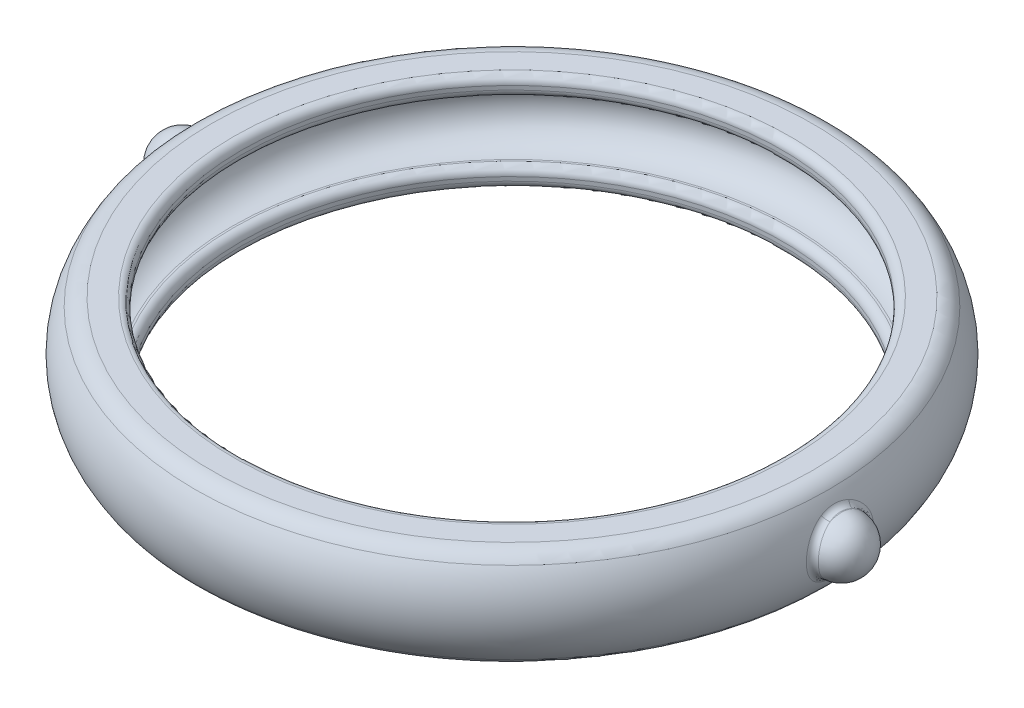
ISO-10303-21;
HEADER;
FILE_DESCRIPTION(('STEP AP214'),'2;1');
FILE_NAME('part.step','',(''),(''),'','','');
FILE_SCHEMA(('AUTOMOTIVE_DESIGN { 1 0 10303 214 1 1 1 1 }'));
ENDSEC;
DATA;
#1=APPLICATION_CONTEXT('core data for automotive mechanical design processes');
#2=APPLICATION_PROTOCOL_DEFINITION('international standard','automotive_design',2000,#1);
#3=PRODUCT_CONTEXT('',#1,'mechanical');
#4=PRODUCT('Part','Part','',(#3));
#5=PRODUCT_RELATED_PRODUCT_CATEGORY('part','',(#4));
#6=PRODUCT_DEFINITION_FORMATION('','',#4);
#7=PRODUCT_DEFINITION_CONTEXT('part definition',#1,'design');
#8=PRODUCT_DEFINITION('design','',#6,#7);
#9=PRODUCT_DEFINITION_SHAPE('','',#8);
#10=(LENGTH_UNIT() NAMED_UNIT(*) SI_UNIT(.MILLI.,.METRE.));
#11=(NAMED_UNIT(*) PLANE_ANGLE_UNIT() SI_UNIT($,.RADIAN.));
#12=(NAMED_UNIT(*) SI_UNIT($,.STERADIAN.) SOLID_ANGLE_UNIT());
#13=UNCERTAINTY_MEASURE_WITH_UNIT(LENGTH_MEASURE(1.E-05),#10,'distance_accuracy_value','');
#14=(GEOMETRIC_REPRESENTATION_CONTEXT(3) GLOBAL_UNCERTAINTY_ASSIGNED_CONTEXT((#13)) GLOBAL_UNIT_ASSIGNED_CONTEXT((#10,
#11,#12)) REPRESENTATION_CONTEXT('',''));
#15=CARTESIAN_POINT('',(0.,0.,0.));
#16=DIRECTION('',(0.,0.,1.));
#17=DIRECTION('',(1.,0.,0.));
#18=AXIS2_PLACEMENT_3D('',#15,#16,#17);
#19=CARTESIAN_POINT('',(-500000.,2.5,0.));
#20=DIRECTION('',(1.,0.,0.));
#21=DIRECTION('',(0.,0.,-1.));
#22=AXIS2_PLACEMENT_3D('',#19,#20,#21);
#23=CYLINDRICAL_SURFACE('',#22,1.4);
#24=CARTESIAN_POINT('',(16.7,2.5,0.));
#25=DIRECTION('',(1.,0.,0.));
#26=DIRECTION('',(0.,0.,-1.));
#27=AXIS2_PLACEMENT_3D('',#24,#25,#26);
#28=CIRCLE('',#27,1.4);
#29=CARTESIAN_POINT('',(16.7,1.22296059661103,0.573733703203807));
#30=VERTEX_POINT('',#29);
#31=CARTESIAN_POINT('',(16.7,1.22296059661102,-0.573733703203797));
#32=VERTEX_POINT('',#31);
#33=EDGE_CURVE('E126',#30,#32,#28,.T.);
#34=ORIENTED_EDGE('',*,*,#33,.F.);
#35=CARTESIAN_POINT('',(16.6990059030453,1.22064669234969,-0.568555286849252));
#36=CARTESIAN_POINT('',(16.4676020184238,1.23377820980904,-0.598103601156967));
#37=CARTESIAN_POINT('',(16.3788698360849,1.04161769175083,-0.697069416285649));
#38=CARTESIAN_POINT('',(16.7120605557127,1.25100235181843,-0.636862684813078));
#39=CARTESIAN_POINT('',(16.4774202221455,1.26725563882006,-0.669167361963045));
#40=CARTESIAN_POINT('',(16.3905268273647,1.07622123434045,-0.780767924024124));
#41=CARTESIAN_POINT('',(16.726874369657,1.28675550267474,-0.702547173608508));
#42=CARTESIAN_POINT('',(16.4884215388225,1.30634609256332,-0.736550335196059));
#43=CARTESIAN_POINT('',(16.4037540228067,1.11697757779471,-0.861226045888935));
#44=CARTESIAN_POINT('',(16.7583905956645,1.36814551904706,-0.82732563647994));
#45=CARTESIAN_POINT('',(16.5113914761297,1.39400640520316,-0.862944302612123));
#46=CARTESIAN_POINT('',(16.4318928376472,1.20975707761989,-1.01401532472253));
#47=CARTESIAN_POINT('',(16.7750967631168,1.41380220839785,-0.886406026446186));
#48=CARTESIAN_POINT('',(16.5233952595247,1.44279517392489,-0.921948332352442));
#49=CARTESIAN_POINT('',(16.4468078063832,1.26180283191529,-1.08632973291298));
#50=CARTESIAN_POINT('',(16.8096871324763,1.51692712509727,-0.999896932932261));
#51=CARTESIAN_POINT('',(16.5477441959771,1.55118665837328,-1.03369142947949));
#52=CARTESIAN_POINT('',(16.4776874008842,1.37935875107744,-1.22519225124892));
#53=CARTESIAN_POINT('',(16.8275815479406,1.57494215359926,-1.05380995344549));
#54=CARTESIAN_POINT('',(16.5600576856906,1.61137892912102,-1.08566964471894));
#55=CARTESIAN_POINT('',(16.4936610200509,1.44549223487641,-1.29112838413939));
#56=CARTESIAN_POINT('',(16.8615988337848,1.69931631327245,-1.15114269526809));
#57=CARTESIAN_POINT('',(16.5829372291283,1.73796792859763,-1.1780017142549));
#58=CARTESIAN_POINT('',(16.5240249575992,1.58727095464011,-1.41012589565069));
#59=CARTESIAN_POINT('',(16.8777248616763,1.76566010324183,-1.19458129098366));
#60=CARTESIAN_POINT('',(16.5934692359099,1.80438743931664,-1.21815734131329));
#61=CARTESIAN_POINT('',(16.5384180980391,1.66289870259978,-1.46321043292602));
#62=CARTESIAN_POINT('',(16.9066622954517,1.9056124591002,-1.27006547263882));
#63=CARTESIAN_POINT('',(16.6119920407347,1.9419974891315,-1.28694738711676));
#64=CARTESIAN_POINT('',(16.5642446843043,1.82243558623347,-1.55543137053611));
#65=CARTESIAN_POINT('',(16.9194493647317,1.97926924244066,-1.30202801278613));
#66=CARTESIAN_POINT('',(16.6199012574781,2.01307660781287,-1.31523524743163));
#67=CARTESIAN_POINT('',(16.5756563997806,1.90639968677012,-1.59446610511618));
#68=CARTESIAN_POINT('',(16.9401811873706,2.1313524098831,-1.35296843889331));
#69=CARTESIAN_POINT('',(16.6325628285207,2.15782214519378,-1.35993393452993));
#70=CARTESIAN_POINT('',(16.5941577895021,2.07976493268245,-1.65666723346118));
#71=CARTESIAN_POINT('',(16.9481276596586,2.20977708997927,-1.37195093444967));
#72=CARTESIAN_POINT('',(16.6372557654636,2.23118806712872,-1.37612782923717));
#73=CARTESIAN_POINT('',(16.6012489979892,2.1691641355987,-1.67983926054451));
#74=CARTESIAN_POINT('',(16.9580762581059,2.3652143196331,-1.39560787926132));
#75=CARTESIAN_POINT('',(16.6431297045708,2.37574470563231,-1.39633079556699));
#76=CARTESIAN_POINT('',(16.6101267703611,2.34635280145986,-1.70871597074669));
#77=CARTESIAN_POINT('',(16.9603396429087,2.44212065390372,-1.40091149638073));
#78=CARTESIAN_POINT('',(16.6444351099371,2.44652571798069,-1.40077210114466));
#79=CARTESIAN_POINT('',(16.6121464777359,2.43402118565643,-1.71518874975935));
#80=CARTESIAN_POINT('',(16.9594574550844,2.59573390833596,-1.39883260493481));
#81=CARTESIAN_POINT('',(16.6439196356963,2.58840036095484,-1.39901156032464));
#82=CARTESIAN_POINT('',(16.6113592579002,2.60913063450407,-1.71265141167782));
#83=CARTESIAN_POINT('',(16.9563127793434,2.67244085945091,-1.39145219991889));
#84=CARTESIAN_POINT('',(16.6421020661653,2.65910685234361,-1.39282099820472));
#85=CARTESIAN_POINT('',(16.6085531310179,2.69657173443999,-1.70364386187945));
#86=CARTESIAN_POINT('',(16.9450939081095,2.8212673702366,-1.36467851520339));
#87=CARTESIAN_POINT('',(16.6354500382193,2.79790897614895,-1.36987706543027));
#88=CARTESIAN_POINT('',(16.5985417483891,2.86622459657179,-1.67096146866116));
#89=CARTESIAN_POINT('',(16.9371587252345,2.89345514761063,-1.34562378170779));
#90=CARTESIAN_POINT('',(16.6307329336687,2.86568929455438,-1.35353357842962));
#91=CARTESIAN_POINT('',(16.5914605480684,2.94851412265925,-1.64769997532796));
#92=CARTESIAN_POINT('',(16.9172271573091,3.03357474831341,-1.29646167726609));
#93=CARTESIAN_POINT('',(16.6185188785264,2.99937221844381,-1.31027716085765));
#94=CARTESIAN_POINT('',(16.5736732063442,3.10824165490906,-1.58766803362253));
#95=CARTESIAN_POINT('',(16.9052302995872,3.10150607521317,-1.26635301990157));
#96=CARTESIAN_POINT('',(16.6110706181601,3.06504654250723,-1.28354350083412));
#97=CARTESIAN_POINT('',(16.5629666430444,3.1856790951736,-1.55089601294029));
#98=CARTESIAN_POINT('',(16.8779217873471,3.23318365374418,-1.19507078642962));
#99=CARTESIAN_POINT('',(16.5935864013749,3.19453553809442,-1.21857353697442));
#100=CARTESIAN_POINT('',(16.5385938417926,3.33578325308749,-1.46380821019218));
#101=CARTESIAN_POINT('',(16.8625312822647,3.29677293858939,-1.15362713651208));
#102=CARTESIAN_POINT('',(16.5835373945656,3.25816406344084,-1.18026335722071));
#103=CARTESIAN_POINT('',(16.524857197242,3.40827103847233,-1.41316179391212));
#104=CARTESIAN_POINT('',(16.8300756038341,3.4163918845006,-1.06111129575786));
#105=CARTESIAN_POINT('',(16.5617447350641,3.37977290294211,-1.09262010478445));
#106=CARTESIAN_POINT('',(16.4958872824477,3.54462911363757,-1.30005627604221));
#107=CARTESIAN_POINT('',(16.8130070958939,3.47240594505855,-1.01001973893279));
#108=CARTESIAN_POINT('',(16.5500312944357,3.43776757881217,-1.04345949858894));
#109=CARTESIAN_POINT('',(16.480651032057,3.60848161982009,-1.23757341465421));
#110=CARTESIAN_POINT('',(16.7780743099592,3.57796091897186,-0.896812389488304));
#111=CARTESIAN_POINT('',(16.5255356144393,3.54838516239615,-0.932363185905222));
#112=CARTESIAN_POINT('',(16.4494660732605,3.72880765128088,-1.09906635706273));
#113=CARTESIAN_POINT('',(16.7602111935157,3.62706160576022,-0.834284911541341));
#114=CARTESIAN_POINT('',(16.5127212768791,3.60081185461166,-0.870016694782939));
#115=CARTESIAN_POINT('',(16.4335183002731,3.7847793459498,-1.02253584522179));
#116=CARTESIAN_POINT('',(16.7265997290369,3.71404095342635,-0.701696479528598));
#117=CARTESIAN_POINT('',(16.4882377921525,3.6944559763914,-0.735768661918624));
#118=CARTESIAN_POINT('',(16.4035088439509,3.88393033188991,-0.860185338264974));
#119=CARTESIAN_POINT('',(16.7108473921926,3.75194094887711,-0.631650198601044));
#120=CARTESIAN_POINT('',(16.4765270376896,3.73593455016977,-0.66387549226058));
#121=CARTESIAN_POINT('',(16.3894436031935,3.92713394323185,-0.774383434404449));
#122=CARTESIAN_POINT('',(16.683409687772,3.81547745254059,-0.485651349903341));
#123=CARTESIAN_POINT('',(16.4559710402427,3.80571426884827,-0.512594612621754));
#124=CARTESIAN_POINT('',(16.3649433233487,3.99956156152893,-0.595482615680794));
#125=CARTESIAN_POINT('',(16.6717264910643,3.84110741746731,-0.409695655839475));
#126=CARTESIAN_POINT('',(16.4470639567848,3.83425875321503,-0.433028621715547));
#127=CARTESIAN_POINT('',(16.3545102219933,4.02877810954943,-0.502379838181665));
#128=CARTESIAN_POINT('',(16.6541150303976,3.87906371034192,-0.254133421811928));
#129=CARTESIAN_POINT('',(16.4336272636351,3.87648680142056,-0.269393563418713));
#130=CARTESIAN_POINT('',(16.3387827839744,4.07204589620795,-0.311656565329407));
#131=CARTESIAN_POINT('',(16.6481834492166,3.89139770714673,-0.174529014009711));
#132=CARTESIAN_POINT('',(16.4290388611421,3.89036278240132,-0.185009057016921));
#133=CARTESIAN_POINT('',(16.3334854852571,4.0861058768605,-0.214038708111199));
#134=CARTESIAN_POINT('',(16.6431368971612,3.90190782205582,-0.0190343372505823));
#135=CARTESIAN_POINT('',(16.4251542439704,3.90213039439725,-0.0202789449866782));
#136=CARTESIAN_POINT('',(16.3289785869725,4.09808674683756,-0.0233450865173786));
#137=CARTESIAN_POINT('',(16.6436368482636,3.90088368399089,0.0567946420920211));
#138=CARTESIAN_POINT('',(16.4255425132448,3.90097500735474,0.0603432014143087));
#139=CARTESIAN_POINT('',(16.329425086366,4.09691929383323,0.0696547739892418));
#140=CARTESIAN_POINT('',(16.6504500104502,3.88665065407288,0.207122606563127));
#141=CARTESIAN_POINT('',(16.4307821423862,3.88505040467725,0.219500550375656));
#142=CARTESIAN_POINT('',(16.3355096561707,4.08069453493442,0.254007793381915));
#143=CARTESIAN_POINT('',(16.6567630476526,3.87344212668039,0.281621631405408));
#144=CARTESIAN_POINT('',(16.4356552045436,3.87021511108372,0.298362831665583));
#145=CARTESIAN_POINT('',(16.3411475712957,4.06563764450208,0.345361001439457));
#146=CARTESIAN_POINT('',(16.6742132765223,3.83563650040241,0.426117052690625));
#147=CARTESIAN_POINT('',(16.4489513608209,3.82819524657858,0.450183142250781));
#148=CARTESIAN_POINT('',(16.3567309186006,4.02254160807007,0.522508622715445));
#149=CARTESIAN_POINT('',(16.685280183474,3.81120497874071,0.496162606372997));
#150=CARTESIAN_POINT('',(16.4573699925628,3.80103381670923,0.523461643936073));
#151=CARTESIAN_POINT('',(16.3666135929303,3.99469120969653,0.608363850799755));
#152=CARTESIAN_POINT('',(16.7108986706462,3.75175902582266,0.63131934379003));
#153=CARTESIAN_POINT('',(16.4765541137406,3.7357688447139,0.663449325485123));
#154=CARTESIAN_POINT('',(16.3894893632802,3.92692656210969,0.773976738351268));
#155=CARTESIAN_POINT('',(16.7254574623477,3.71672265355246,0.696419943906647));
#156=CARTESIAN_POINT('',(16.4873746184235,3.69744306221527,0.730278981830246));
#157=CARTESIAN_POINT('',(16.4024888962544,3.88698730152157,0.853721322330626));
#158=CARTESIAN_POINT('',(16.7577285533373,3.6337403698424,0.825210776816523));
#159=CARTESIAN_POINT('',(16.5109299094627,3.60795807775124,0.86091159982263));
#160=CARTESIAN_POINT('',(16.4313018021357,3.79239271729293,1.01142769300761));
#161=CARTESIAN_POINT('',(16.7756017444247,3.58496960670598,0.888344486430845));
#162=CARTESIAN_POINT('',(16.5237767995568,3.5558127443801,0.923961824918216));
#163=CARTESIAN_POINT('',(16.4472586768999,3.73679711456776,1.08870323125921));
#164=CARTESIAN_POINT('',(16.8114381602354,3.47754953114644,1.00533310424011));
#165=CARTESIAN_POINT('',(16.5489613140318,3.4430552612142,1.03898410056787));
#166=CARTESIAN_POINT('',(16.4792505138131,3.6143449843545,1.23184186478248));
#167=CARTESIAN_POINT('',(16.8294011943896,3.4189162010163,1.05920274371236));
#168=CARTESIAN_POINT('',(16.5613009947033,3.38228925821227,1.09084774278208));
#169=CARTESIAN_POINT('',(16.4952853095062,3.54750667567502,1.29772307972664));
#170=CARTESIAN_POINT('',(16.8635341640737,3.2930376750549,1.15647185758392));
#171=CARTESIAN_POINT('',(16.5842181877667,3.25432385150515,1.18298875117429));
#172=CARTESIAN_POINT('',(16.5257523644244,3.40401307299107,1.41663950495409));
#173=CARTESIAN_POINT('',(16.8797007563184,3.22577690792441,1.1998519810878));
#174=CARTESIAN_POINT('',(16.5947524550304,3.18708692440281,1.22301507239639));
#175=CARTESIAN_POINT('',(16.5401816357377,3.32734002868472,1.46965097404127));
#176=CARTESIAN_POINT('',(16.9084785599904,3.08446870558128,1.27466947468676));
#177=CARTESIAN_POINT('',(16.6131313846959,3.04836705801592,1.29107203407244));
#178=CARTESIAN_POINT('',(16.5658656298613,3.16625756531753,1.56105480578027));
#179=CARTESIAN_POINT('',(16.9210908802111,3.01042339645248,1.30611057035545));
#180=CARTESIAN_POINT('',(16.6209137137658,2.97702963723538,1.31884489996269));
#181=CARTESIAN_POINT('',(16.5771213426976,3.08185056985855,1.59945172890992));
#182=CARTESIAN_POINT('',(16.9411648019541,2.85948435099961,1.35532969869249));
#183=CARTESIAN_POINT('',(16.6331475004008,2.83358090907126,1.36195843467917));
#184=CARTESIAN_POINT('',(16.5950355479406,2.90978955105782,1.65954978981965));
#185=CARTESIAN_POINT('',(16.9487432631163,2.78270234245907,1.37341889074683));
#186=CARTESIAN_POINT('',(16.6376195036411,2.76180295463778,1.37738151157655));
#187=CARTESIAN_POINT('',(16.6017983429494,2.82226289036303,1.68163116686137));
#188=CARTESIAN_POINT('',(16.9584312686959,2.6269798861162,1.39644761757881));
#189=CARTESIAN_POINT('',(16.6433380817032,2.61702108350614,1.39704489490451));
#190=CARTESIAN_POINT('',(16.610443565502,2.64474908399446,1.70974093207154));
#191=CARTESIAN_POINT('',(16.9605423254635,2.54804004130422,1.40139078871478));
#192=CARTESIAN_POINT('',(16.6445543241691,2.54440548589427,1.40118048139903));
#193=CARTESIAN_POINT('',(16.6123273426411,2.55476262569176,1.7157737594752));
#194=CARTESIAN_POINT('',(16.9591105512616,2.39409070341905,1.39801338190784));
#195=CARTESIAN_POINT('',(16.6437163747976,2.40220412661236,1.39831598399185));
#196=CARTESIAN_POINT('',(16.6110496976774,2.37927006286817,1.71165150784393));
#197=CARTESIAN_POINT('',(16.9558206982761,2.3190658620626,1.39028629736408));
#198=CARTESIAN_POINT('',(16.6418126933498,2.33300481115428,1.39182842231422));
#199=CARTESIAN_POINT('',(16.6081140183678,2.29374646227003,1.70222076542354));
#200=CARTESIAN_POINT('',(16.9443830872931,2.17146072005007,1.36297301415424));
#201=CARTESIAN_POINT('',(16.6350269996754,2.19527876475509,1.36841169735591));
#202=CARTESIAN_POINT('',(16.5979074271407,2.12548588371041,1.66887946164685));
#203=CARTESIAN_POINT('',(16.9362353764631,2.09888039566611,1.34338693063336));
#204=CARTESIAN_POINT('',(16.6301779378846,2.12707468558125,1.35159716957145));
#205=CARTESIAN_POINT('',(16.5906365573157,2.04274887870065,1.64496904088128));
#206=CARTESIAN_POINT('',(16.9158467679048,1.95803783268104,1.29301151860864));
#207=CARTESIAN_POINT('',(16.6176641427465,1.99255971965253,1.30721743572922));
#208=CARTESIAN_POINT('',(16.5724412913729,1.88219721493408,1.58345449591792));
#209=CARTESIAN_POINT('',(16.903601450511,1.88978035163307,1.26221009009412));
#210=CARTESIAN_POINT('',(16.6100468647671,1.92647957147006,1.27982717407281));
#211=CARTESIAN_POINT('',(16.5615129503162,1.80438797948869,1.54583558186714));
#212=CARTESIAN_POINT('',(16.8761612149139,1.75931426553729,1.19035074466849));
#213=CARTESIAN_POINT('',(16.5924387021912,1.7979729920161,1.21420908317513));
#214=CARTESIAN_POINT('',(16.5370224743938,1.65566484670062,1.45804030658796));
#215=CARTESIAN_POINT('',(16.8609655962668,1.6971071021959,1.14929039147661));
#216=CARTESIAN_POINT('',(16.5824973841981,1.73565020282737,1.17619047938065));
#217=CARTESIAN_POINT('',(16.5234597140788,1.58475259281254,1.40786096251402));
#218=CARTESIAN_POINT('',(16.8282968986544,1.57744928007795,1.05589799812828));
#219=CARTESIAN_POINT('',(16.5605395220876,1.61392847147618,1.08765055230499));
#220=CARTESIAN_POINT('',(16.4942995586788,1.44835020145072,1.293681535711));
#221=CARTESIAN_POINT('',(16.8107514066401,1.5203467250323,1.00313601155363));
#222=CARTESIAN_POINT('',(16.5484764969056,1.55472399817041,1.03681222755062));
#223=CARTESIAN_POINT('',(16.4786374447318,1.38325688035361,1.22915392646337));
#224=CARTESIAN_POINT('',(16.7757839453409,1.41562250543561,0.888893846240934));
#225=CARTESIAN_POINT('',(16.5238980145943,1.4447801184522,0.9244731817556));
#226=CARTESIAN_POINT('',(16.4474213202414,1.26387785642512,1.08937512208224));
#227=CARTESIAN_POINT('',(16.7583619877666,1.36800172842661,0.827412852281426));
#228=CARTESIAN_POINT('',(16.5113813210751,1.39388599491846,0.86308905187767));
#229=CARTESIAN_POINT('',(16.4318673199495,1.2095931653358,1.0141229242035));
#230=CARTESIAN_POINT('',(16.7250567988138,1.28213681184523,0.695136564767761));
#231=CARTESIAN_POINT('',(16.4871023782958,1.3013984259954,0.729080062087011));
#232=CARTESIAN_POINT('',(16.4021312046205,1.11171256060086,0.852151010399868));
#233=CARTESIAN_POINT('',(16.7092378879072,1.24422853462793,0.624111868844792));
#234=CARTESIAN_POINT('',(16.4753291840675,1.25987707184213,0.656122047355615));
#235=CARTESIAN_POINT('',(16.3880064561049,1.06849950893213,0.765148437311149));
#236=CARTESIAN_POINT('',(16.6818442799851,1.18101479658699,0.47617359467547));
#237=CARTESIAN_POINT('',(16.4547884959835,1.19040901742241,0.502718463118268));
#238=CARTESIAN_POINT('',(16.3635454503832,0.996439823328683,0.583866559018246));
#239=CARTESIAN_POINT('',(16.6702678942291,1.15570431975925,0.39926237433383));
#240=CARTESIAN_POINT('',(16.4459542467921,1.16220052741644,0.422090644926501));
#241=CARTESIAN_POINT('',(16.3532076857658,0.967587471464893,0.489590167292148));
#242=CARTESIAN_POINT('',(16.6533702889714,1.11938216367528,0.244830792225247));
#243=CARTESIAN_POINT('',(16.4330515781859,1.12176498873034,0.259541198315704));
#244=CARTESIAN_POINT('',(16.3381176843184,0.92618249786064,0.300249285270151));
#245=CARTESIAN_POINT('',(16.647826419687,1.10785983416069,0.167446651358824));
#246=CARTESIAN_POINT('',(16.4287633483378,1.10880384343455,0.17750317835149));
#247=CARTESIAN_POINT('',(16.333166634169,0.913047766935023,0.205353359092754));
#248=CARTESIAN_POINT('',(16.6430350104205,1.09787886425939,0.0117286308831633));
#249=CARTESIAN_POINT('',(16.4250761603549,1.09763190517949,0.012534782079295));
#250=CARTESIAN_POINT('',(16.3288875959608,0.901670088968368,0.0143853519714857));
#251=CARTESIAN_POINT('',(16.6437852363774,1.09941558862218,-0.0666049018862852));
#252=CARTESIAN_POINT('',(16.4256588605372,1.09936566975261,-0.0707632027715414));
#253=CARTESIAN_POINT('',(16.3295576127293,0.903421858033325,-0.0816862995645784));
#254=CARTESIAN_POINT('',(16.6512534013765,1.11503886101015,-0.217565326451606));
#255=CARTESIAN_POINT('',(16.4313991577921,1.11683810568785,-0.230541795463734));
#256=CARTESIAN_POINT('',(16.3362271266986,0.921231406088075,-0.266813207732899));
#257=CARTESIAN_POINT('',(16.6576509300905,1.12845171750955,-0.290273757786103));
#258=CARTESIAN_POINT('',(16.4363340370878,1.13189491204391,-0.307472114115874));
#259=CARTESIAN_POINT('',(16.3419404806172,0.936521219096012,-0.355969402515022));
#260=CARTESIAN_POINT('',(16.675138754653,1.16640076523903,-0.432344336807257));
#261=CARTESIAN_POINT('',(16.4496544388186,1.17406486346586,-0.456699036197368));
#262=CARTESIAN_POINT('',(16.3575573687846,0.979780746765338,-0.530141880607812));
#263=CARTESIAN_POINT('',(16.686229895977,1.19093896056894,-0.501705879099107));
#264=CARTESIAN_POINT('',(16.4580863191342,1.2013322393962,-0.529229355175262));
#265=CARTESIAN_POINT('',(16.3674616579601,1.00775274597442,-0.615157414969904));
#266=CARTESIAN_POINT('',(16.6990059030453,1.22064669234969,-0.568555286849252));
#267=CARTESIAN_POINT('',(16.4676020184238,1.23377820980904,-0.598103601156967));
#268=CARTESIAN_POINT('',(16.3788698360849,1.04161769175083,-0.697069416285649));
#269=(BOUNDED_SURFACE() B_SPLINE_SURFACE(3,2,((#35,#36,#37),(#38,#39,#40),(#41,#42,#43),(#44,
#45,#46),(#47,#48,#49),(#50,#51,#52),(#53,#54,#55),(#56,#57,#58),(#59,#60,#61),(#62,#63,#64),
(#65,#66,#67),(#68,#69,#70),(#71,#72,#73),(#74,#75,#76),(#77,#78,#79),(#80,#81,#82),(#83,#84,
#85),(#86,#87,#88),(#89,#90,#91),(#92,#93,#94),(#95,#96,#97),(#98,#99,#100),(#101,#102,#103),
(#104,#105,#106),(#107,#108,#109),(#110,#111,#112),(#113,#114,#115),(#116,#117,#118),(#119,#120,
#121),(#122,#123,#124),(#125,#126,#127),(#128,#129,#130),(#131,#132,#133),(#134,#135,#136),
(#137,#138,#139),(#140,#141,#142),(#143,#144,#145),(#146,#147,#148),(#149,#150,#151),(#152,#153,
#154),(#155,#156,#157),(#158,#159,#160),(#161,#162,#163),(#164,#165,#166),(#167,#168,#169),
(#170,#171,#172),(#173,#174,#175),(#176,#177,#178),(#179,#180,#181),(#182,#183,#184),(#185,#186,
#187),(#188,#189,#190),(#191,#192,#193),(#194,#195,#196),(#197,#198,#199),(#200,#201,#202),
(#203,#204,#205),(#206,#207,#208),(#209,#210,#211),(#212,#213,#214),(#215,#216,#217),(#218,#219,
#220),(#221,#222,#223),(#224,#225,#226),(#227,#228,#229),(#230,#231,#232),(#233,#234,#235),
(#236,#237,#238),(#239,#240,#241),(#242,#243,#244),(#245,#246,#247),(#248,#249,#250),(#251,#252,
#253),(#254,#255,#256),(#257,#258,#259),(#260,#261,#262),(#263,#264,#265),(#266,#267,#268)),
.UNSPECIFIED.,.T.,.F.,.F.) B_SPLINE_SURFACE_WITH_KNOTS((4,2,2,2,2,2,2,2,2,2,2,2,2,2,2,2,2,2,2,2,
2,2,2,2,2,2,2,2,2,2,2,2,2,2,2,2,2,2,4),(3,3),(0.,0.282722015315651,0.566015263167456,
0.866417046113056,1.16627340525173,1.46825788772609,1.77013507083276,2.05785723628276,
2.34553168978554,2.62523462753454,2.9049701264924,3.19205949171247,3.47973137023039,
3.78122264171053,4.08213588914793,4.38320942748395,4.68410921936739,4.96708139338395,
5.25004510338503,5.52896196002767,5.808459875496,6.1109490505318,6.41295268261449,
6.71550926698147,7.01797136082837,7.31314061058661,7.60822820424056,7.88988409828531,
8.17153725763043,8.45349519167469,8.73552014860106,9.03045557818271,9.32541860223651,
9.62951167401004,9.93348356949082,10.2258100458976,10.5180327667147,10.7946703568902,
11.0713577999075),(0.,1.),
.UNSPECIFIED.) GEOMETRIC_REPRESENTATION_ITEM() RATIONAL_B_SPLINE_SURFACE(((1.,0.83170053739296,
1.),(1.,0.827615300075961,1.),(1.,0.822927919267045,1.),(1.,0.81278556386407,1.),(1.,
0.807329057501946,1.),(1.,0.7958304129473,1.),(1.,0.789772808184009,1.),(1.,0.778054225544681,
1.),(1.,0.772392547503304,1.),(1.,0.762087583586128,1.),(1.,0.757451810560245,1.),(1.,
0.749866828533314,1.),(1.,0.746917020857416,1.),(1.,0.743214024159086,1.),(1.,0.742364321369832,
1.),(1.,0.742694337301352,1.),(1.,0.743873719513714,1.),(1.,0.748041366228,1.),(1.,
0.750978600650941,1.),(1.,0.758257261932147,1.),(1.,0.762598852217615,1.),(1.,0.772321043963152,
1.),(1.,0.777725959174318,1.),(1.,0.788919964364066,1.),(1.,0.794709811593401,1.),(1.,
0.806353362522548,1.),(1.,0.812196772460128,1.),(1.,0.82301908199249,1.),(1.,0.827999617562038,
1.),(1.,0.836575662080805,1.),(1.,0.840170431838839,1.),(1.,0.845558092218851,1.),(1.,
0.847352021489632,1.),(1.,0.8488790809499,1.),(1.,0.848728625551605,1.),(1.,0.846664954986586,
1.),(1.,0.844751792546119,1.),(1.,0.839404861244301,1.),(1.,0.835993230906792,1.),(1.,
0.827981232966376,1.),(1.,0.82337840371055,1.),(1.,0.81300393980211,1.),(1.,0.807167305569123,
1.),(1.,0.795241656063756,1.),(1.,0.789153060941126,1.),(1.,0.7773795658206,1.),(1.,
0.771695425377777,1.),(1.,0.761433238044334,1.),(1.,0.75685484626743,1.),(1.,0.74950277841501,
1.),(1.,0.74668824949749,1.),(1.,0.743081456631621,1.),(1.,0.742288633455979,1.),(1.,
0.742823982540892,1.),(1.,0.744057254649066,1.),(1.,0.748304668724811,1.),(1.,0.751318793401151,
1.),(1.,0.758758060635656,1.),(1.,0.763184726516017,1.),(1.,0.772941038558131,1.),(1.,
0.778270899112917,1.),(1.,0.789527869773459,1.),(1.,0.795471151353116,1.),(1.,0.807105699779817,
1.),(1.,0.812796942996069,1.),(1.,0.823510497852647,1.),(1.,0.828506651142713,1.),(1.,
0.837060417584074,1.),(1.,0.840618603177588,1.),(1.,0.84578363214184,1.),(1.,0.847460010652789,
1.),(1.,0.848909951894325,1.),(1.,0.848684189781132,1.),(1.,0.846421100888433,1.),(1.,
0.844481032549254,1.),(1.,0.839119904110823,1.),(1.,0.835698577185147,1.),(1.,0.83170053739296,1.))) REPRESENTATION_ITEM('') SURFACE());
#270=CARTESIAN_POINT('',(16.6990059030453,1.22064669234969,-0.568555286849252));
#271=CARTESIAN_POINT('',(16.7120605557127,1.25100235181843,-0.636862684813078));
#272=CARTESIAN_POINT('',(16.726874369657,1.28675550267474,-0.702547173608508));
#273=CARTESIAN_POINT('',(16.7583905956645,1.36814551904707,-0.82732563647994));
#274=CARTESIAN_POINT('',(16.7750967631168,1.41380220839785,-0.886406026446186));
#275=CARTESIAN_POINT('',(16.8096871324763,1.51692712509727,-0.999896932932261));
#276=CARTESIAN_POINT('',(16.8275815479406,1.57494215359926,-1.05380995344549));
#277=CARTESIAN_POINT('',(16.8615988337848,1.69931631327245,-1.15114269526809));
#278=CARTESIAN_POINT('',(16.8777248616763,1.76566010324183,-1.19458129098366));
#279=CARTESIAN_POINT('',(16.9066622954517,1.9056124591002,-1.27006547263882));
#280=CARTESIAN_POINT('',(16.9194493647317,1.97926924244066,-1.30202801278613));
#281=CARTESIAN_POINT('',(16.9401811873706,2.1313524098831,-1.35296843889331));
#282=CARTESIAN_POINT('',(16.9481276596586,2.20977708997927,-1.37195093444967));
#283=CARTESIAN_POINT('',(16.9580762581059,2.3652143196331,-1.39560787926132));
#284=CARTESIAN_POINT('',(16.9603396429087,2.44212065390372,-1.40091149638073));
#285=CARTESIAN_POINT('',(16.9594574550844,2.59573390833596,-1.39883260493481));
#286=CARTESIAN_POINT('',(16.9563127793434,2.67244085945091,-1.39145219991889));
#287=CARTESIAN_POINT('',(16.9450939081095,2.8212673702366,-1.36467851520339));
#288=CARTESIAN_POINT('',(16.9371587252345,2.89345514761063,-1.34562378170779));
#289=CARTESIAN_POINT('',(16.9172271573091,3.03357474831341,-1.29646167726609));
#290=CARTESIAN_POINT('',(16.9052302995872,3.10150607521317,-1.26635301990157));
#291=CARTESIAN_POINT('',(16.8779217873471,3.23318365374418,-1.19507078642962));
#292=CARTESIAN_POINT('',(16.8625312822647,3.29677293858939,-1.15362713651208));
#293=CARTESIAN_POINT('',(16.8300756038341,3.4163918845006,-1.06111129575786));
#294=CARTESIAN_POINT('',(16.8130070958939,3.47240594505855,-1.01001973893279));
#295=CARTESIAN_POINT('',(16.7780743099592,3.57796091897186,-0.896812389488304));
#296=CARTESIAN_POINT('',(16.7602111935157,3.62706160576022,-0.834284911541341));
#297=CARTESIAN_POINT('',(16.7265997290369,3.71404095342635,-0.701696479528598));
#298=CARTESIAN_POINT('',(16.7108473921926,3.75194094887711,-0.631650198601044));
#299=CARTESIAN_POINT('',(16.683409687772,3.81547745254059,-0.485651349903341));
#300=CARTESIAN_POINT('',(16.6717264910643,3.84110741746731,-0.409695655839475));
#301=CARTESIAN_POINT('',(16.6541150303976,3.87906371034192,-0.254133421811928));
#302=CARTESIAN_POINT('',(16.6481834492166,3.89139770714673,-0.174529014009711));
#303=CARTESIAN_POINT('',(16.6431368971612,3.90190782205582,-0.0190343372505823));
#304=CARTESIAN_POINT('',(16.6436368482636,3.90088368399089,0.0567946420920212));
#305=CARTESIAN_POINT('',(16.6504500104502,3.88665065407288,0.207122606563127));
#306=CARTESIAN_POINT('',(16.6567630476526,3.87344212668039,0.281621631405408));
#307=CARTESIAN_POINT('',(16.6742132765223,3.83563650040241,0.426117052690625));
#308=CARTESIAN_POINT('',(16.685280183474,3.81120497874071,0.496162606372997));
#309=CARTESIAN_POINT('',(16.7108986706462,3.75175902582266,0.63131934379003));
#310=CARTESIAN_POINT('',(16.7254574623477,3.71672265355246,0.696419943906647));
#311=CARTESIAN_POINT('',(16.7577285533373,3.6337403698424,0.825210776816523));
#312=CARTESIAN_POINT('',(16.7756017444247,3.58496960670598,0.888344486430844));
#313=CARTESIAN_POINT('',(16.8114381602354,3.47754953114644,1.00533310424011));
#314=CARTESIAN_POINT('',(16.8294011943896,3.4189162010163,1.05920274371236));
#315=CARTESIAN_POINT('',(16.8635341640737,3.2930376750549,1.15647185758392));
#316=CARTESIAN_POINT('',(16.8797007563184,3.22577690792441,1.1998519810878));
#317=CARTESIAN_POINT('',(16.9084785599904,3.08446870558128,1.27466947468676));
#318=CARTESIAN_POINT('',(16.9210908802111,3.01042339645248,1.30611057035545));
#319=CARTESIAN_POINT('',(16.9411648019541,2.85948435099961,1.35532969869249));
#320=CARTESIAN_POINT('',(16.9487432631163,2.78270234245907,1.37341889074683));
#321=CARTESIAN_POINT('',(16.9584312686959,2.6269798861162,1.39644761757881));
#322=CARTESIAN_POINT('',(16.9605423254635,2.54804004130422,1.40139078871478));
#323=CARTESIAN_POINT('',(16.9591105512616,2.39409070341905,1.39801338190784));
#324=CARTESIAN_POINT('',(16.9558206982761,2.3190658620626,1.39028629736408));
#325=CARTESIAN_POINT('',(16.9443830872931,2.17146072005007,1.36297301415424));
#326=CARTESIAN_POINT('',(16.9362353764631,2.09888039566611,1.34338693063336));
#327=CARTESIAN_POINT('',(16.9158467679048,1.95803783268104,1.29301151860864));
#328=CARTESIAN_POINT('',(16.903601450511,1.88978035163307,1.26221009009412));
#329=CARTESIAN_POINT('',(16.8761612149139,1.75931426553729,1.19035074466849));
#330=CARTESIAN_POINT('',(16.8609655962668,1.6971071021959,1.14929039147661));
#331=CARTESIAN_POINT('',(16.8282968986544,1.57744928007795,1.05589799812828));
#332=CARTESIAN_POINT('',(16.8107514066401,1.5203467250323,1.00313601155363));
#333=CARTESIAN_POINT('',(16.7757839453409,1.41562250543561,0.888893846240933));
#334=CARTESIAN_POINT('',(16.7583619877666,1.36800172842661,0.827412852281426));
#335=CARTESIAN_POINT('',(16.7250567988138,1.28213681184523,0.695136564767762));
#336=CARTESIAN_POINT('',(16.7092378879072,1.24422853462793,0.624111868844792));
#337=CARTESIAN_POINT('',(16.6818442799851,1.18101479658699,0.47617359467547));
#338=CARTESIAN_POINT('',(16.6702678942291,1.15570431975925,0.39926237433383));
#339=CARTESIAN_POINT('',(16.6533702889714,1.11938216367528,0.244830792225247));
#340=CARTESIAN_POINT('',(16.647826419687,1.10785983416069,0.167446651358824));
#341=CARTESIAN_POINT('',(16.6430350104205,1.09787886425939,0.0117286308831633));
#342=CARTESIAN_POINT('',(16.6437852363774,1.09941558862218,-0.0666049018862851));
#343=CARTESIAN_POINT('',(16.6512534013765,1.11503886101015,-0.217565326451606));
#344=CARTESIAN_POINT('',(16.6576509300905,1.12845171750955,-0.290273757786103));
#345=CARTESIAN_POINT('',(16.675138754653,1.16640076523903,-0.432344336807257));
#346=CARTESIAN_POINT('',(16.686229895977,1.19093896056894,-0.501705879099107));
#347=CARTESIAN_POINT('',(16.6990059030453,1.22064669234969,-0.568555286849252));
#348=B_SPLINE_CURVE_WITH_KNOTS('',3,(#270,#271,#272,#273,#274,#275,#276,#277,#278,#279,#280,
#281,#282,#283,#284,#285,#286,#287,#288,#289,#290,#291,#292,#293,#294,#295,#296,#297,#298,#299,
#300,#301,#302,#303,#304,#305,#306,#307,#308,#309,#310,#311,#312,#313,#314,#315,#316,#317,#318,
#319,#320,#321,#322,#323,#324,#325,#326,#327,#328,#329,#330,#331,#332,#333,#334,#335,#336,#337,
#338,#339,#340,#341,#342,#343,#344,#345,#346,#347),.UNSPECIFIED.,.T.,.F.,(4,2,2,2,2,2,2,2,2,2,2,
2,2,2,2,2,2,2,2,2,2,2,2,2,2,2,2,2,2,2,2,2,2,2,2,2,2,2,4),(0.,0.282722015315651,
0.566015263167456,0.866417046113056,1.16627340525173,1.46825788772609,1.77013507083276,
2.05785723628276,2.34553168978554,2.62523462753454,2.9049701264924,3.19205949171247,
3.47973137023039,3.78122264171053,4.08213588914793,4.38320942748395,4.68410921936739,
4.96708139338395,5.25004510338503,5.52896196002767,5.808459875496,6.1109490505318,
6.41295268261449,6.71550926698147,7.01797136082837,7.31314061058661,7.60822820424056,
7.88988409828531,8.17153725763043,8.45349519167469,8.73552014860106,9.03045557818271,
9.32541860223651,9.62951167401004,9.93348356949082,10.2258100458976,10.5180327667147,
10.7946703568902,11.0713577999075),.UNSPECIFIED.);
#349=EDGE_CURVE('E11',#30,#32,#348,.T.);
#350=ORIENTED_EDGE('',*,*,#349,.T.);
#351=EDGE_LOOP('',(#34,#350));
#352=FACE_BOUND('',#351,.T.);
#353=ADVANCED_FACE('F37',(#352),#23,.T.);
#354=CARTESIAN_POINT('',(500000.,2.5,0.));
#355=DIRECTION('',(-1.,0.,0.));
#356=DIRECTION('',(0.,0.,1.));
#357=AXIS2_PLACEMENT_3D('',#354,#355,#356);
#358=CYLINDRICAL_SURFACE('',#357,1.4);
#359=CARTESIAN_POINT('',(-16.7,2.5,0.));
#360=DIRECTION('',(1.,0.,0.));
#361=DIRECTION('',(0.,0.,-1.));
#362=AXIS2_PLACEMENT_3D('',#359,#360,#361);
#363=CIRCLE('',#362,1.4);
#364=CARTESIAN_POINT('',(-16.7,3.77703940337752,-0.573733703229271));
#365=VERTEX_POINT('',#364);
#366=CARTESIAN_POINT('',(-16.7,3.77703940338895,0.573733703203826));
#367=VERTEX_POINT('',#366);
#368=EDGE_CURVE('E110',#365,#367,#363,.T.);
#369=ORIENTED_EDGE('',*,*,#368,.T.);
#370=CARTESIAN_POINT('',(-16.4683516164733,3.65587602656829,-1.18288204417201));
#371=CARTESIAN_POINT('',(-16.5402787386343,3.4817462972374,-0.999179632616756));
#372=CARTESIAN_POINT('',(-16.7992295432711,3.51398227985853,-0.965318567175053));
#373=CARTESIAN_POINT('',(-16.4524458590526,3.7179379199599,-1.11299644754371));
#374=CARTESIAN_POINT('',(-16.5279702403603,3.5382351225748,-0.943866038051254));
#375=CARTESIAN_POINT('',(-16.7814118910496,3.56842554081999,-0.908193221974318));
#376=CARTESIAN_POINT('',(-16.4365042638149,3.77444290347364,-1.03735216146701));
#377=CARTESIAN_POINT('',(-16.5151466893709,3.59110709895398,-0.882200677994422));
#378=CARTESIAN_POINT('',(-16.7635556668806,3.6179940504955,-0.846388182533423));
#379=CARTESIAN_POINT('',(-16.4062987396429,3.87510269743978,-0.876375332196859));
#380=CARTESIAN_POINT('',(-16.4905222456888,3.68606000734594,-0.749200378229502));
#381=CARTESIAN_POINT('',(-16.7297244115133,3.70629698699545,-0.714916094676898));
#382=CARTESIAN_POINT('',(-16.3920397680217,3.91922151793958,-0.791015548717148));
#383=CARTESIAN_POINT('',(-16.4786860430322,3.72834820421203,-0.677832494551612));
#384=CARTESIAN_POINT('',(-16.7137549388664,3.74499984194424,-0.645226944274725));
#385=CARTESIAN_POINT('',(-16.3670455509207,3.99354558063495,-0.612752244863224));
#386=CARTESIAN_POINT('',(-16.4577560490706,3.79987026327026,-0.527302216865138));
#387=CARTESIAN_POINT('',(-16.6857638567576,3.81019998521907,-0.499741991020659));
#388=CARTESIAN_POINT('',(-16.3563146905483,4.02373352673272,-0.519839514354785));
#389=CARTESIAN_POINT('',(-16.4486026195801,3.82934190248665,-0.447964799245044));
#390=CARTESIAN_POINT('',(-16.6737471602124,3.83668210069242,-0.423938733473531));
#391=CARTESIAN_POINT('',(-16.3399481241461,4.0689084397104,-0.329445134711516));
#392=CARTESIAN_POINT('',(-16.4346290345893,3.87340780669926,-0.284710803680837));
#393=CARTESIAN_POINT('',(-16.6554199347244,3.87631140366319,-0.268640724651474));
#394=CARTESIAN_POINT('',(-16.3343016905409,4.08392741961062,-0.231973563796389));
#395=CARTESIAN_POINT('',(-16.4297420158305,3.88822348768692,-0.20049400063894));
#396=CARTESIAN_POINT('',(-16.6490973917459,3.88948667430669,-0.189154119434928));
#397=CARTESIAN_POINT('',(-16.3290970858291,4.09777836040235,-0.041290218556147));
#398=CARTESIAN_POINT('',(-16.4252577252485,3.90182423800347,-0.0358075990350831));
#399=CARTESIAN_POINT('',(-16.6432695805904,3.90163729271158,-0.0336664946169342));
#400=CARTESIAN_POINT('',(-16.3292001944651,4.0975108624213,0.0518346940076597));
#401=CARTESIAN_POINT('',(-16.4253471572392,3.90155875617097,0.044924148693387));
#402=CARTESIAN_POINT('',(-16.6433850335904,3.90140263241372,0.0422643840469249));
#403=CARTESIAN_POINT('',(-16.3346391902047,4.08302174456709,0.236745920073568));
#404=CARTESIAN_POINT('',(-16.430032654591,3.88733583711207,0.204607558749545));
#405=CARTESIAN_POINT('',(-16.6494753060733,3.8886921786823,0.193045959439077));
#406=CARTESIAN_POINT('',(-16.3399821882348,4.06878116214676,0.328530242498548));
#407=CARTESIAN_POINT('',(-16.4346545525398,3.87329994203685,0.283888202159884));
#408=CARTESIAN_POINT('',(-16.6554580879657,3.87619975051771,0.267895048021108));
#409=CARTESIAN_POINT('',(-16.3550015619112,4.02738807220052,0.50575620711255));
#410=CARTESIAN_POINT('',(-16.4474774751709,3.83291444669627,0.43584674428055));
#411=CARTESIAN_POINT('',(-16.6722767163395,3.83988801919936,0.412450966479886));
#412=CARTESIAN_POINT('',(-16.3645701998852,4.00055560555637,0.591297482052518));
#413=CARTESIAN_POINT('',(-16.4556353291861,3.80671956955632,0.508896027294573));
#414=CARTESIAN_POINT('',(-16.6829919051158,3.81634946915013,0.482238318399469));
#415=CARTESIAN_POINT('',(-16.3867855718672,3.93508274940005,0.756263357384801));
#416=CARTESIAN_POINT('',(-16.4742991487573,3.74361380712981,0.648577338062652));
#417=CARTESIAN_POINT('',(-16.7078706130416,3.75891397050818,0.616860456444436));
#418=CARTESIAN_POINT('',(-16.3994272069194,3.89646189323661,0.83569780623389));
#419=CARTESIAN_POINT('',(-16.4848500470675,3.70652950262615,0.715359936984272));
#420=CARTESIAN_POINT('',(-16.7220284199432,3.72503415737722,0.681703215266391));
#421=CARTESIAN_POINT('',(-16.4130124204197,3.85238520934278,0.911155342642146));
#422=CARTESIAN_POINT('',(-16.4959011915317,3.66499705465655,0.777432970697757));
#423=CARTESIAN_POINT('',(-16.737244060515,3.68636826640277,0.743323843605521));
#424=(BOUNDED_SURFACE() B_SPLINE_SURFACE(3,2,((#370,#371,#372),(#373,#374,#375),(#376,#377,
#378),(#379,#380,#381),(#382,#383,#384),(#385,#386,#387),(#388,#389,#390),(#391,#392,#393),
(#394,#395,#396),(#397,#398,#399),(#400,#401,#402),(#403,#404,#405),(#406,#407,#408),(#409,#410,
#411),(#412,#413,#414),(#415,#416,#417),(#418,#419,#420),(#421,#422,#423)),.UNSPECIFIED.,.F.,
.F.,.F.) B_SPLINE_SURFACE_WITH_KNOTS((4,2,2,2,2,2,2,2,4),(3,3),(0.,0.300439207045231,
0.601742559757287,0.903419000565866,1.20445743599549,1.48778079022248,1.77148916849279,
2.04834781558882,2.32475017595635),(0.,1.),
.UNSPECIFIED.) GEOMETRIC_REPRESENTATION_ITEM() RATIONAL_B_SPLINE_SURFACE(((1.,0.799300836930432,
1.),(1.,0.805265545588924,1.),(1.,0.811110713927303,1.),(1.,0.822020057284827,1.),(1.,
0.827081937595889,1.),(1.,0.835847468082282,1.),(1.,0.839549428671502,1.),(1.,0.845161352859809,
1.),(1.,0.847075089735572,1.),(1.,0.848839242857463,1.),(1.,0.848804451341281,1.),(1.,
0.846960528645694,1.),(1.,0.845148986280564,1.),(1.,0.840000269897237,1.),(1.,0.836700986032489,
1.),(1.,0.828934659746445,1.),(1.,0.82446955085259,1.),(1.,0.819587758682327,1.))) REPRESENTATION_ITEM('') SURFACE());
#425=CARTESIAN_POINT('',(-16.7969453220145,1.47906579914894,-0.95796312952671));
#426=CARTESIAN_POINT('',(-16.7941750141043,1.47066519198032,-0.949011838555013));
#427=CARTESIAN_POINT('',(-16.7914058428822,1.46238747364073,-0.939954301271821));
#428=CARTESIAN_POINT('',(-16.7553604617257,1.35608290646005,-0.820494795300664));
#429=CARTESIAN_POINT('',(-16.7223372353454,1.27472945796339,-0.693715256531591));
#430=CARTESIAN_POINT('',(-16.6708881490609,1.15546440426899,-0.418083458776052));
#431=CARTESIAN_POINT('',(-16.6524974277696,1.1176572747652,-0.26917907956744));
#432=CARTESIAN_POINT('',(-16.6403576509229,1.09223699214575,0.0339973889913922));
#433=CARTESIAN_POINT('',(-16.6465782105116,1.10456194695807,0.188262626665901));
#434=CARTESIAN_POINT('',(-16.6812123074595,1.17947706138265,0.492695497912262));
#435=CARTESIAN_POINT('',(-16.7111874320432,1.24561317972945,0.641773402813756));
#436=CARTESIAN_POINT('',(-16.7781329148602,1.4197849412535,0.904074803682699));
#437=CARTESIAN_POINT('',(-16.8148880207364,1.52661720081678,1.01817224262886));
#438=CARTESIAN_POINT('',(-16.8796671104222,1.76740156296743,1.20211789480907));
#439=CARTESIAN_POINT('',(-16.9080149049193,1.89988042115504,1.27375984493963));
#440=CARTESIAN_POINT('',(-16.9477277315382,2.18267676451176,1.37167022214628));
#441=CARTESIAN_POINT('',(-16.9591725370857,2.33290681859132,1.39815187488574));
#442=CARTESIAN_POINT('',(-16.9606747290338,2.6390046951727,1.40171076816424));
#443=CARTESIAN_POINT('',(-16.9500321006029,2.79489838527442,1.3771709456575));
#444=CARTESIAN_POINT('',(-16.9104609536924,3.08813185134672,1.27994390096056));
#445=CARTESIAN_POINT('',(-16.8814713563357,3.22540778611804,1.20709581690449));
#446=CARTESIAN_POINT('',(-16.8128677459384,3.48141669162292,1.01259205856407));
#447=CARTESIAN_POINT('',(-16.7724504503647,3.59661148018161,0.886560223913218));
#448=CARTESIAN_POINT('',(-16.7069583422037,3.76358006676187,0.620107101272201));
#449=CARTESIAN_POINT('',(-16.6805287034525,3.82196769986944,0.48415896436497));
#450=CARTESIAN_POINT('',(-16.6470874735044,3.89437822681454,0.195152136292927));
#451=CARTESIAN_POINT('',(-16.6404661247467,3.90751029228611,0.0418105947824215));
#452=CARTESIAN_POINT('',(-16.6520883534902,3.88322092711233,-0.269677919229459));
#453=CARTESIAN_POINT('',(-16.6719683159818,3.84247390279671,-0.427493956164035));
#454=CARTESIAN_POINT('',(-16.7276878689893,3.71240529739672,-0.718191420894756));
#455=CARTESIAN_POINT('',(-16.7635960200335,3.62287467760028,-0.850962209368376));
#456=CARTESIAN_POINT('',(-16.8332274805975,3.4100880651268,-1.07442594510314));
#457=CARTESIAN_POINT('',(-16.8669754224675,3.2885686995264,-1.16677054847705));
#458=CARTESIAN_POINT('',(-16.9207637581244,3.02384610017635,-1.30660651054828));
#459=CARTESIAN_POINT('',(-16.9411845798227,2.88140169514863,-1.35535892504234));
#460=CARTESIAN_POINT('',(-16.9623754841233,2.58273270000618,-1.40590681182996));
#461=CARTESIAN_POINT('',(-16.962606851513,2.4262418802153,-1.40641501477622));
#462=CARTESIAN_POINT('',(-16.941360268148,2.11535379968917,-1.35581984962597));
#463=CARTESIAN_POINT('',(-16.9187563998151,1.96148552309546,-1.30203984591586));
#464=CARTESIAN_POINT('',(-16.8623351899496,1.69390869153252,-1.15401144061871));
#465=CARTESIAN_POINT('',(-16.8295614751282,1.57797014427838,-1.0633509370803));
#466=CARTESIAN_POINT('',(-16.7969453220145,1.47906579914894,-0.95796312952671));
#467=B_SPLINE_CURVE_WITH_KNOTS('',3,(#425,#426,#427,#428,#429,#430,#431,#432,#433,#434,#435,
#436,#437,#438,#439,#440,#441,#442,#443,#444,#445,#446,#447,#448,#449,#450,#451,#452,#453,#454,
#455,#456,#457,#458,#459,#460,#461,#462,#463,#464,#465,#466),.UNSPECIFIED.,.T.,.F.,(4,2,2,2,2,2,
2,2,2,2,2,2,2,2,2,2,2,2,2,2,4),(0.,0.0377465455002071,0.491647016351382,0.946634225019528,
1.40105988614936,1.88811757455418,2.36176907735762,2.81363678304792,3.26336501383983,
3.72756379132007,4.19331612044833,4.70873283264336,5.15211158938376,5.6041696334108,
6.08547419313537,6.56885756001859,7.03005353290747,7.47743041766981,7.93674110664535,
8.41986002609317,8.86426806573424),.UNSPECIFIED.);
#468=EDGE_CURVE('E107',#367,#365,#467,.T.);
#469=ORIENTED_EDGE('',*,*,#468,.T.);
#470=EDGE_LOOP('',(#369,#469));
#471=FACE_BOUND('',#470,.T.);
#472=ADVANCED_FACE('F109',(#471),#358,.T.);
#473=CARTESIAN_POINT('',(0.,2.5,0.));
#474=DIRECTION('',(0.,1.,0.));
#475=DIRECTION('',(-1.,0.,0.));
#476=AXIS2_PLACEMENT_3D('',#473,#474,#475);
#477=TOROIDAL_SURFACE('',#476,13.075,3.62499999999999);
#478=CARTESIAN_POINT('',(-16.3332601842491,4.08690468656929,0.174844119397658));
#479=CARTESIAN_POINT('',(-16.4320716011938,3.88451113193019,0.150535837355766));
#480=CARTESIAN_POINT('',(-16.658338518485,3.8920984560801,0.142570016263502));
#481=CARTESIAN_POINT('',(-16.3348655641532,4.08259250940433,0.220656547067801));
#482=CARTESIAN_POINT('',(-16.4333333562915,3.88051314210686,0.189975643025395));
#483=CARTESIAN_POINT('',(-16.659777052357,3.88831563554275,0.179927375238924));
#484=CARTESIAN_POINT('',(-16.3371031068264,4.07658663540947,0.266232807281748));
#485=CARTESIAN_POINT('',(-16.4350935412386,3.87493929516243,0.22918381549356));
#486=CARTESIAN_POINT('',(-16.6617820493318,3.88304703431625,0.217093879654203));
#487=CARTESIAN_POINT('',(-16.3427552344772,4.06123185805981,0.356621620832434));
#488=CARTESIAN_POINT('',(-16.4395285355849,3.86072238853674,0.306851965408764));
#489=CARTESIAN_POINT('',(-16.6668466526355,3.8695771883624,0.290809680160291));
#490=CARTESIAN_POINT('',(-16.3461695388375,4.05188375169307,0.40143435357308));
#491=CARTESIAN_POINT('',(-16.4422052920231,3.8520729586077,0.345330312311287));
#492=CARTESIAN_POINT('',(-16.6699060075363,3.86137664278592,0.327359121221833));
#493=CARTESIAN_POINT('',(-16.3580281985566,4.01894429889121,0.534097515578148));
#494=CARTESIAN_POINT('',(-16.4514846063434,3.82164170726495,0.459146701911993));
#495=CARTESIAN_POINT('',(-16.6805315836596,3.83248079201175,0.435571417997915));
#496=CARTESIAN_POINT('',(-16.3680973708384,3.99043538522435,0.62040898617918));
#497=CARTESIAN_POINT('',(-16.4593454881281,3.79534639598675,0.532975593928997));
#498=CARTESIAN_POINT('',(-16.6895534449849,3.8074715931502,0.50599073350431));
#499=CARTESIAN_POINT('',(-16.3919226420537,3.91955133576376,0.79001523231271));
#500=CARTESIAN_POINT('',(-16.4777831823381,3.73048212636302,0.677372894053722));
#501=CARTESIAN_POINT('',(-16.7108990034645,3.74528917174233,0.644410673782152));
#502=CARTESIAN_POINT('',(-16.4058195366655,3.87662912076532,0.873017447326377));
#503=CARTESIAN_POINT('',(-16.4884871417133,3.6913306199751,0.747716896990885));
#504=CARTESIAN_POINT('',(-16.7233487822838,3.70763602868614,0.712174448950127));
#505=CARTESIAN_POINT('',(-16.4354355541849,3.7784761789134,1.0296740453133));
#506=CARTESIAN_POINT('',(-16.5110665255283,3.60264174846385,0.879731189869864));
#507=CARTESIAN_POINT('',(-16.7498784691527,3.62153220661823,0.8401184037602));
#508=CARTESIAN_POINT('',(-16.4511551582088,3.72324219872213,1.10332594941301));
#509=CARTESIAN_POINT('',(-16.5229585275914,3.55300114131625,0.941396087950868));
#510=CARTESIAN_POINT('',(-16.7639588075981,3.57307867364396,0.900296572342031));
#511=CARTESIAN_POINT('',(-16.4826410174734,3.60197481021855,1.23936670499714));
#512=CARTESIAN_POINT('',(-16.5465386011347,3.44505295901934,1.05464663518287));
#513=CARTESIAN_POINT('',(-16.7921588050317,3.46669790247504,1.01149285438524));
#514=CARTESIAN_POINT('',(-16.4984072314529,3.53594913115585,1.30176355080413));
#515=CARTESIAN_POINT('',(-16.5582259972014,3.38669009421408,1.10617370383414));
#516=CARTESIAN_POINT('',(-16.80627842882,3.40877744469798,1.06251746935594));
#517=CARTESIAN_POINT('',(-16.5283153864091,3.39480446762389,1.41387873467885));
#518=CARTESIAN_POINT('',(-16.5801999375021,3.26302596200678,1.19829207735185));
#519=CARTESIAN_POINT('',(-16.8330609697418,3.28495950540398,1.15423055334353));
#520=CARTESIAN_POINT('',(-16.542457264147,3.31968512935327,1.46359657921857));
#521=CARTESIAN_POINT('',(-16.5904696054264,3.19772217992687,1.23877933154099));
#522=CARTESIAN_POINT('',(-16.8457238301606,3.21906171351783,1.19491862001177));
#523=CARTESIAN_POINT('',(-16.567737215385,3.16186750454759,1.54945275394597));
#524=CARTESIAN_POINT('',(-16.6087062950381,3.06151397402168,1.30844389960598));
#525=CARTESIAN_POINT('',(-16.8683585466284,3.08061756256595,1.26520054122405));
#526=CARTESIAN_POINT('',(-16.5788554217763,3.07912365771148,1.58550185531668));
#527=CARTESIAN_POINT('',(-16.6166319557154,2.99064279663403,1.3374328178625));
#528=CARTESIAN_POINT('',(-16.8783126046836,3.0080312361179,1.29472149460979));
#529=CARTESIAN_POINT('',(-16.5968268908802,2.90880829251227,1.64269153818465));
#530=CARTESIAN_POINT('',(-16.6294003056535,2.84546518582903,1.38335482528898));
#531=CARTESIAN_POINT('',(-16.8944017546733,2.8586235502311,1.34156253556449));
#532=CARTESIAN_POINT('',(-16.6036805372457,2.82123720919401,1.66383346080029));
#533=CARTESIAN_POINT('',(-16.6342188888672,2.77128252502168,1.40019743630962));
#534=CARTESIAN_POINT('',(-16.9005371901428,2.78180257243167,1.35888372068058));
#535=CARTESIAN_POINT('',(-16.6123842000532,2.64474354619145,1.69055237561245));
#536=CARTESIAN_POINT('',(-16.6403423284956,2.62202891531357,1.42150843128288));
#537=CARTESIAN_POINT('',(-16.9083286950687,2.62697502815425,1.38077506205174));
#538=CARTESIAN_POINT('',(-16.6142864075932,2.55584508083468,1.69629174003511));
#539=CARTESIAN_POINT('',(-16.6416706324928,2.54713247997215,1.42605967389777));
#540=CARTESIAN_POINT('',(-16.9100314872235,2.54898961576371,1.3854782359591));
#541=CARTESIAN_POINT('',(-16.6130505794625,2.37837004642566,1.69253392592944));
#542=CARTESIAN_POINT('',(-16.6408035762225,2.39738371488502,1.42306813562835));
#543=CARTESIAN_POINT('',(-16.9089251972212,2.3933011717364,1.38239909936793));
#544=CARTESIAN_POINT('',(-16.6099128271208,2.28979345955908,1.68303760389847));
#545=CARTESIAN_POINT('',(-16.638610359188,2.3226996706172,1.41553272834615));
#546=CARTESIAN_POINT('',(-16.9061163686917,2.31559812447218,1.3746174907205));
#547=CARTESIAN_POINT('',(-16.5989499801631,2.11617001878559,1.64917046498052));
#548=CARTESIAN_POINT('',(-16.6308834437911,2.17565818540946,1.38848638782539));
#549=CARTESIAN_POINT('',(-16.896302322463,2.16328845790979,1.34687113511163));
#550=CARTESIAN_POINT('',(-16.5911605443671,2.03110152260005,1.62491277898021));
#551=CARTESIAN_POINT('',(-16.6253912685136,2.10343639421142,1.36912360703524));
#552=CARTESIAN_POINT('',(-16.8893290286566,2.0886628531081,1.32699904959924));
#553=CARTESIAN_POINT('',(-16.5716857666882,1.86614013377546,1.56218945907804));
#554=CARTESIAN_POINT('',(-16.6115128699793,1.96247442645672,1.3186534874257));
#555=CARTESIAN_POINT('',(-16.8718936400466,1.94395189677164,1.2756311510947));
#556=CARTESIAN_POINT('',(-16.5599998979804,1.78624794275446,1.52372190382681));
#557=CARTESIAN_POINT('',(-16.6031505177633,1.89384016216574,1.28763802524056));
#558=CARTESIAN_POINT('',(-16.861431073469,1.87386716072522,1.24413376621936));
#559=CARTESIAN_POINT('',(-16.5337810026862,1.63316431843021,1.43309396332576));
#560=CARTESIAN_POINT('',(-16.5841681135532,1.76132709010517,1.21392072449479));
#561=CARTESIAN_POINT('',(-16.8379549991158,1.73957587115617,1.16995574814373));
#562=CARTESIAN_POINT('',(-16.5192249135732,1.56003472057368,1.38082141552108));
#563=CARTESIAN_POINT('',(-16.5735533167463,1.69753860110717,1.17123166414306));
#564=CARTESIAN_POINT('',(-16.8249208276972,1.67542356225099,1.12718351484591));
#565=CARTESIAN_POINT('',(-16.4888322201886,1.4231961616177,1.26396957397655));
#566=CARTESIAN_POINT('',(-16.5511347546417,1.57725496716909,1.07496066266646));
#567=CARTESIAN_POINT('',(-16.7977034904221,1.55538311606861,1.03161091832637));
#568=CARTESIAN_POINT('',(-16.4729959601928,1.35948468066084,1.19939358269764));
#569=CARTESIAN_POINT('',(-16.5393451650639,1.52074282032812,1.02147898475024));
#570=CARTESIAN_POINT('',(-16.7835206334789,1.4994927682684,0.978813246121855));
#571=CARTESIAN_POINT('',(-16.443251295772,1.24877040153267,1.06626373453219));
#572=CARTESIAN_POINT('',(-16.5169784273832,1.42184715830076,0.910331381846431));
#573=CARTESIAN_POINT('',(-16.7568792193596,1.4023696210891,0.870014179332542));
#574=CARTESIAN_POINT('',(-16.4293046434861,1.20074727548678,0.998699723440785));
#575=CARTESIAN_POINT('',(-16.5063987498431,1.37859965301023,0.853645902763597));
#576=CARTESIAN_POINT('',(-16.7443866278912,1.36024174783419,0.814817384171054));
#577=CARTESIAN_POINT('',(-16.4030259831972,1.11476005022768,0.856200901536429));
#578=CARTESIAN_POINT('',(-16.486329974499,1.30079306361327,0.73342661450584));
#579=CARTESIAN_POINT('',(-16.7208461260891,1.28481019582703,0.698445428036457));
#580=CARTESIAN_POINT('',(-16.390693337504,1.07679197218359,0.781269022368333));
#581=CARTESIAN_POINT('',(-16.476827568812,1.26615593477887,0.669892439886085));
#582=CARTESIAN_POINT('',(-16.7097976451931,1.25150302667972,0.637272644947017));
#583=CARTESIAN_POINT('',(-16.3681037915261,1.00958298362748,0.620449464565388));
#584=CARTESIAN_POINT('',(-16.4593501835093,1.20467019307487,0.533008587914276));
#585=CARTESIAN_POINT('',(-16.6895591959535,1.19254452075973,0.506023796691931));
#586=CARTESIAN_POINT('',(-16.3580362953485,0.98107857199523,0.534165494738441));
#587=CARTESIAN_POINT('',(-16.4514908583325,1.17837929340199,0.459204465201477));
#588=CARTESIAN_POINT('',(-16.6805388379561,1.16753927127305,0.43562688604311));
#589=CARTESIAN_POINT('',(-16.3461759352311,0.948133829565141,0.401517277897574));
#590=CARTESIAN_POINT('',(-16.4422103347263,1.14794333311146,0.345401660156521));
#591=CARTESIAN_POINT('',(-16.6699117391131,1.13863878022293,0.32742675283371));
#592=CARTESIAN_POINT('',(-16.3427596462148,0.938780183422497,0.356686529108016));
#593=CARTESIAN_POINT('',(-16.439532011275,1.13928877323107,0.306907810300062));
#594=CARTESIAN_POINT('',(-16.6668506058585,1.13043337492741,0.290862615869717));
#595=CARTESIAN_POINT('',(-16.3371047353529,0.923417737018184,0.266264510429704));
#596=CARTESIAN_POINT('',(-16.4350948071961,1.12506474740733,0.229211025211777));
#597=CARTESIAN_POINT('',(-16.6617835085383,1.11695680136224,0.217119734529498));
#598=CARTESIAN_POINT('',(-16.3348663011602,0.917409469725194,0.220673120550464));
#599=CARTESIAN_POINT('',(-16.4333339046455,1.11948866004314,0.189989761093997));
#600=CARTESIAN_POINT('',(-16.6597777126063,1.11168610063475,0.179940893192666));
#601=CARTESIAN_POINT('',(-16.3332601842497,0.913095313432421,0.174844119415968));
#602=CARTESIAN_POINT('',(-16.4320716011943,1.1154888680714,0.150535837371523));
#603=CARTESIAN_POINT('',(-16.6583385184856,1.10790154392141,0.142570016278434));
#604=(BOUNDED_SURFACE() B_SPLINE_SURFACE(3,2,((#478,#479,#480),(#481,#482,#483),(#484,#485,
#486),(#487,#488,#489),(#490,#491,#492),(#493,#494,#495),(#496,#497,#498),(#499,#500,#501),
(#502,#503,#504),(#505,#506,#507),(#508,#509,#510),(#511,#512,#513),(#514,#515,#516),(#517,#518,
#519),(#520,#521,#522),(#523,#524,#525),(#526,#527,#528),(#529,#530,#531),(#532,#533,#534),
(#535,#536,#537),(#538,#539,#540),(#541,#542,#543),(#544,#545,#546),(#547,#548,#549),(#550,#551,
#552),(#553,#554,#555),(#556,#557,#558),(#559,#560,#561),(#562,#563,#564),(#565,#566,#567),
(#568,#569,#570),(#571,#572,#573),(#574,#575,#576),(#577,#578,#579),(#580,#581,#582),(#583,#584,
#585),(#586,#587,#588),(#589,#590,#591),(#592,#593,#594),(#595,#596,#597),(#598,#599,#600),
(#601,#602,#603)),.UNSPECIFIED.,.F.,.F.,.F.) B_SPLINE_SURFACE_WITH_KNOTS((4,2,2,2,2,2,2,2,2,2,2,
2,2,2,2,2,2,2,2,2,4),(3,3),(0.,0.140822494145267,0.28161143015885,0.562472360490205,
0.855497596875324,1.14860035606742,1.44149410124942,1.73439924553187,2.02918482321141,
2.32394387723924,2.6155831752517,2.90720607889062,3.19662165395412,3.48607637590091,
3.7779593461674,4.06976407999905,4.33332750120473,4.59678647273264,4.87754000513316,
5.01838834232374,5.1592591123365),(0.,1.),
.UNSPECIFIED.) GEOMETRIC_REPRESENTATION_ITEM() RATIONAL_B_SPLINE_SURFACE(((1.,0.839500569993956,
1.),(1.,0.839220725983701,1.),(1.,0.838830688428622,1.),(1.,0.837845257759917,1.),(1.,
0.837249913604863,1.),(1.,0.835181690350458,1.),(1.,0.833425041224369,1.),(1.,0.829265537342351,
1.),(1.,0.826837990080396,1.),(1.,0.821659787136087,1.),(1.,0.818909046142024,1.),(1.,
0.813393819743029,1.),(1.,0.810629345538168,1.),(1.,0.805380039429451,1.),(1.,0.802895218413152,
1.),(1.,0.798449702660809,1.),(1.,0.796492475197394,1.),(1.,0.793327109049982,1.),(1.,
0.792118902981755,1.),(1.,0.790584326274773,1.),(1.,0.790248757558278,1.),(1.,0.79046671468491,
1.),(1.,0.791020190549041,1.),(1.,0.792952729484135,1.),(1.,0.794325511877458,1.),(1.,
0.797754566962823,1.),(1.,0.799810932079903,1.),(1.,0.804419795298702,1.),(1.,0.80697631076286,
1.),(1.,0.812308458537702,1.),(1.,0.81508403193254,1.),(1.,0.820292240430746,1.),(1.,
0.822732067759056,1.),(1.,0.827325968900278,1.),(1.,0.829480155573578,1.),(1.,0.833423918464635,
1.),(1.,0.835180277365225,1.),(1.,0.837248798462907,1.),(1.,0.837844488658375,1.),(1.,
0.838830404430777,1.),(1.,0.839220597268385,1.),(1.,0.839500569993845,1.))) REPRESENTATION_ITEM('') SURFACE());
#605=CARTESIAN_POINT('',(-16.3332601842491,4.08690468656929,0.174844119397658));
#606=CARTESIAN_POINT('',(-16.3348655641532,4.08259250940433,0.220656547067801));
#607=CARTESIAN_POINT('',(-16.3371031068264,4.07658663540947,0.266232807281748));
#608=CARTESIAN_POINT('',(-16.3427552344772,4.06123185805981,0.356621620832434));
#609=CARTESIAN_POINT('',(-16.3461695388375,4.05188375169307,0.40143435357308));
#610=CARTESIAN_POINT('',(-16.3580281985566,4.01894429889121,0.534097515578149));
#611=CARTESIAN_POINT('',(-16.3680973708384,3.99043538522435,0.62040898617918));
#612=CARTESIAN_POINT('',(-16.3919226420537,3.91955133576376,0.79001523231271));
#613=CARTESIAN_POINT('',(-16.4058195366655,3.87662912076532,0.873017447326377));
#614=CARTESIAN_POINT('',(-16.4354355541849,3.7784761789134,1.0296740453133));
#615=CARTESIAN_POINT('',(-16.4511551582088,3.72324219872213,1.10332594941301));
#616=CARTESIAN_POINT('',(-16.4826410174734,3.60197481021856,1.23936670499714));
#617=CARTESIAN_POINT('',(-16.4984072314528,3.53594913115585,1.30176355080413));
#618=CARTESIAN_POINT('',(-16.5283153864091,3.39480446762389,1.41387873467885));
#619=CARTESIAN_POINT('',(-16.542457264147,3.31968512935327,1.46359657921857));
#620=CARTESIAN_POINT('',(-16.567737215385,3.16186750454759,1.54945275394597));
#621=CARTESIAN_POINT('',(-16.5788554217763,3.07912365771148,1.58550185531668));
#622=CARTESIAN_POINT('',(-16.5968268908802,2.90880829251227,1.64269153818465));
#623=CARTESIAN_POINT('',(-16.6036805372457,2.82123720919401,1.66383346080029));
#624=CARTESIAN_POINT('',(-16.6123842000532,2.64474354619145,1.69055237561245));
#625=CARTESIAN_POINT('',(-16.6142864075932,2.55584508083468,1.69629174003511));
#626=CARTESIAN_POINT('',(-16.6130505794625,2.37837004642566,1.69253392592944));
#627=CARTESIAN_POINT('',(-16.6099128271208,2.28979345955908,1.68303760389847));
#628=CARTESIAN_POINT('',(-16.5989499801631,2.11617001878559,1.64917046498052));
#629=CARTESIAN_POINT('',(-16.5911605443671,2.03110152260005,1.62491277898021));
#630=CARTESIAN_POINT('',(-16.5716857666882,1.86614013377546,1.56218945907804));
#631=CARTESIAN_POINT('',(-16.5599998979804,1.78624794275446,1.52372190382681));
#632=CARTESIAN_POINT('',(-16.5337810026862,1.63316431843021,1.43309396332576));
#633=CARTESIAN_POINT('',(-16.5192249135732,1.56003472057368,1.38082141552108));
#634=CARTESIAN_POINT('',(-16.4888322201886,1.4231961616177,1.26396957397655));
#635=CARTESIAN_POINT('',(-16.4729959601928,1.35948468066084,1.19939358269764));
#636=CARTESIAN_POINT('',(-16.443251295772,1.24877040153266,1.06626373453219));
#637=CARTESIAN_POINT('',(-16.4293046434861,1.20074727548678,0.998699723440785));
#638=CARTESIAN_POINT('',(-16.4030259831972,1.11476005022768,0.856200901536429));
#639=CARTESIAN_POINT('',(-16.390693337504,1.07679197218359,0.781269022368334));
#640=CARTESIAN_POINT('',(-16.3681037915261,1.00958298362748,0.620449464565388));
#641=CARTESIAN_POINT('',(-16.3580362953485,0.98107857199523,0.53416549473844));
#642=CARTESIAN_POINT('',(-16.3461759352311,0.948133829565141,0.401517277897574));
#643=CARTESIAN_POINT('',(-16.3427596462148,0.938780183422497,0.356686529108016));
#644=CARTESIAN_POINT('',(-16.3371047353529,0.923417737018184,0.266264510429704));
#645=CARTESIAN_POINT('',(-16.3348663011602,0.917409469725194,0.220673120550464));
#646=CARTESIAN_POINT('',(-16.3332601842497,0.913095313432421,0.174844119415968));
#647=B_SPLINE_CURVE_WITH_KNOTS('',3,(#605,#606,#607,#608,#609,#610,#611,#612,#613,#614,#615,
#616,#617,#618,#619,#620,#621,#622,#623,#624,#625,#626,#627,#628,#629,#630,#631,#632,#633,#634,
#635,#636,#637,#638,#639,#640,#641,#642,#643,#644,#645,#646),.UNSPECIFIED.,.F.,.F.,(4,2,2,2,2,2,
2,2,2,2,2,2,2,2,2,2,2,2,2,2,4),(0.,0.140822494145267,0.28161143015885,0.562472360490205,
0.855497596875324,1.14860035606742,1.44149410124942,1.73439924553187,2.02918482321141,
2.32394387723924,2.6155831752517,2.90720607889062,3.19662165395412,3.48607637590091,
3.7779593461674,4.06976407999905,4.33332750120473,4.59678647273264,4.87754000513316,
5.01838834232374,5.1592591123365),.UNSPECIFIED.);
#648=CARTESIAN_POINT('',(-16.3797575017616,3.9557446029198,0.703414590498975));
#649=VERTEX_POINT('',#648);
#650=CARTESIAN_POINT('',(-16.379757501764,1.04425539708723,0.703414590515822));
#651=VERTEX_POINT('',#650);
#652=EDGE_CURVE('E287',#649,#651,#647,.T.);
#653=ORIENTED_EDGE('',*,*,#652,.T.);
#654=CARTESIAN_POINT('',(-16.4200508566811,1.17073563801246,0.949642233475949));
#655=CARTESIAN_POINT('',(-16.501652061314,1.35686207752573,0.809293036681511));
#656=CARTESIAN_POINT('',(-16.7451272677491,1.33391429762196,0.774754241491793));
#657=CARTESIAN_POINT('',(-16.4124500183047,1.145510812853,0.908857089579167));
#658=CARTESIAN_POINT('',(-16.4954811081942,1.33313830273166,0.775722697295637));
#659=CARTESIAN_POINT('',(-16.7366140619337,1.3117860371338,0.741444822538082));
#660=CARTESIAN_POINT('',(-16.4050802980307,1.1218993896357,0.866887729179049));
#661=CARTESIAN_POINT('',(-16.4894175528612,1.31069726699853,0.74081282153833));
#662=CARTESIAN_POINT('',(-16.7283600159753,1.29107311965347,0.707175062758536));
#663=CARTESIAN_POINT('',(-16.3910245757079,1.07805360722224,0.780792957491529));
#664=CARTESIAN_POINT('',(-16.4777814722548,1.26885831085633,0.668795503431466));
#665=CARTESIAN_POINT('',(-16.7126181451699,1.25260978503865,0.636888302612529));
#666=CARTESIAN_POINT('',(-16.3843388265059,1.05782049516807,0.736666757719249));
#667=CARTESIAN_POINT('',(-16.4722021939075,1.24942888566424,0.631675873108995));
#668=CARTESIAN_POINT('',(-16.7051306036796,1.23486046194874,0.60087066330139));
#669=CARTESIAN_POINT('',(-16.3656454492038,1.00243200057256,0.60139778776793));
#670=CARTESIAN_POINT('',(-16.4565666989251,1.19622720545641,0.517633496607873));
#671=CARTESIAN_POINT('',(-16.6841959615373,1.18627138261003,0.490477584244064));
#672=CARTESIAN_POINT('',(-16.3550053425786,0.972599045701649,0.507383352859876));
#673=CARTESIAN_POINT('',(-16.4474865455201,1.1670860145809,0.437313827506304));
#674=CARTESIAN_POINT('',(-16.6722809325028,1.16010068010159,0.41377726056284));
#675=CARTESIAN_POINT('',(-16.3392482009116,0.929220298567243,0.318222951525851));
#676=CARTESIAN_POINT('',(-16.4340255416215,1.12474898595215,0.275031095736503));
#677=CARTESIAN_POINT('',(-16.6546361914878,1.1220470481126,0.259488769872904));
#678=CARTESIAN_POINT('',(-16.3339442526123,0.915121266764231,0.223242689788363));
#679=CARTESIAN_POINT('',(-16.4294336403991,1.11084078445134,0.192953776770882));
#680=CARTESIAN_POINT('',(-16.6486971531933,1.10967879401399,0.182034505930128));
#681=CARTESIAN_POINT('',(-16.3289712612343,0.901886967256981,0.0320352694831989));
#682=CARTESIAN_POINT('',(-16.4251492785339,1.09784753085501,0.0278066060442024));
#683=CARTESIAN_POINT('',(-16.6431286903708,1.0980691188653,0.0261200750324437));
#684=CARTESIAN_POINT('',(-16.3292919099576,0.902724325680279,-0.0641892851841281));
#685=CARTESIAN_POINT('',(-16.4254285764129,1.09867696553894,-0.0556282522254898));
#686=CARTESIAN_POINT('',(-16.6434877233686,1.09880368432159,-0.052337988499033));
#687=CARTESIAN_POINT('',(-16.3353227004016,0.918808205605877,-0.249664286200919));
#688=CARTESIAN_POINT('',(-16.4306203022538,1.11445949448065,-0.215746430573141));
#689=CARTESIAN_POINT('',(-16.650240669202,1.11291312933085,-0.203580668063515));
#690=CARTESIAN_POINT('',(-16.340737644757,0.933265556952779,-0.339008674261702));
#691=CARTESIAN_POINT('',(-16.4352997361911,1.12870230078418,-0.292874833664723));
#692=CARTESIAN_POINT('',(-16.6563040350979,1.12559571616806,-0.276441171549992));
#693=CARTESIAN_POINT('',(-16.3558312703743,0.974937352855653,-0.513827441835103));
#694=CARTESIAN_POINT('',(-16.4481863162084,1.1693502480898,-0.442762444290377));
#695=CARTESIAN_POINT('',(-16.6732058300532,1.16215193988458,-0.419035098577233));
#696=CARTESIAN_POINT('',(-16.3655165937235,1.00217167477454,-0.599295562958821));
#697=CARTESIAN_POINT('',(-16.456443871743,1.19592243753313,-0.515755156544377));
#698=CARTESIAN_POINT('',(-16.6840516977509,1.18604301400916,-0.488763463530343));
#699=CARTESIAN_POINT('',(-16.3882203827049,1.06921240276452,-0.765818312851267));
#700=CARTESIAN_POINT('',(-16.4754937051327,1.26052708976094,-0.656588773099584));
#701=CARTESIAN_POINT('',(-16.7094775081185,1.24485391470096,-0.624659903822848));
#702=CARTESIAN_POINT('',(-16.4013037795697,1.10926771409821,-0.84674472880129));
#703=CARTESIAN_POINT('',(-16.4863851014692,1.29898451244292,-0.724421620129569));
#704=CARTESIAN_POINT('',(-16.7241301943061,1.27999209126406,-0.690724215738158));
#705=CARTESIAN_POINT('',(-16.4291830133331,1.20051697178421,-1.00028590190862));
#706=CARTESIAN_POINT('',(-16.5092090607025,1.38532790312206,-0.851715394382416));
#707=CARTESIAN_POINT('',(-16.7553553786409,1.36003971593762,-0.816110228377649));
#708=CARTESIAN_POINT('',(-16.4439749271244,1.25168562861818,-1.07291896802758));
#709=CARTESIAN_POINT('',(-16.521174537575,1.43339380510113,-0.911216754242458));
#710=CARTESIAN_POINT('',(-16.7719234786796,1.40492697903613,-0.875446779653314));
#711=CARTESIAN_POINT('',(-16.4588967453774,1.307883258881,-1.14062678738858));
#712=CARTESIAN_POINT('',(-16.5328383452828,1.48489009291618,-0.965235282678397));
#713=CARTESIAN_POINT('',(-16.7886384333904,1.45422586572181,-0.930782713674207));
#714=(BOUNDED_SURFACE() B_SPLINE_SURFACE(3,2,((#654,#655,#656),(#657,#658,#659),(#660,#661,
#662),(#663,#664,#665),(#666,#667,#668),(#669,#670,#671),(#672,#673,#674),(#675,#676,#677),
(#678,#679,#680),(#681,#682,#683),(#684,#685,#686),(#687,#688,#689),(#690,#691,#692),(#693,#694,
#695),(#696,#697,#698),(#699,#700,#701),(#702,#703,#704),(#705,#706,#707),(#708,#709,#710),
(#711,#712,#713)),.UNSPECIFIED.,.F.,.F.,.F.) B_SPLINE_SURFACE_WITH_KNOTS((4,2,2,2,2,2,2,2,2,4),
(3,3),(0.,0.152026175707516,0.30410835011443,0.608341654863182,0.901502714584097,
1.19412655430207,1.47077447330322,1.74785421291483,2.03067755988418,2.31286393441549),(0.,1.),
.UNSPECIFIED.) GEOMETRIC_REPRESENTATION_ITEM() RATIONAL_B_SPLINE_SURFACE(((1.,0.817053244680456,
1.),(1.,0.819797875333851,1.),(1.,0.822435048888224,1.),(1.,0.827428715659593,1.),(1.,
0.829785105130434,1.),(1.,0.836332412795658,1.),(1.,0.840000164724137,1.),(1.,0.845399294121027,
1.),(1.,0.847196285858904,1.),(1.,0.848881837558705,1.),(1.,0.848773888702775,1.),(1.,
0.846728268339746,1.),(1.,0.844890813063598,1.),(1.,0.839715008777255,1.),(1.,0.836374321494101,
1.),(1.,0.828428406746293,1.),(1.,0.823798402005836,1.),(1.,0.813773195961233,1.),(1.,
0.808379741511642,1.),(1.,0.802826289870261,1.))) REPRESENTATION_ITEM('') SURFACE());
#715=CARTESIAN_POINT('',(-16.4663124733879,1.33619922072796,-1.17388310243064));
#716=CARTESIAN_POINT('',(-16.4952524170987,1.44827147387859,-1.30213407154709));
#717=CARTESIAN_POINT('',(-16.524520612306,1.58000215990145,-1.41309003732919));
#718=CARTESIAN_POINT('',(-16.5748494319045,1.88511182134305,-1.59378594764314));
#719=CARTESIAN_POINT('',(-16.5951666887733,2.06080785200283,-1.65997993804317));
#720=CARTESIAN_POINT('',(-16.6141694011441,2.4158292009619,-1.7219329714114));
#721=CARTESIAN_POINT('',(-16.613954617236,2.59445676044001,-1.72127281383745));
#722=CARTESIAN_POINT('',(-16.5950215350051,2.93535320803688,-1.65946941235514));
#723=CARTESIAN_POINT('',(-16.5767065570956,3.09789375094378,-1.59964449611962));
#724=CARTESIAN_POINT('',(-16.5286249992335,3.40020783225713,-1.42851357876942));
#725=CARTESIAN_POINT('',(-16.4983823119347,3.5386358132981,-1.31502207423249));
#726=CARTESIAN_POINT('',(-16.4361382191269,3.78163753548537,-1.04113776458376));
#727=CARTESIAN_POINT('',(-16.4041687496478,3.88301939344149,-0.877935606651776));
#728=CARTESIAN_POINT('',(-16.3544214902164,4.03122269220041,-0.522292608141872));
#729=CARTESIAN_POINT('',(-16.3369517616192,4.07686903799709,-0.329315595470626));
#730=CARTESIAN_POINT('',(-16.3265806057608,4.10448090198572,0.0511437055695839));
#731=CARTESIAN_POINT('',(-16.3323886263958,4.08979043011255,0.238349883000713));
#732=CARTESIAN_POINT('',(-16.3622408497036,4.00735806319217,0.591735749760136));
#733=CARTESIAN_POINT('',(-16.3856323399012,3.94151223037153,0.75842512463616));
#734=CARTESIAN_POINT('',(-16.4440248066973,3.75143438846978,1.08414710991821));
#735=CARTESIAN_POINT('',(-16.4801542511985,3.62061557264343,1.23923033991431));
#736=CARTESIAN_POINT('',(-16.5415219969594,3.32799452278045,1.477645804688));
#737=CARTESIAN_POINT('',(-16.5675327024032,3.17143260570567,1.5671470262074));
#738=CARTESIAN_POINT('',(-16.6028965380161,2.83663063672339,1.68605293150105));
#739=CARTESIAN_POINT('',(-16.6124459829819,2.65867353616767,1.71616649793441));
#740=CARTESIAN_POINT('',(-16.6111043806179,2.30927367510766,1.71181791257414));
#741=CARTESIAN_POINT('',(-16.6008367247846,2.1377997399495,1.6793252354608));
#742=CARTESIAN_POINT('',(-16.5653511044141,1.81494713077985,1.55959805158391));
#743=CARTESIAN_POINT('',(-16.539930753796,1.66387509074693,1.47162153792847));
#744=CARTESIAN_POINT('',(-16.4820110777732,1.38883940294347,1.24627431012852));
#745=CARTESIAN_POINT('',(-16.4491481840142,1.26741428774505,1.10595426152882));
#746=CARTESIAN_POINT('',(-16.3893391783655,1.06869315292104,0.784657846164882));
#747=CARTESIAN_POINT('',(-16.3628224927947,0.994219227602,0.601857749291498));
#748=CARTESIAN_POINT('',(-16.3315257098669,0.907863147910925,0.224900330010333));
#749=CARTESIAN_POINT('',(-16.3262308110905,0.894497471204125,0.0311291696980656));
#750=CARTESIAN_POINT('',(-16.3381920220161,0.926519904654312,-0.339015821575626));
#751=CARTESIAN_POINT('',(-16.354144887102,0.968511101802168,-0.515743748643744));
#752=CARTESIAN_POINT('',(-16.4012543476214,1.10778821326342,-0.861574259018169));
#753=CARTESIAN_POINT('',(-16.4335733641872,1.20941439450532,-1.02879565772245));
#754=CARTESIAN_POINT('',(-16.4663124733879,1.33619922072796,-1.17388310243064));
#755=B_SPLINE_CURVE_WITH_KNOTS('',3,(#715,#716,#717,#718,#719,#720,#721,#722,#723,#724,#725,
#726,#727,#728,#729,#730,#731,#732,#733,#734,#735,#736,#737,#738,#739,#740,#741,#742,#743,#744,
#745,#746,#747,#748,#749,#750,#751,#752,#753,#754),.UNSPECIFIED.,.T.,.F.,(4,2,2,2,2,2,2,2,2,2,2,
2,2,2,2,2,2,2,2,4),(0.,0.516016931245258,1.06921599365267,1.59280149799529,2.10497731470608,
2.64008996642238,3.21409586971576,3.80000570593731,4.35389376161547,4.88817794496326,
5.49334152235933,6.02943600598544,6.55909169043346,7.07235704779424,7.5926364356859,
8.1482577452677,8.73470552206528,9.30683778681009,9.84544471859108,10.4292030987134),.UNSPECIFIED.);
#756=CARTESIAN_POINT('',(-16.3797575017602,1.044255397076,-0.703414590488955));
#757=VERTEX_POINT('',#756);
#758=EDGE_CURVE('E364',#651,#757,#755,.T.);
#759=ORIENTED_EDGE('',*,*,#758,.T.);
#760=CARTESIAN_POINT('',(-16.3332601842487,0.913095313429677,-0.174844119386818));
#761=CARTESIAN_POINT('',(-16.4320716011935,1.11548886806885,-0.150535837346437));
#762=CARTESIAN_POINT('',(-16.6583385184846,1.107901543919,-0.142570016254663));
#763=CARTESIAN_POINT('',(-16.3348655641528,0.91740749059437,-0.220656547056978));
#764=CARTESIAN_POINT('',(-16.4333333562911,1.11948685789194,-0.189975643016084));
#765=CARTESIAN_POINT('',(-16.6597770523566,1.11168436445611,-0.179927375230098));
#766=CARTESIAN_POINT('',(-16.3371031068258,0.923413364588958,-0.266232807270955));
#767=CARTESIAN_POINT('',(-16.4350935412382,1.12506070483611,-0.22918381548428));
#768=CARTESIAN_POINT('',(-16.6617820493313,1.11695296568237,-0.217093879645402));
#769=CARTESIAN_POINT('',(-16.3427552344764,0.93876814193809,-0.356621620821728));
#770=CARTESIAN_POINT('',(-16.4395285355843,1.13927761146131,-0.306851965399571));
#771=CARTESIAN_POINT('',(-16.6668466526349,1.13042281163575,-0.29080968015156));
#772=CARTESIAN_POINT('',(-16.3461695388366,0.948116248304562,-0.401434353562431));
#773=CARTESIAN_POINT('',(-16.4422052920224,1.1479270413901,-0.34533031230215));
#774=CARTESIAN_POINT('',(-16.6699060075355,1.138623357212,-0.327359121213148));
#775=CARTESIAN_POINT('',(-16.3580281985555,0.981055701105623,-0.534097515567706));
#776=CARTESIAN_POINT('',(-16.4514846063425,1.17835829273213,-0.459146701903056));
#777=CARTESIAN_POINT('',(-16.6805315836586,1.16751920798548,-0.435571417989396));
#778=CARTESIAN_POINT('',(-16.3680973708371,1.00956461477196,-0.620408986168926));
#779=CARTESIAN_POINT('',(-16.4593454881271,1.20465360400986,-0.532975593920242));
#780=CARTESIAN_POINT('',(-16.6895534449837,1.19252840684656,-0.505990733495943));
#781=CARTESIAN_POINT('',(-16.3919226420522,1.08044866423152,-0.790015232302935));
#782=CARTESIAN_POINT('',(-16.4777831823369,1.26951787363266,-0.677372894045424));
#783=CARTESIAN_POINT('',(-16.7108990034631,1.25471082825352,-0.644410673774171));
#784=CARTESIAN_POINT('',(-16.4058195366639,1.12337087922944,-0.873017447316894));
#785=CARTESIAN_POINT('',(-16.4884871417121,1.30866938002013,-0.747716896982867));
#786=CARTESIAN_POINT('',(-16.7233487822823,1.29236397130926,-0.712174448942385));
#787=CARTESIAN_POINT('',(-16.4354355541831,1.22152382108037,-1.0296740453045));
#788=CARTESIAN_POINT('',(-16.5110665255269,1.39735825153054,-0.879731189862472));
#789=CARTESIAN_POINT('',(-16.749878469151,1.3784677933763,-0.840118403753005));
#790=CARTESIAN_POINT('',(-16.451155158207,1.27675780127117,-1.10332594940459));
#791=CARTESIAN_POINT('',(-16.52295852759,1.44699885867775,-0.941396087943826));
#792=CARTESIAN_POINT('',(-16.7639588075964,1.42692132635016,-0.900296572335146));
#793=CARTESIAN_POINT('',(-16.4826410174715,1.39802518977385,-1.23936670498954));
#794=CARTESIAN_POINT('',(-16.5465386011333,1.55494704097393,-1.05464663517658));
#795=CARTESIAN_POINT('',(-16.79215880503,1.53330209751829,-1.01149285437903));
#796=CARTESIAN_POINT('',(-16.498407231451,1.46405086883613,-1.30176355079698));
#797=CARTESIAN_POINT('',(-16.5582259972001,1.61330990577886,-1.10617370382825));
#798=CARTESIAN_POINT('',(-16.8062784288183,1.59122255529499,-1.0625174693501));
#799=CARTESIAN_POINT('',(-16.5283153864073,1.60519553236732,-1.41387873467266));
#800=CARTESIAN_POINT('',(-16.5801999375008,1.73697403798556,-1.1982920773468));
#801=CARTESIAN_POINT('',(-16.8330609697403,1.71504049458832,-1.15423055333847));
#802=CARTESIAN_POINT('',(-16.5424572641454,1.6803148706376,-1.4635965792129));
#803=CARTESIAN_POINT('',(-16.5904696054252,1.8022778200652,-1.23877933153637));
#804=CARTESIAN_POINT('',(-16.8457238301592,1.78093828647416,-1.19491862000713));
#805=CARTESIAN_POINT('',(-16.5677372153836,1.83813249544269,-1.5494527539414));
#806=CARTESIAN_POINT('',(-16.6087062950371,1.93848602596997,-1.30844389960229));
#807=CARTESIAN_POINT('',(-16.8683585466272,1.91938243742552,-1.2652005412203));
#808=CARTESIAN_POINT('',(-16.5788554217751,1.92087634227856,-1.58550185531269));
#809=CARTESIAN_POINT('',(-16.6166319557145,2.00935720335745,-1.33743281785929));
#810=CARTESIAN_POINT('',(-16.8783126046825,1.99196876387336,-1.29472149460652));
#811=CARTESIAN_POINT('',(-16.5968268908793,2.0911917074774,-1.64269153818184));
#812=CARTESIAN_POINT('',(-16.6294003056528,2.15453481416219,-1.38335482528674));
#813=CARTESIAN_POINT('',(-16.8944017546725,2.14137644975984,-1.34156253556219));
#814=CARTESIAN_POINT('',(-16.603680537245,2.17876279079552,-1.66383346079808));
#815=CARTESIAN_POINT('',(-16.6342188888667,2.22871747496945,-1.40019743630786));
#816=CARTESIAN_POINT('',(-16.9005371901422,2.21819742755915,-1.35888372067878));
#817=CARTESIAN_POINT('',(-16.6123842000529,2.35525645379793,-1.69055237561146));
#818=CARTESIAN_POINT('',(-16.6403423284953,2.37797108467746,-1.42150843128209));
#819=CARTESIAN_POINT('',(-16.9083286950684,2.37302497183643,-1.38077506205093));
#820=CARTESIAN_POINT('',(-16.614286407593,2.44415491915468,-1.69629174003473));
#821=CARTESIAN_POINT('',(-16.6416706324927,2.45286752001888,-1.42605967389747));
#822=CARTESIAN_POINT('',(-16.9100314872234,2.45101038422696,-1.38547823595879));
#823=CARTESIAN_POINT('',(-16.6130505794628,2.62162995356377,-1.69253392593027));
#824=CARTESIAN_POINT('',(-16.6408035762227,2.60261628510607,-1.42306813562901));
#825=CARTESIAN_POINT('',(-16.9089251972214,2.60669882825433,-1.38239909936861));
#826=CARTESIAN_POINT('',(-16.6099128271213,2.71020654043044,-1.68303760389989));
#827=CARTESIAN_POINT('',(-16.6386103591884,2.67730032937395,-1.41553272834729));
#828=CARTESIAN_POINT('',(-16.9061163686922,2.68440187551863,-1.37461749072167));
#829=CARTESIAN_POINT('',(-16.5989499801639,2.88382998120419,-1.64917046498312));
#830=CARTESIAN_POINT('',(-16.6308834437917,2.82434181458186,-1.38848638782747));
#831=CARTESIAN_POINT('',(-16.8963023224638,2.83671154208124,-1.34687113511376));
#832=CARTESIAN_POINT('',(-16.5911605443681,2.96889847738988,-1.62491277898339));
#833=CARTESIAN_POINT('',(-16.6253912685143,2.89656360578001,-1.36912360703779));
#834=CARTESIAN_POINT('',(-16.8893290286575,2.91133714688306,-1.32699904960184));
#835=CARTESIAN_POINT('',(-16.5716857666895,3.13385986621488,-1.56218945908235));
#836=CARTESIAN_POINT('',(-16.6115128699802,3.03752557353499,-1.31865348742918));
#837=CARTESIAN_POINT('',(-16.8718936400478,3.05604810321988,-1.27563115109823));
#838=CARTESIAN_POINT('',(-16.5599998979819,3.21375205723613,-1.52372190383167));
#839=CARTESIAN_POINT('',(-16.6031505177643,3.10615983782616,-1.28763802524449));
#840=CARTESIAN_POINT('',(-16.8614310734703,3.12613283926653,-1.24413376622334));
#841=CARTESIAN_POINT('',(-16.5337810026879,3.36683568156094,-1.43309396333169));
#842=CARTESIAN_POINT('',(-16.5841681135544,3.23867290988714,-1.21392072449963));
#843=CARTESIAN_POINT('',(-16.8379549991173,3.26042412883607,-1.16995574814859));
#844=CARTESIAN_POINT('',(-16.5192249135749,3.43996527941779,-1.38082141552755));
#845=CARTESIAN_POINT('',(-16.5735533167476,3.30246139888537,-1.17123166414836));
#846=CARTESIAN_POINT('',(-16.8249208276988,3.32457643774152,-1.1271835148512));
#847=CARTESIAN_POINT('',(-16.4888322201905,3.57680383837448,-1.26396957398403));
#848=CARTESIAN_POINT('',(-16.5511347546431,3.422745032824,-1.07496066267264));
#849=CARTESIAN_POINT('',(-16.7977034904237,3.44461688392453,-1.03161091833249));
#850=CARTESIAN_POINT('',(-16.4729959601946,3.64051531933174,-1.1993935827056));
#851=CARTESIAN_POINT('',(-16.5393451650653,3.47925717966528,-1.02147898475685));
#852=CARTESIAN_POINT('',(-16.7835206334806,3.50050723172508,-0.978813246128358));
#853=CARTESIAN_POINT('',(-16.443251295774,3.75122959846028,-1.06626373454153));
#854=CARTESIAN_POINT('',(-16.5169784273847,3.57815284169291,-0.910331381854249));
#855=CARTESIAN_POINT('',(-16.7568792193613,3.59763037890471,-0.870014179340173));
#856=CARTESIAN_POINT('',(-16.4293046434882,3.79925272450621,-0.998699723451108));
#857=CARTESIAN_POINT('',(-16.5063987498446,3.62140034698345,-0.853645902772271));
#858=CARTESIAN_POINT('',(-16.744386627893,3.63975825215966,-0.814817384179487));
#859=CARTESIAN_POINT('',(-16.4030259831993,3.88523994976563,-0.856200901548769));
#860=CARTESIAN_POINT('',(-16.4863299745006,3.69920693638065,-0.73342661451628));
#861=CARTESIAN_POINT('',(-16.7208461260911,3.7151898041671,-0.698445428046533));
#862=CARTESIAN_POINT('',(-16.3906933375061,3.92320802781,-0.781269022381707));
#863=CARTESIAN_POINT('',(-16.4768275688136,3.73384406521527,-0.669892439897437));
#864=CARTESIAN_POINT('',(-16.709797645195,3.74849697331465,-0.637272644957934));
#865=CARTESIAN_POINT('',(-16.3681037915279,3.99041701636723,-0.62044946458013));
#866=CARTESIAN_POINT('',(-16.4593501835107,3.79532980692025,-0.533008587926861));
#867=CARTESIAN_POINT('',(-16.6895591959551,3.80745547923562,-0.50602379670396));
#868=CARTESIAN_POINT('',(-16.3580362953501,4.01892142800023,-0.534165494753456));
#869=CARTESIAN_POINT('',(-16.4514908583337,3.82162070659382,-0.459204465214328));
#870=CARTESIAN_POINT('',(-16.6805388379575,3.83246072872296,-0.435626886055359));
#871=CARTESIAN_POINT('',(-16.3461759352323,4.05186617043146,-0.401517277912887));
#872=CARTESIAN_POINT('',(-16.4422103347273,3.85205666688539,-0.345401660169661));
#873=CARTESIAN_POINT('',(-16.6699117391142,3.86136121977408,-0.3274267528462));
#874=CARTESIAN_POINT('',(-16.3427596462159,4.06121981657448,-0.356686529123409));
#875=CARTESIAN_POINT('',(-16.4395320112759,3.86071122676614,-0.306907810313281));
#876=CARTESIAN_POINT('',(-16.6668506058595,3.86956662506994,-0.290862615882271));
#877=CARTESIAN_POINT('',(-16.3371047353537,4.07658226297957,-0.266264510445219));
#878=CARTESIAN_POINT('',(-16.4350948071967,3.87493525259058,-0.229211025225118));
#879=CARTESIAN_POINT('',(-16.661783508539,3.88304319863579,-0.217119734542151));
#880=CARTESIAN_POINT('',(-16.3348663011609,4.08259053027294,-0.220673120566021));
#881=CARTESIAN_POINT('',(-16.433333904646,3.88051133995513,-0.189989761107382));
#882=CARTESIAN_POINT('',(-16.6597777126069,3.88831389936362,-0.179940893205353));
#883=CARTESIAN_POINT('',(-16.3332601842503,4.0869046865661,-0.17484411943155));
#884=CARTESIAN_POINT('',(-16.4320716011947,3.88451113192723,-0.150535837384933));
#885=CARTESIAN_POINT('',(-16.658338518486,3.8920984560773,-0.14257001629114));
#886=(BOUNDED_SURFACE() B_SPLINE_SURFACE(3,2,((#760,#761,#762),(#763,#764,#765),(#766,#767,
#768),(#769,#770,#771),(#772,#773,#774),(#775,#776,#777),(#778,#779,#780),(#781,#782,#783),
(#784,#785,#786),(#787,#788,#789),(#790,#791,#792),(#793,#794,#795),(#796,#797,#798),(#799,#800,
#801),(#802,#803,#804),(#805,#806,#807),(#808,#809,#810),(#811,#812,#813),(#814,#815,#816),
(#817,#818,#819),(#820,#821,#822),(#823,#824,#825),(#826,#827,#828),(#829,#830,#831),(#832,#833,
#834),(#835,#836,#837),(#838,#839,#840),(#841,#842,#843),(#844,#845,#846),(#847,#848,#849),
(#850,#851,#852),(#853,#854,#855),(#856,#857,#858),(#859,#860,#861),(#862,#863,#864),(#865,#866,
#867),(#868,#869,#870),(#871,#872,#873),(#874,#875,#876),(#877,#878,#879),(#880,#881,#882),
(#883,#884,#885)),.UNSPECIFIED.,.F.,.F.,.F.) B_SPLINE_SURFACE_WITH_KNOTS((4,2,2,2,2,2,2,2,2,2,2,
2,2,2,2,2,2,2,2,2,4),(3,3),(0.,0.140822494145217,0.28161143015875,0.562472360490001,
0.855497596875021,1.14860035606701,1.44149410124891,1.73439924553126,2.02918482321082,
2.32394387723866,2.6155831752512,2.90720607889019,3.19662165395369,3.48607637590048,
3.7779593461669,4.06976407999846,4.33332750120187,4.5967864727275,4.87754000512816,
5.01838834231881,5.15925911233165),(0.,1.),
.UNSPECIFIED.) GEOMETRIC_REPRESENTATION_ITEM() RATIONAL_B_SPLINE_SURFACE(((1.,0.839500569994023,
1.),(1.,0.839220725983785,1.),(1.,0.838830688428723,1.),(1.,0.837845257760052,1.),(1.,
0.837249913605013,1.),(1.,0.835181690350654,1.),(1.,0.833425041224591,1.),(1.,0.829265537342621,
1.),(1.,0.826837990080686,1.),(1.,0.821659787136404,1.),(1.,0.818909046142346,1.),(1.,
0.813393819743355,1.),(1.,0.810629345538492,1.),(1.,0.805380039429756,1.),(1.,0.802895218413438,
1.),(1.,0.798449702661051,1.),(1.,0.796492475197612,1.),(1.,0.793327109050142,1.),(1.,
0.792118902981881,1.),(1.,0.790584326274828,1.),(1.,0.790248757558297,1.),(1.,0.79046671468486,
1.),(1.,0.791020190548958,1.),(1.,0.792952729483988,1.),(1.,0.79432551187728,1.),(1.,
0.797754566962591,1.),(1.,0.799810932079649,1.),(1.,0.804419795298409,1.),(1.,0.806976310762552,
1.),(1.,0.812308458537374,1.),(1.,0.815084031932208,1.),(1.,0.820292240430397,1.),(1.,
0.822732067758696,1.),(1.,0.827325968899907,1.),(1.,0.829480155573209,1.),(1.,0.833423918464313,
1.),(1.,0.835180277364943,1.),(1.,0.837248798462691,1.),(1.,0.837844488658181,1.),(1.,
0.83883040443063,1.),(1.,0.839220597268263,1.),(1.,0.839500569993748,1.))) REPRESENTATION_ITEM('') SURFACE());
#887=CARTESIAN_POINT('',(-16.3332601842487,0.913095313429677,-0.174844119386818));
#888=CARTESIAN_POINT('',(-16.3348655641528,0.91740749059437,-0.220656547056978));
#889=CARTESIAN_POINT('',(-16.3371031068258,0.923413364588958,-0.266232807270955));
#890=CARTESIAN_POINT('',(-16.3427552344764,0.93876814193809,-0.356621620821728));
#891=CARTESIAN_POINT('',(-16.3461695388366,0.948116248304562,-0.401434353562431));
#892=CARTESIAN_POINT('',(-16.3580281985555,0.981055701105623,-0.534097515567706));
#893=CARTESIAN_POINT('',(-16.3680973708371,1.00956461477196,-0.620408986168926));
#894=CARTESIAN_POINT('',(-16.3919226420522,1.08044866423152,-0.790015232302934));
#895=CARTESIAN_POINT('',(-16.4058195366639,1.12337087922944,-0.873017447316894));
#896=CARTESIAN_POINT('',(-16.4354355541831,1.22152382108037,-1.0296740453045));
#897=CARTESIAN_POINT('',(-16.451155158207,1.27675780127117,-1.10332594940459));
#898=CARTESIAN_POINT('',(-16.4826410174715,1.39802518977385,-1.23936670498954));
#899=CARTESIAN_POINT('',(-16.498407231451,1.46405086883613,-1.30176355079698));
#900=CARTESIAN_POINT('',(-16.5283153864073,1.60519553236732,-1.41387873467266));
#901=CARTESIAN_POINT('',(-16.5424572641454,1.6803148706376,-1.4635965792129));
#902=CARTESIAN_POINT('',(-16.5677372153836,1.83813249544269,-1.5494527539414));
#903=CARTESIAN_POINT('',(-16.5788554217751,1.92087634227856,-1.58550185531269));
#904=CARTESIAN_POINT('',(-16.5968268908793,2.0911917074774,-1.64269153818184));
#905=CARTESIAN_POINT('',(-16.603680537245,2.17876279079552,-1.66383346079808));
#906=CARTESIAN_POINT('',(-16.6123842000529,2.35525645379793,-1.69055237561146));
#907=CARTESIAN_POINT('',(-16.614286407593,2.44415491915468,-1.69629174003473));
#908=CARTESIAN_POINT('',(-16.6130505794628,2.62162995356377,-1.69253392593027));
#909=CARTESIAN_POINT('',(-16.6099128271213,2.71020654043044,-1.68303760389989));
#910=CARTESIAN_POINT('',(-16.5989499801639,2.88382998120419,-1.64917046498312));
#911=CARTESIAN_POINT('',(-16.5911605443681,2.96889847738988,-1.62491277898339));
#912=CARTESIAN_POINT('',(-16.5716857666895,3.13385986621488,-1.56218945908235));
#913=CARTESIAN_POINT('',(-16.5599998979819,3.21375205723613,-1.52372190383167));
#914=CARTESIAN_POINT('',(-16.5337810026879,3.36683568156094,-1.43309396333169));
#915=CARTESIAN_POINT('',(-16.5192249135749,3.43996527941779,-1.38082141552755));
#916=CARTESIAN_POINT('',(-16.4888322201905,3.57680383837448,-1.26396957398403));
#917=CARTESIAN_POINT('',(-16.4729959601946,3.64051531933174,-1.1993935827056));
#918=CARTESIAN_POINT('',(-16.443251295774,3.75122959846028,-1.06626373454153));
#919=CARTESIAN_POINT('',(-16.4293046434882,3.79925272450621,-0.998699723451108));
#920=CARTESIAN_POINT('',(-16.4030259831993,3.88523994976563,-0.856200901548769));
#921=CARTESIAN_POINT('',(-16.3906933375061,3.92320802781,-0.781269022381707));
#922=CARTESIAN_POINT('',(-16.3681037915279,3.99041701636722,-0.62044946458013));
#923=CARTESIAN_POINT('',(-16.3580362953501,4.01892142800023,-0.534165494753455));
#924=CARTESIAN_POINT('',(-16.3461759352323,4.05186617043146,-0.401517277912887));
#925=CARTESIAN_POINT('',(-16.3427596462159,4.06121981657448,-0.356686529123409));
#926=CARTESIAN_POINT('',(-16.3371047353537,4.07658226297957,-0.266264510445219));
#927=CARTESIAN_POINT('',(-16.3348663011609,4.08259053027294,-0.220673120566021));
#928=CARTESIAN_POINT('',(-16.3332601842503,4.0869046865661,-0.17484411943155));
#929=B_SPLINE_CURVE_WITH_KNOTS('',3,(#887,#888,#889,#890,#891,#892,#893,#894,#895,#896,#897,
#898,#899,#900,#901,#902,#903,#904,#905,#906,#907,#908,#909,#910,#911,#912,#913,#914,#915,#916,
#917,#918,#919,#920,#921,#922,#923,#924,#925,#926,#927,#928),.UNSPECIFIED.,.F.,.F.,(4,2,2,2,2,2,
2,2,2,2,2,2,2,2,2,2,2,2,2,2,4),(0.,0.140822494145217,0.28161143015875,0.562472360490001,
0.855497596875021,1.14860035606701,1.44149410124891,1.73439924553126,2.02918482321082,
2.32394387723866,2.6155831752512,2.90720607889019,3.19662165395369,3.48607637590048,
3.7779593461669,4.06976407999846,4.33332750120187,4.5967864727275,4.87754000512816,
5.01838834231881,5.15925911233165),.UNSPECIFIED.);
#930=CARTESIAN_POINT('',(-16.379757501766,3.95574460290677,-0.703414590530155));
#931=VERTEX_POINT('',#930);
#932=EDGE_CURVE('E366',#757,#931,#929,.T.);
#933=ORIENTED_EDGE('',*,*,#932,.T.);
#934=CARTESIAN_POINT('',(-16.4663124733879,1.33619922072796,-1.17388310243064));
#935=CARTESIAN_POINT('',(-16.4952524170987,1.44827147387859,-1.30213407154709));
#936=CARTESIAN_POINT('',(-16.524520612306,1.58000215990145,-1.41309003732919));
#937=CARTESIAN_POINT('',(-16.5748494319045,1.88511182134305,-1.59378594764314));
#938=CARTESIAN_POINT('',(-16.5951666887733,2.06080785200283,-1.65997993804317));
#939=CARTESIAN_POINT('',(-16.6141694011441,2.4158292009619,-1.7219329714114));
#940=CARTESIAN_POINT('',(-16.613954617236,2.59445676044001,-1.72127281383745));
#941=CARTESIAN_POINT('',(-16.5950215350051,2.93535320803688,-1.65946941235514));
#942=CARTESIAN_POINT('',(-16.5767065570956,3.09789375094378,-1.59964449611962));
#943=CARTESIAN_POINT('',(-16.5286249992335,3.40020783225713,-1.42851357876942));
#944=CARTESIAN_POINT('',(-16.4983823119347,3.5386358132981,-1.31502207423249));
#945=CARTESIAN_POINT('',(-16.4361382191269,3.78163753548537,-1.04113776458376));
#946=CARTESIAN_POINT('',(-16.4041687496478,3.88301939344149,-0.877935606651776));
#947=CARTESIAN_POINT('',(-16.3544214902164,4.03122269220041,-0.522292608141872));
#948=CARTESIAN_POINT('',(-16.3369517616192,4.07686903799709,-0.329315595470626));
#949=CARTESIAN_POINT('',(-16.3265806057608,4.10448090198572,0.0511437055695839));
#950=CARTESIAN_POINT('',(-16.3323886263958,4.08979043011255,0.238349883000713));
#951=CARTESIAN_POINT('',(-16.3622408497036,4.00735806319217,0.591735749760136));
#952=CARTESIAN_POINT('',(-16.3856323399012,3.94151223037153,0.75842512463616));
#953=CARTESIAN_POINT('',(-16.4440248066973,3.75143438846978,1.08414710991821));
#954=CARTESIAN_POINT('',(-16.4801542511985,3.62061557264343,1.23923033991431));
#955=CARTESIAN_POINT('',(-16.5415219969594,3.32799452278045,1.477645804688));
#956=CARTESIAN_POINT('',(-16.5675327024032,3.17143260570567,1.5671470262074));
#957=CARTESIAN_POINT('',(-16.6028965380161,2.83663063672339,1.68605293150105));
#958=CARTESIAN_POINT('',(-16.6124459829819,2.65867353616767,1.71616649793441));
#959=CARTESIAN_POINT('',(-16.6111043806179,2.30927367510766,1.71181791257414));
#960=CARTESIAN_POINT('',(-16.6008367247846,2.1377997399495,1.6793252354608));
#961=CARTESIAN_POINT('',(-16.5653511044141,1.81494713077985,1.55959805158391));
#962=CARTESIAN_POINT('',(-16.539930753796,1.66387509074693,1.47162153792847));
#963=CARTESIAN_POINT('',(-16.4820110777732,1.38883940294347,1.24627431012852));
#964=CARTESIAN_POINT('',(-16.4491481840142,1.26741428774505,1.10595426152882));
#965=CARTESIAN_POINT('',(-16.3893391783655,1.06869315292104,0.784657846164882));
#966=CARTESIAN_POINT('',(-16.3628224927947,0.994219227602,0.601857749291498));
#967=CARTESIAN_POINT('',(-16.3315257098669,0.907863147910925,0.224900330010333));
#968=CARTESIAN_POINT('',(-16.3262308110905,0.894497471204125,0.0311291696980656));
#969=CARTESIAN_POINT('',(-16.3381920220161,0.926519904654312,-0.339015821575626));
#970=CARTESIAN_POINT('',(-16.354144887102,0.968511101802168,-0.515743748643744));
#971=CARTESIAN_POINT('',(-16.4012543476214,1.10778821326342,-0.861574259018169));
#972=CARTESIAN_POINT('',(-16.4335733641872,1.20941439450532,-1.02879565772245));
#973=CARTESIAN_POINT('',(-16.4663124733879,1.33619922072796,-1.17388310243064));
#974=B_SPLINE_CURVE_WITH_KNOTS('',3,(#934,#935,#936,#937,#938,#939,#940,#941,#942,#943,#944,
#945,#946,#947,#948,#949,#950,#951,#952,#953,#954,#955,#956,#957,#958,#959,#960,#961,#962,#963,
#964,#965,#966,#967,#968,#969,#970,#971,#972,#973),.UNSPECIFIED.,.T.,.F.,(4,2,2,2,2,2,2,2,2,2,2,
2,2,2,2,2,2,2,2,4),(0.,0.516016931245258,1.06921599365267,1.59280149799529,2.10497731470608,
2.64008996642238,3.21409586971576,3.80000570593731,4.35389376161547,4.88817794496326,
5.49334152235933,6.02943600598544,6.55909169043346,7.07235704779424,7.5926364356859,
8.1482577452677,8.73470552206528,9.30683778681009,9.84544471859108,10.4292030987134),.UNSPECIFIED.);
#975=EDGE_CURVE('E142',#931,#649,#974,.T.);
#976=ORIENTED_EDGE('',*,*,#975,.T.);
#977=EDGE_LOOP('',(#653,#759,#933,#976));
#978=FACE_BOUND('',#977,.T.);
#979=CARTESIAN_POINT('',(16.3332601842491,0.913095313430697,0.174844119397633));
#980=CARTESIAN_POINT('',(16.4320716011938,1.1154888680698,0.150535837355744));
#981=CARTESIAN_POINT('',(16.658338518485,1.1079015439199,0.142570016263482));
#982=CARTESIAN_POINT('',(16.3348655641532,0.91740749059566,0.220656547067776));
#983=CARTESIAN_POINT('',(16.4333333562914,1.11948685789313,0.189975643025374));
#984=CARTESIAN_POINT('',(16.659777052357,1.11168436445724,0.179927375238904));
#985=CARTESIAN_POINT('',(16.3371031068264,0.923413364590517,0.266232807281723));
#986=CARTESIAN_POINT('',(16.4350935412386,1.12506070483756,0.229183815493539));
#987=CARTESIAN_POINT('',(16.6617820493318,1.11695296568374,0.217093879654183));
#988=CARTESIAN_POINT('',(16.3427552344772,0.938768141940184,0.356621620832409));
#989=CARTESIAN_POINT('',(16.4395285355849,1.13927761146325,0.306851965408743));
#990=CARTESIAN_POINT('',(16.6668466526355,1.13042281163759,0.290809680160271));
#991=CARTESIAN_POINT('',(16.3461695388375,0.948116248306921,0.401434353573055));
#992=CARTESIAN_POINT('',(16.4422052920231,1.14792704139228,0.345330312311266));
#993=CARTESIAN_POINT('',(16.6699060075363,1.13862335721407,0.327359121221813));
#994=CARTESIAN_POINT('',(16.3580281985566,0.981055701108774,0.534097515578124));
#995=CARTESIAN_POINT('',(16.4514846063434,1.17835829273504,0.459146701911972));
#996=CARTESIAN_POINT('',(16.6805315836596,1.16751920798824,0.435571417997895));
#997=CARTESIAN_POINT('',(16.3680973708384,1.00956461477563,0.620408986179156));
#998=CARTESIAN_POINT('',(16.4593454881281,1.20465360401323,0.532975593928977));
#999=CARTESIAN_POINT('',(16.6895534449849,1.19252840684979,0.50599073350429));
#1000=CARTESIAN_POINT('',(16.3919226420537,1.08044866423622,0.790015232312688));
#1001=CARTESIAN_POINT('',(16.4777831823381,1.26951787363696,0.677372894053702));
#1002=CARTESIAN_POINT('',(16.7108990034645,1.25471082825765,0.644410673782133));
#1003=CARTESIAN_POINT('',(16.4058195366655,1.12337087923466,0.873017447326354));
#1004=CARTESIAN_POINT('',(16.4884871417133,1.30866938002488,0.747716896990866));
#1005=CARTESIAN_POINT('',(16.7233487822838,1.29236397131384,0.712174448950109));
#1006=CARTESIAN_POINT('',(16.4354355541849,1.22152382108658,1.02967404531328));
#1007=CARTESIAN_POINT('',(16.5110665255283,1.39735825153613,0.879731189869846));
#1008=CARTESIAN_POINT('',(16.7498784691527,1.37846779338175,0.840118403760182));
#1009=CARTESIAN_POINT('',(16.4511551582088,1.27675780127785,1.10332594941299));
#1010=CARTESIAN_POINT('',(16.5229585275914,1.44699885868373,0.941396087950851));
#1011=CARTESIAN_POINT('',(16.7639588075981,1.42692132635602,0.900296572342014));
#1012=CARTESIAN_POINT('',(16.4826410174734,1.39802518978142,1.23936670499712));
#1013=CARTESIAN_POINT('',(16.5465386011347,1.55494704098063,1.05464663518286));
#1014=CARTESIAN_POINT('',(16.7921588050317,1.53330209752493,1.01149285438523));
#1015=CARTESIAN_POINT('',(16.4984072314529,1.46405086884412,1.30176355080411));
#1016=CARTESIAN_POINT('',(16.5582259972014,1.6133099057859,1.10617370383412));
#1017=CARTESIAN_POINT('',(16.80627842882,1.591222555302,1.06251746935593));
#1018=CARTESIAN_POINT('',(16.5283153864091,1.60519553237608,1.41387873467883));
#1019=CARTESIAN_POINT('',(16.5801999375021,1.73697403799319,1.19829207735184));
#1020=CARTESIAN_POINT('',(16.8330609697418,1.715040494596,1.15423055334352));
#1021=CARTESIAN_POINT('',(16.542457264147,1.68031487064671,1.46359657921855));
#1022=CARTESIAN_POINT('',(16.5904696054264,1.8022778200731,1.23877933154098));
#1023=CARTESIAN_POINT('',(16.8457238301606,1.78093828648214,1.19491862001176));
#1024=CARTESIAN_POINT('',(16.567737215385,1.83813249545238,1.54945275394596));
#1025=CARTESIAN_POINT('',(16.6087062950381,1.93848602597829,1.30844389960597));
#1026=CARTESIAN_POINT('',(16.8683585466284,1.91938243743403,1.26520054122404));
#1027=CARTESIAN_POINT('',(16.5788554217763,1.92087634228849,1.58550185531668));
#1028=CARTESIAN_POINT('',(16.6166319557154,2.00935720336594,1.33743281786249));
#1029=CARTESIAN_POINT('',(16.8783126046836,1.99196876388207,1.29472149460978));
#1030=CARTESIAN_POINT('',(16.5968268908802,2.0911917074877,1.64269153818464));
#1031=CARTESIAN_POINT('',(16.6294003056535,2.15453481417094,1.38335482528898));
#1032=CARTESIAN_POINT('',(16.8944017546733,2.14137644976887,1.34156253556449));
#1033=CARTESIAN_POINT('',(16.6036805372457,2.17876279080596,1.66383346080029));
#1034=CARTESIAN_POINT('',(16.6342188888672,2.22871747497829,1.40019743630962));
#1035=CARTESIAN_POINT('',(16.9005371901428,2.21819742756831,1.35888372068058));
#1036=CARTESIAN_POINT('',(16.6123842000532,2.35525645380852,1.69055237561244));
#1037=CARTESIAN_POINT('',(16.6403423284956,2.3779710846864,1.42150843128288));
#1038=CARTESIAN_POINT('',(16.9083286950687,2.37302497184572,1.38077506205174));
#1039=CARTESIAN_POINT('',(16.6142864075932,2.44415491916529,1.69629174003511));
#1040=CARTESIAN_POINT('',(16.6416706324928,2.45286752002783,1.42605967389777));
#1041=CARTESIAN_POINT('',(16.9100314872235,2.45101038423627,1.3854782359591));
#1042=CARTESIAN_POINT('',(16.6130505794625,2.62162995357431,1.69253392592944));
#1043=CARTESIAN_POINT('',(16.6408035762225,2.60261628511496,1.42306813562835));
#1044=CARTESIAN_POINT('',(16.9089251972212,2.60669882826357,1.38239909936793));
#1045=CARTESIAN_POINT('',(16.6099128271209,2.71020654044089,1.68303760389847));
#1046=CARTESIAN_POINT('',(16.638610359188,2.67730032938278,1.41553272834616));
#1047=CARTESIAN_POINT('',(16.9061163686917,2.68440187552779,1.37461749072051));
#1048=CARTESIAN_POINT('',(16.5989499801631,2.88382998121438,1.64917046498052));
#1049=CARTESIAN_POINT('',(16.6308834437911,2.82434181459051,1.3884863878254));
#1050=CARTESIAN_POINT('',(16.896302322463,2.83671154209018,1.34687113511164));
#1051=CARTESIAN_POINT('',(16.5911605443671,2.96889847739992,1.62491277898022));
#1052=CARTESIAN_POINT('',(16.6253912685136,2.89656360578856,1.36912360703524));
#1053=CARTESIAN_POINT('',(16.8893290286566,2.91133714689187,1.32699904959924));
#1054=CARTESIAN_POINT('',(16.5716857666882,3.13385986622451,1.56218945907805));
#1055=CARTESIAN_POINT('',(16.6115128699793,3.03752557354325,1.31865348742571));
#1056=CARTESIAN_POINT('',(16.8718936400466,3.05604810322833,1.2756311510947));
#1057=CARTESIAN_POINT('',(16.5599998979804,3.21375205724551,1.52372190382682));
#1058=CARTESIAN_POINT('',(16.6031505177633,3.10615983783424,1.28763802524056));
#1059=CARTESIAN_POINT('',(16.861431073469,3.12613283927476,1.24413376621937));
#1060=CARTESIAN_POINT('',(16.5337810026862,3.36683568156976,1.43309396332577));
#1061=CARTESIAN_POINT('',(16.5841681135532,3.23867290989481,1.2139207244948));
#1062=CARTESIAN_POINT('',(16.8379549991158,3.26042412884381,1.16995574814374));
#1063=CARTESIAN_POINT('',(16.5192249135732,3.43996527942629,1.38082141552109));
#1064=CARTESIAN_POINT('',(16.5735533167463,3.3024613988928,1.17123166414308));
#1065=CARTESIAN_POINT('',(16.8249208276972,3.32457643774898,1.12718351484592));
#1066=CARTESIAN_POINT('',(16.4888322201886,3.57680383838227,1.26396957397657));
#1067=CARTESIAN_POINT('',(16.5511347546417,3.42274503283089,1.07496066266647));
#1068=CARTESIAN_POINT('',(16.7977034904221,3.44461688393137,1.03161091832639));
#1069=CARTESIAN_POINT('',(16.4729959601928,3.64051531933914,1.19939358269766));
#1070=CARTESIAN_POINT('',(16.5393451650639,3.47925717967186,1.02147898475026));
#1071=CARTESIAN_POINT('',(16.7835206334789,3.50050723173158,0.978813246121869));
#1072=CARTESIAN_POINT('',(16.4432512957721,3.75122959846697,1.06626373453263));
#1073=CARTESIAN_POINT('',(16.5169784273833,3.57815284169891,0.910331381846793));
#1074=CARTESIAN_POINT('',(16.7568792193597,3.59763037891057,0.870014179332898));
#1075=CARTESIAN_POINT('',(16.4293046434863,3.79925272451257,0.998699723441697));
#1076=CARTESIAN_POINT('',(16.5063987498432,3.62140034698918,0.853645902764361));
#1077=CARTESIAN_POINT('',(16.7443866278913,3.63975825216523,0.814817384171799));
#1078=CARTESIAN_POINT('',(16.4030259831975,3.88523994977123,0.856200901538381));
#1079=CARTESIAN_POINT('',(16.4863299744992,3.69920693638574,0.73342661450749));
#1080=CARTESIAN_POINT('',(16.7208461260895,3.71518980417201,0.698445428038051));
#1081=CARTESIAN_POINT('',(16.3906933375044,3.92320802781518,0.781269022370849));
#1082=CARTESIAN_POINT('',(16.4768275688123,3.73384406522,0.669892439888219));
#1083=CARTESIAN_POINT('',(16.7097976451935,3.7484969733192,0.63727264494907));
#1084=CARTESIAN_POINT('',(16.3681037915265,3.99041701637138,0.620449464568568));
#1085=CARTESIAN_POINT('',(16.4593501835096,3.79532980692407,0.533008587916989));
#1086=CARTESIAN_POINT('',(16.6895591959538,3.80745547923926,0.506023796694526));
#1087=CARTESIAN_POINT('',(16.3580362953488,4.01892142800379,0.53416549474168));
#1088=CARTESIAN_POINT('',(16.4514908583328,3.8216207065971,0.459204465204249));
#1089=CARTESIAN_POINT('',(16.6805388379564,3.83246072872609,0.435626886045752));
#1090=CARTESIAN_POINT('',(16.3461759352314,4.05186617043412,0.401517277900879));
#1091=CARTESIAN_POINT('',(16.4422103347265,3.85205666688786,0.345401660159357));
#1092=CARTESIAN_POINT('',(16.6699117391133,3.86136121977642,0.327426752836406));
#1093=CARTESIAN_POINT('',(16.342759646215,4.06121981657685,0.356686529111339));
#1094=CARTESIAN_POINT('',(16.4395320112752,3.86071122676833,0.306907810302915));
#1095=CARTESIAN_POINT('',(16.6668506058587,3.86956662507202,0.290862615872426));
#1096=CARTESIAN_POINT('',(16.3371047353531,4.07658226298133,0.266264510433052));
#1097=CARTESIAN_POINT('',(16.4350948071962,3.87493525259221,0.229211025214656));
#1098=CARTESIAN_POINT('',(16.6617835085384,3.88304319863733,0.217119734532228));
#1099=CARTESIAN_POINT('',(16.3348663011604,4.0825905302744,0.22067312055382));
#1100=CARTESIAN_POINT('',(16.4333339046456,3.88051133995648,0.189989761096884));
#1101=CARTESIAN_POINT('',(16.6597777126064,3.88831389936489,0.179940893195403));
#1102=CARTESIAN_POINT('',(16.3332601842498,4.08690468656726,0.174844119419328));
#1103=CARTESIAN_POINT('',(16.4320716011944,3.8845111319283,0.150535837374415));
#1104=CARTESIAN_POINT('',(16.6583385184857,3.89209845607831,0.142570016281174));
#1105=(BOUNDED_SURFACE() B_SPLINE_SURFACE(3,2,((#979,#980,#981),(#982,#983,#984),(#985,#986,
#987),(#988,#989,#990),(#991,#992,#993),(#994,#995,#996),(#997,#998,#999),(#1000,#1001,#1002),
(#1003,#1004,#1005),(#1006,#1007,#1008),(#1009,#1010,#1011),(#1012,#1013,#1014),(#1015,#1016,
#1017),(#1018,#1019,#1020),(#1021,#1022,#1023),(#1024,#1025,#1026),(#1027,#1028,#1029),(#1030,
#1031,#1032),(#1033,#1034,#1035),(#1036,#1037,#1038),(#1039,#1040,#1041),(#1042,#1043,#1044),
(#1045,#1046,#1047),(#1048,#1049,#1050),(#1051,#1052,#1053),(#1054,#1055,#1056),(#1057,#1058,
#1059),(#1060,#1061,#1062),(#1063,#1064,#1065),(#1066,#1067,#1068),(#1069,#1070,#1071),(#1072,
#1073,#1074),(#1075,#1076,#1077),(#1078,#1079,#1080),(#1081,#1082,#1083),(#1084,#1085,#1086),
(#1087,#1088,#1089),(#1090,#1091,#1092),(#1093,#1094,#1095),(#1096,#1097,#1098),(#1099,#1100,
#1101),(#1102,#1103,#1104)),.UNSPECIFIED.,.F.,.F.,.F.) B_SPLINE_SURFACE_WITH_KNOTS((4,2,2,2,2,2,
2,2,2,2,2,2,2,2,2,2,2,2,2,2,4),(3,3),(0.,0.140822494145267,0.28161143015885,0.562472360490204,
0.855497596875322,1.14860035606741,1.44149410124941,1.73439924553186,2.02918482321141,
2.32394387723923,2.6155831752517,2.90720607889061,3.19662165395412,3.48607637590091,
3.7779593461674,4.06976407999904,4.33332750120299,4.59678647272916,4.87754000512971,
5.01838834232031,5.15925911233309),(0.,1.),
.UNSPECIFIED.) GEOMETRIC_REPRESENTATION_ITEM() RATIONAL_B_SPLINE_SURFACE(((1.,0.839500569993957,
1.),(1.,0.839220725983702,1.),(1.,0.838830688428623,1.),(1.,0.837845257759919,1.),(1.,
0.837249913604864,1.),(1.,0.835181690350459,1.),(1.,0.833425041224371,1.),(1.,0.829265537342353,
1.),(1.,0.826837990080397,1.),(1.,0.821659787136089,1.),(1.,0.818909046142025,1.),(1.,
0.813393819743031,1.),(1.,0.81062934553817,1.),(1.,0.805380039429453,1.),(1.,0.802895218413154,
1.),(1.,0.79844970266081,1.),(1.,0.796492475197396,1.),(1.,0.793327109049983,1.),(1.,
0.792118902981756,1.),(1.,0.790584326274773,1.),(1.,0.790248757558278,1.),(1.,0.79046671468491,
1.),(1.,0.791020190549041,1.),(1.,0.792952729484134,1.),(1.,0.794325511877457,1.),(1.,
0.797754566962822,1.),(1.,0.799810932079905,1.),(1.,0.804419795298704,1.),(1.,0.80697631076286,
1.),(1.,0.8123084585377,1.),(1.,0.815084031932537,1.),(1.,0.820292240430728,1.),(1.,
0.822732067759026,1.),(1.,0.827325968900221,1.),(1.,0.829480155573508,1.),(1.,0.833423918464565,
1.),(1.,0.835180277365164,1.),(1.,0.83724879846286,1.),(1.,0.837844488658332,1.),(1.,
0.838830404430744,1.),(1.,0.839220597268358,1.),(1.,0.839500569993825,1.))) REPRESENTATION_ITEM('') SURFACE());
#1106=CARTESIAN_POINT('',(16.3332601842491,0.913095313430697,0.174844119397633));
#1107=CARTESIAN_POINT('',(16.3348655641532,0.91740749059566,0.220656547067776));
#1108=CARTESIAN_POINT('',(16.3371031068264,0.923413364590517,0.266232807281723));
#1109=CARTESIAN_POINT('',(16.3427552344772,0.938768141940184,0.356621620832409));
#1110=CARTESIAN_POINT('',(16.3461695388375,0.948116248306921,0.401434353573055));
#1111=CARTESIAN_POINT('',(16.3580281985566,0.981055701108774,0.534097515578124));
#1112=CARTESIAN_POINT('',(16.3680973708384,1.00956461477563,0.620408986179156));
#1113=CARTESIAN_POINT('',(16.3919226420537,1.08044866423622,0.790015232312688));
#1114=CARTESIAN_POINT('',(16.4058195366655,1.12337087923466,0.873017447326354));
#1115=CARTESIAN_POINT('',(16.4354355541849,1.22152382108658,1.02967404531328));
#1116=CARTESIAN_POINT('',(16.4511551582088,1.27675780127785,1.10332594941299));
#1117=CARTESIAN_POINT('',(16.4826410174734,1.39802518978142,1.23936670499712));
#1118=CARTESIAN_POINT('',(16.4984072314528,1.46405086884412,1.30176355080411));
#1119=CARTESIAN_POINT('',(16.5283153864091,1.60519553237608,1.41387873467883));
#1120=CARTESIAN_POINT('',(16.542457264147,1.68031487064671,1.46359657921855));
#1121=CARTESIAN_POINT('',(16.567737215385,1.83813249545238,1.54945275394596));
#1122=CARTESIAN_POINT('',(16.5788554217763,1.92087634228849,1.58550185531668));
#1123=CARTESIAN_POINT('',(16.5968268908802,2.0911917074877,1.64269153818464));
#1124=CARTESIAN_POINT('',(16.6036805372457,2.17876279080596,1.66383346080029));
#1125=CARTESIAN_POINT('',(16.6123842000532,2.35525645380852,1.69055237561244));
#1126=CARTESIAN_POINT('',(16.6142864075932,2.44415491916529,1.69629174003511));
#1127=CARTESIAN_POINT('',(16.6130505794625,2.62162995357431,1.69253392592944));
#1128=CARTESIAN_POINT('',(16.6099128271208,2.71020654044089,1.68303760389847));
#1129=CARTESIAN_POINT('',(16.5989499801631,2.88382998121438,1.64917046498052));
#1130=CARTESIAN_POINT('',(16.5911605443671,2.96889847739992,1.62491277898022));
#1131=CARTESIAN_POINT('',(16.5716857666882,3.13385986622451,1.56218945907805));
#1132=CARTESIAN_POINT('',(16.5599998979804,3.21375205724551,1.52372190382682));
#1133=CARTESIAN_POINT('',(16.5337810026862,3.36683568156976,1.43309396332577));
#1134=CARTESIAN_POINT('',(16.5192249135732,3.43996527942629,1.38082141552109));
#1135=CARTESIAN_POINT('',(16.4888322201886,3.57680383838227,1.26396957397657));
#1136=CARTESIAN_POINT('',(16.4729959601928,3.64051531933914,1.19939358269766));
#1137=CARTESIAN_POINT('',(16.4432512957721,3.75122959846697,1.06626373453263));
#1138=CARTESIAN_POINT('',(16.4293046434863,3.79925272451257,0.998699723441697));
#1139=CARTESIAN_POINT('',(16.4030259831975,3.88523994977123,0.856200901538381));
#1140=CARTESIAN_POINT('',(16.3906933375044,3.92320802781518,0.781269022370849));
#1141=CARTESIAN_POINT('',(16.3681037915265,3.99041701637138,0.620449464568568));
#1142=CARTESIAN_POINT('',(16.3580362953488,4.01892142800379,0.53416549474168));
#1143=CARTESIAN_POINT('',(16.3461759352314,4.05186617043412,0.401517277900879));
#1144=CARTESIAN_POINT('',(16.342759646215,4.06121981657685,0.356686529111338));
#1145=CARTESIAN_POINT('',(16.3371047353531,4.07658226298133,0.266264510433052));
#1146=CARTESIAN_POINT('',(16.3348663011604,4.0825905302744,0.22067312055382));
#1147=CARTESIAN_POINT('',(16.3332601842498,4.08690468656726,0.174844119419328));
#1148=B_SPLINE_CURVE_WITH_KNOTS('',3,(#1106,#1107,#1108,#1109,#1110,#1111,#1112,#1113,#1114,
#1115,#1116,#1117,#1118,#1119,#1120,#1121,#1122,#1123,#1124,#1125,#1126,#1127,#1128,#1129,#1130,
#1131,#1132,#1133,#1134,#1135,#1136,#1137,#1138,#1139,#1140,#1141,#1142,#1143,#1144,#1145,#1146,
#1147),.UNSPECIFIED.,.F.,.F.,(4,2,2,2,2,2,2,2,2,2,2,2,2,2,2,2,2,2,2,2,4),(0.,0.140822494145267,
0.28161143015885,0.562472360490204,0.855497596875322,1.14860035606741,1.44149410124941,
1.73439924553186,2.02918482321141,2.32394387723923,2.6155831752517,2.90720607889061,
3.19662165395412,3.48607637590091,3.7779593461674,4.06976407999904,4.33332750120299,
4.59678647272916,4.87754000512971,5.01838834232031,5.15925911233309),.UNSPECIFIED.);
#1149=CARTESIAN_POINT('',(16.3797575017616,1.04425539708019,0.703414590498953));
#1150=VERTEX_POINT('',#1149);
#1151=CARTESIAN_POINT('',(16.3797575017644,3.95574460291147,0.70341459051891));
#1152=VERTEX_POINT('',#1151);
#1153=EDGE_CURVE('E115',#1150,#1152,#1148,.T.);
#1154=ORIENTED_EDGE('',*,*,#1153,.T.);
#1155=CARTESIAN_POINT('',(16.7959503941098,3.52394548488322,-0.95474375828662));
#1156=CARTESIAN_POINT('',(16.5379817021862,3.49218112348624,-0.988810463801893));
#1157=CARTESIAN_POINT('',(16.4654242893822,3.66723345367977,-1.1699442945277));
#1158=CARTESIAN_POINT('',(16.7781091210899,3.57785256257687,-0.896994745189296));
#1159=CARTESIAN_POINT('',(16.5256223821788,3.54822236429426,-0.93277152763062));
#1160=CARTESIAN_POINT('',(16.4494973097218,3.72868413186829,-1.09929222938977));
#1161=CARTESIAN_POINT('',(16.7602944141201,3.62683262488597,-0.834595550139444));
#1162=CARTESIAN_POINT('',(16.5127974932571,3.60055498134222,-0.870386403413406));
#1163=CARTESIAN_POINT('',(16.4335926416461,3.7845183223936,-1.02291679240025));
#1164=CARTESIAN_POINT('',(16.7266772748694,3.71385389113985,-0.702019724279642));
#1165=CARTESIAN_POINT('',(16.4882788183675,3.69426473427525,-0.736040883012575));
#1166=CARTESIAN_POINT('',(16.403578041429,3.88371709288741,-0.860580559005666));
#1167=CARTESIAN_POINT('',(16.7108807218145,3.75186352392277,-0.631821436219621));
#1168=CARTESIAN_POINT('',(16.4765477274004,3.73585266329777,-0.664038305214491));
#1169=CARTESIAN_POINT('',(16.3894733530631,3.92704568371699,-0.774593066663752));
#1170=CARTESIAN_POINT('',(16.6833983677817,3.81550391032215,-0.485597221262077));
#1171=CARTESIAN_POINT('',(16.4559671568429,3.80573897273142,-0.512555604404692));
#1172=CARTESIAN_POINT('',(16.3649332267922,3.99959172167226,-0.595416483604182));
#1173=CARTESIAN_POINT('',(16.6717081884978,3.84114785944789,-0.409577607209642));
#1174=CARTESIAN_POINT('',(16.4470512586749,3.83430240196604,-0.432910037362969));
#1175=CARTESIAN_POINT('',(16.3544938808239,4.02882421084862,-0.502235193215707));
#1176=CARTESIAN_POINT('',(16.6541057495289,3.87908269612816,-0.254007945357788));
#1177=CARTESIAN_POINT('',(16.4336188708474,3.87650942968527,-0.269255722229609));
#1178=CARTESIAN_POINT('',(16.3387744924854,4.07206753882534,-0.311502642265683));
#1179=CARTESIAN_POINT('',(16.6481812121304,3.89140196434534,-0.174465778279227));
#1180=CARTESIAN_POINT('',(16.4290369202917,3.89036799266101,-0.184939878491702));
#1181=CARTESIAN_POINT('',(16.3334834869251,4.08611072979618,-0.213961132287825));
#1182=CARTESIAN_POINT('',(16.6431388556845,3.90190412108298,-0.0190893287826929));
#1183=CARTESIAN_POINT('',(16.4251559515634,3.90212584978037,-0.020339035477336));
#1184=CARTESIAN_POINT('',(16.3289803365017,4.09808252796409,-0.0234125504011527));
#1185=CARTESIAN_POINT('',(16.6436368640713,3.90088481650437,0.0566838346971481));
#1186=CARTESIAN_POINT('',(16.425542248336,3.9009757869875,0.0602219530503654));
#1187=CARTESIAN_POINT('',(16.329425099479,4.09692058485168,0.0695188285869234));
#1188=CARTESIAN_POINT('',(16.650440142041,3.88667009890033,0.207016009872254));
#1189=CARTESIAN_POINT('',(16.4307748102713,3.88507270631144,0.21939134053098));
#1190=CARTESIAN_POINT('',(16.3355008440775,4.08071670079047,0.253877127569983));
#1191=CARTESIAN_POINT('',(16.6567536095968,3.87345749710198,0.281573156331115));
#1192=CARTESIAN_POINT('',(16.4356491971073,3.87023403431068,0.298323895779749));
#1193=CARTESIAN_POINT('',(16.3411391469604,4.0656551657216,0.345301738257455));
#1194=CARTESIAN_POINT('',(16.6742326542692,3.83559952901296,0.426248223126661));
#1195=CARTESIAN_POINT('',(16.4489650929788,3.8281519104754,0.450310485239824));
#1196=CARTESIAN_POINT('',(16.3567482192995,4.0224994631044,0.522669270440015));
#1197=CARTESIAN_POINT('',(16.6853333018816,3.81110686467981,0.496411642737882));
#1198=CARTESIAN_POINT('',(16.4574064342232,3.80091673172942,0.523681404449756));
#1199=CARTESIAN_POINT('',(16.3666610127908,3.99457936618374,0.608668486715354));
#1200=CARTESIAN_POINT('',(16.7109423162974,3.75163264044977,0.631580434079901));
#1201=CARTESIAN_POINT('',(16.4765900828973,3.73563953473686,0.663757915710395));
#1202=CARTESIAN_POINT('',(16.3895283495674,3.92678249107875,0.774297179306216));
#1203=CARTESIAN_POINT('',(16.7254449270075,3.71666877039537,0.696594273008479));
#1204=CARTESIAN_POINT('',(16.4873782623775,3.69741756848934,0.730610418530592));
#1205=CARTESIAN_POINT('',(16.4024777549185,3.88692587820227,0.853937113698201));
#1206=CARTESIAN_POINT('',(16.7409555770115,3.67687060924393,0.758271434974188));
#1207=CARTESIAN_POINT('',(16.4986124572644,3.65475125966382,0.792601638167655));
#1208=CARTESIAN_POINT('',(16.4163262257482,3.84155847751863,0.929459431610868));
#1209=(BOUNDED_SURFACE() B_SPLINE_SURFACE(3,2,((#1155,#1156,#1157),(#1158,#1159,#1160),(#1161,
#1162,#1163),(#1164,#1165,#1166),(#1167,#1168,#1169),(#1170,#1171,#1172),(#1173,#1174,#1175),
(#1176,#1177,#1178),(#1179,#1180,#1181),(#1182,#1183,#1184),(#1185,#1186,#1187),(#1188,#1189,
#1190),(#1191,#1192,#1193),(#1194,#1195,#1196),(#1197,#1198,#1199),(#1200,#1201,#1202),(#1203,
#1204,#1205),(#1206,#1207,#1208)),.UNSPECIFIED.,.F.,.F.,.F.) B_SPLINE_SURFACE_WITH_KNOTS((4,2,2,
2,2,2,2,2,4),(3,3),(0.,0.300773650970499,0.602404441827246,0.903712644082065,1.2043778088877,
1.48714614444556,1.77031370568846,2.04975577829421,2.32872840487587),(0.,1.),
.UNSPECIFIED.) GEOMETRIC_REPRESENTATION_ITEM() RATIONAL_B_SPLINE_SURFACE(((1.,0.800395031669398,
1.),(1.,0.806354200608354,1.),(1.,0.812172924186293,1.),(1.,0.822991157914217,1.),(1.,
0.827988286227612,1.),(1.,0.836580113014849,1.),(1.,0.840176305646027,1.),(1.,0.845560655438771,
1.),(1.,0.847352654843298,1.),(1.,0.84887852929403,1.),(1.,0.848728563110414,1.),(1.,
0.846668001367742,1.),(1.,0.844754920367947,1.),(1.,0.839398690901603,1.),(1.,0.835976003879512,
1.),(1.,0.827968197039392,1.),(1.,0.823385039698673,1.),(1.,0.818396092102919,1.))) REPRESENTATION_ITEM('') SURFACE());
#1210=CARTESIAN_POINT('',(16.4586160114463,1.30682635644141,-1.13935086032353));
#1211=CARTESIAN_POINT('',(16.429435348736,1.19695529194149,-1.0066718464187));
#1212=CARTESIAN_POINT('',(16.4011028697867,1.10773951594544,-0.857205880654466));
#1213=CARTESIAN_POINT('',(16.3539722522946,0.96757140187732,-0.517741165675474));
#1214=CARTESIAN_POINT('',(16.3367237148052,0.922486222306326,-0.32503151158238));
#1215=CARTESIAN_POINT('',(16.3268478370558,0.896264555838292,0.0450966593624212));
#1216=CARTESIAN_POINT('',(16.3318832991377,0.909060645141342,0.222063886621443));
#1217=CARTESIAN_POINT('',(16.3607632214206,0.98833622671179,0.584347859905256));
#1218=CARTESIAN_POINT('',(16.3867664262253,1.06099920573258,0.768167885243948));
#1219=CARTESIAN_POINT('',(16.4461329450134,1.25668146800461,1.09210412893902));
#1220=CARTESIAN_POINT('',(16.4790536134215,1.37694562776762,1.23397024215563));
#1221=CARTESIAN_POINT('',(16.5374174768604,1.65012573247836,1.46252733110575));
#1222=CARTESIAN_POINT('',(16.5632055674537,1.80044190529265,1.55218184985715));
#1223=CARTESIAN_POINT('',(16.5996017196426,2.12211281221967,1.67532623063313));
#1224=CARTESIAN_POINT('',(16.6104358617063,2.29311071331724,1.70965391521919));
#1225=CARTESIAN_POINT('',(16.6129690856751,2.64484114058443,1.7178621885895));
#1226=CARTESIAN_POINT('',(16.6037532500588,2.82565606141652,1.68885235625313));
#1227=CARTESIAN_POINT('',(16.5679300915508,3.1705482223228,1.56855828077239));
#1228=CARTESIAN_POINT('',(16.5406517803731,3.33368517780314,1.47486520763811));
#1229=CARTESIAN_POINT('',(16.4796880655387,3.62112463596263,1.2367720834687));
#1230=CARTESIAN_POINT('',(16.4458737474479,3.74448354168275,1.09129143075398));
#1231=CARTESIAN_POINT('',(16.3884184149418,3.93324633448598,0.776608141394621));
#1232=CARTESIAN_POINT('',(16.3643169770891,4.00148648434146,0.609169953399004));
#1233=CARTESIAN_POINT('',(16.3332798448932,4.08747367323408,0.255486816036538));
#1234=CARTESIAN_POINT('',(16.3268013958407,4.10387747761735,0.0688690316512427));
#1235=CARTESIAN_POINT('',(16.3357821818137,4.0799972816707,-0.311314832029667));
#1236=CARTESIAN_POINT('',(16.3525612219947,4.03630403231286,-0.504639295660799));
#1237=CARTESIAN_POINT('',(16.4013952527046,3.89166642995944,-0.862075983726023));
#1238=CARTESIAN_POINT('',(16.4331740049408,3.79175132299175,-1.02664553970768));
#1239=CARTESIAN_POINT('',(16.4954994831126,3.55111357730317,-1.30357839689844));
#1240=CARTESIAN_POINT('',(16.5259847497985,3.41359764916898,-1.41871412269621));
#1241=CARTESIAN_POINT('',(16.5747813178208,3.11276433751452,-1.59314975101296));
#1242=CARTESIAN_POINT('',(16.5935740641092,2.95086772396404,-1.6547066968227));
#1243=CARTESIAN_POINT('',(16.613580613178,2.6109059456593,-1.72009460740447));
#1244=CARTESIAN_POINT('',(16.6144308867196,2.43257983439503,-1.72273187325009));
#1245=CARTESIAN_POINT('',(16.5966679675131,2.07739195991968,-1.66492173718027));
#1246=CARTESIAN_POINT('',(16.5769476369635,1.90118743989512,-1.60088628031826));
#1247=CARTESIAN_POINT('',(16.524396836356,1.57598982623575,-1.41304357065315));
#1248=CARTESIAN_POINT('',(16.4909846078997,1.42870063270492,-1.28652481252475));
#1249=CARTESIAN_POINT('',(16.4586160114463,1.30682635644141,-1.13935086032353));
#1250=B_SPLINE_CURVE_WITH_KNOTS('',3,(#1210,#1211,#1212,#1213,#1214,#1215,#1216,#1217,#1218,
#1219,#1220,#1221,#1222,#1223,#1224,#1225,#1226,#1227,#1228,#1229,#1230,#1231,#1232,#1233,#1234,
#1235,#1236,#1237,#1238,#1239,#1240,#1241,#1242,#1243,#1244,#1245,#1246,#1247,#1248,#1249),
.UNSPECIFIED.,.T.,.F.,(4,2,2,2,2,2,2,2,2,2,2,2,2,2,2,2,2,2,2,4),(0.,0.521831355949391,
1.10620234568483,1.63082099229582,2.21762444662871,2.77452169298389,3.2955753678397,
3.80866189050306,4.34565052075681,4.90379875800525,5.47435086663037,6.01324074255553,
6.5659849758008,7.1514124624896,7.72645585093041,8.26271596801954,8.77510843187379,
9.29787263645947,9.85029964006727,10.4291401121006),.UNSPECIFIED.);
#1251=CARTESIAN_POINT('',(16.3797575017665,3.95574460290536,-0.703414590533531));
#1252=VERTEX_POINT('',#1251);
#1253=EDGE_CURVE('E284',#1152,#1252,#1250,.T.);
#1254=ORIENTED_EDGE('',*,*,#1253,.T.);
#1255=CARTESIAN_POINT('',(16.3332601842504,4.08690468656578,-0.17484411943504));
#1256=CARTESIAN_POINT('',(16.4320716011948,3.88451113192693,-0.150535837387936));
#1257=CARTESIAN_POINT('',(16.6583385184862,3.89209845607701,-0.142570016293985));
#1258=CARTESIAN_POINT('',(16.3348655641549,4.08259250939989,-0.220656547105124));
#1259=CARTESIAN_POINT('',(16.4333333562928,3.88051314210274,-0.189975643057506));
#1260=CARTESIAN_POINT('',(16.6597770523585,3.88831563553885,-0.17992737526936));
#1261=CARTESIAN_POINT('',(16.3371031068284,4.07658663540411,-0.266232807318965));
#1262=CARTESIAN_POINT('',(16.4350935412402,3.87493929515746,-0.229183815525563));
#1263=CARTESIAN_POINT('',(16.6617820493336,3.88304703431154,-0.217093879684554));
#1264=CARTESIAN_POINT('',(16.3427552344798,4.06123185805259,-0.35662162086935));
#1265=CARTESIAN_POINT('',(16.439528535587,3.86072238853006,-0.306851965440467));
#1266=CARTESIAN_POINT('',(16.6668466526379,3.86957718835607,-0.290809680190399));
#1267=CARTESIAN_POINT('',(16.3461695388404,4.05188375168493,-0.401434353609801));
#1268=CARTESIAN_POINT('',(16.4422052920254,3.85207295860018,-0.345330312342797));
#1269=CARTESIAN_POINT('',(16.6699060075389,3.86137664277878,-0.327359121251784));
#1270=CARTESIAN_POINT('',(16.3580281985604,4.01894429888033,-0.534097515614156));
#1271=CARTESIAN_POINT('',(16.4514846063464,3.82164170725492,-0.459146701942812));
#1272=CARTESIAN_POINT('',(16.680531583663,3.8324807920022,-0.43557141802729));
#1273=CARTESIAN_POINT('',(16.3680973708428,3.99043538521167,-0.62040898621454));
#1274=CARTESIAN_POINT('',(16.4593454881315,3.79534639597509,-0.532975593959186));
#1275=CARTESIAN_POINT('',(16.6895534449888,3.80747159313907,-0.505990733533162));
#1276=CARTESIAN_POINT('',(16.391922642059,3.91955133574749,-0.790015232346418));
#1277=CARTESIAN_POINT('',(16.4777831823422,3.73048212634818,-0.677372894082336));
#1278=CARTESIAN_POINT('',(16.7108990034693,3.74528917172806,-0.644410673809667));
#1279=CARTESIAN_POINT('',(16.4058195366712,3.87662912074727,-0.873017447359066));
#1280=CARTESIAN_POINT('',(16.4884871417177,3.69133061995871,-0.747716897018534));
#1281=CARTESIAN_POINT('',(16.7233487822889,3.70763602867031,-0.712174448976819));
#1282=CARTESIAN_POINT('',(16.4354355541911,3.77847617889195,-1.02967404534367));
#1283=CARTESIAN_POINT('',(16.511066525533,3.60264174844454,-0.879731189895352));
#1284=CARTESIAN_POINT('',(16.7498784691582,3.62153220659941,-0.840118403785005));
#1285=CARTESIAN_POINT('',(16.4511551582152,3.72324219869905,-1.10332594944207));
#1286=CARTESIAN_POINT('',(16.5229585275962,3.55300114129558,-0.941396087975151));
#1287=CARTESIAN_POINT('',(16.7639588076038,3.57307867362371,-0.900296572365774));
#1288=CARTESIAN_POINT('',(16.4826410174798,3.6019748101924,-1.23936670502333));
#1289=CARTESIAN_POINT('',(16.5465386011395,3.44505295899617,-1.05464663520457));
#1290=CARTESIAN_POINT('',(16.7921588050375,3.4666979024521,-1.01149285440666));
#1291=CARTESIAN_POINT('',(16.4984072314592,3.53594913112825,-1.30176355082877));
#1292=CARTESIAN_POINT('',(16.5582259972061,3.38669009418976,-1.10617370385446));
#1293=CARTESIAN_POINT('',(16.8062784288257,3.40877744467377,-1.06251746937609));
#1294=CARTESIAN_POINT('',(16.528315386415,3.39480446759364,-1.41387873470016));
#1295=CARTESIAN_POINT('',(16.5801999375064,3.26302596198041,-1.19829207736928));
#1296=CARTESIAN_POINT('',(16.8330609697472,3.28495950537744,-1.15423055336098));
#1297=CARTESIAN_POINT('',(16.5424572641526,3.3196851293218,-1.46359657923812));
#1298=CARTESIAN_POINT('',(16.5904696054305,3.1977221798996,-1.2387793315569));
#1299=CARTESIAN_POINT('',(16.8457238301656,3.21906171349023,-1.19491862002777));
#1300=CARTESIAN_POINT('',(16.5677372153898,3.1618675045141,-1.54945275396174));
#1301=CARTESIAN_POINT('',(16.6087062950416,3.06151397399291,-1.30844389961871));
#1302=CARTESIAN_POINT('',(16.8683585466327,3.08061756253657,-1.26520054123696));
#1303=CARTESIAN_POINT('',(16.5788554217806,3.07912365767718,-1.58550185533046));
#1304=CARTESIAN_POINT('',(16.6166319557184,2.9906427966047,-1.33743281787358));
#1305=CARTESIAN_POINT('',(16.8783126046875,3.00803123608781,-1.29472149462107));
#1306=CARTESIAN_POINT('',(16.5968268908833,2.90880829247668,-1.64269153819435));
#1307=CARTESIAN_POINT('',(16.6294003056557,2.84546518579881,-1.38335482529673));
#1308=CARTESIAN_POINT('',(16.8944017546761,2.85862355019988,-1.34156253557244));
#1309=CARTESIAN_POINT('',(16.6036805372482,2.82123720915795,-1.6638334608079));
#1310=CARTESIAN_POINT('',(16.6342188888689,2.77128252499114,-1.40019743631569));
#1311=CARTESIAN_POINT('',(16.900537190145,2.78180257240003,-1.35888372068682));
#1312=CARTESIAN_POINT('',(16.6123842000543,2.64474354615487,-1.69055237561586));
#1313=CARTESIAN_POINT('',(16.6403423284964,2.6220289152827,-1.42150843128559));
#1314=CARTESIAN_POINT('',(16.9083286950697,2.62697502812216,-1.38077506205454));
#1315=CARTESIAN_POINT('',(16.6142864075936,2.55584508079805,-1.69629174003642));
#1316=CARTESIAN_POINT('',(16.6416706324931,2.54713247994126,-1.42605967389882));
#1317=CARTESIAN_POINT('',(16.9100314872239,2.54898961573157,-1.38547823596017));
#1318=CARTESIAN_POINT('',(16.6130505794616,2.37837004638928,-1.69253392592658));
#1319=CARTESIAN_POINT('',(16.6408035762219,2.39738371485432,-1.42306813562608));
#1320=CARTESIAN_POINT('',(16.9089251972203,2.39330117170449,-1.38239909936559));
#1321=CARTESIAN_POINT('',(16.6099128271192,2.289793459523,-1.68303760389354));
#1322=CARTESIAN_POINT('',(16.6386103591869,2.32269967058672,-1.41553272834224));
#1323=CARTESIAN_POINT('',(16.9061163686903,2.31559812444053,-1.37461749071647));
#1324=CARTESIAN_POINT('',(16.5989499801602,2.11617001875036,-1.64917046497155));
#1325=CARTESIAN_POINT('',(16.6308834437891,2.17565818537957,-1.38848638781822));
#1326=CARTESIAN_POINT('',(16.8963023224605,2.16328845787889,-1.34687113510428));
#1327=CARTESIAN_POINT('',(16.5911605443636,2.03110152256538,-1.62491277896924));
#1328=CARTESIAN_POINT('',(16.6253912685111,2.1034363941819,-1.36912360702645));
#1329=CARTESIAN_POINT('',(16.8893290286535,2.08866285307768,-1.32699904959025));
#1330=CARTESIAN_POINT('',(16.5716857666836,1.8661401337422,-1.56218945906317));
#1331=CARTESIAN_POINT('',(16.611512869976,1.9624744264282,-1.31865348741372));
#1332=CARTESIAN_POINT('',(16.8718936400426,1.94395189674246,-1.27563115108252));
#1333=CARTESIAN_POINT('',(16.5599998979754,1.78624794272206,-1.52372190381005));
#1334=CARTESIAN_POINT('',(16.6031505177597,1.89384016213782,-1.28763802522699));
#1335=CARTESIAN_POINT('',(16.8614310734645,1.87386716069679,-1.24413376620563));
#1336=CARTESIAN_POINT('',(16.5337810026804,1.63316431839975,-1.43309396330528));
#1337=CARTESIAN_POINT('',(16.584168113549,1.76132709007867,-1.21392072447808));
#1338=CARTESIAN_POINT('',(16.8379549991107,1.73957587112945,-1.16995574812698));
#1339=CARTESIAN_POINT('',(16.5192249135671,1.56003472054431,-1.38082141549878));
#1340=CARTESIAN_POINT('',(16.5735533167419,1.69753860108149,-1.17123166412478));
#1341=CARTESIAN_POINT('',(16.8249208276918,1.67542356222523,-1.12718351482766));
#1342=CARTESIAN_POINT('',(16.4888322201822,1.42319616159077,-1.26396957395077));
#1343=CARTESIAN_POINT('',(16.5511347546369,1.57725496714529,-1.07496066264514));
#1344=CARTESIAN_POINT('',(16.7977034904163,1.55538311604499,-1.03161091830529));
#1345=CARTESIAN_POINT('',(16.4729959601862,1.35948468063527,-1.19939358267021));
#1346=CARTESIAN_POINT('',(16.539345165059,1.52074282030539,-1.02147898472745));
#1347=CARTESIAN_POINT('',(16.7835206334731,1.49949276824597,-0.978813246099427));
#1348=CARTESIAN_POINT('',(16.4432512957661,1.24877040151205,-1.06626373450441));
#1349=CARTESIAN_POINT('',(16.5169784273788,1.42184715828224,-0.91033138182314));
#1350=CARTESIAN_POINT('',(16.7568792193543,1.40236962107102,-0.870014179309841));
#1351=CARTESIAN_POINT('',(16.429304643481,1.20074727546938,-0.998699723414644));
#1352=CARTESIAN_POINT('',(16.5063987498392,1.37859965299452,-0.853645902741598));
#1353=CARTESIAN_POINT('',(16.7443866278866,1.36024174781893,-0.814817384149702));
#1354=CARTESIAN_POINT('',(16.4030259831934,1.114760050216,-0.856200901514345));
#1355=CARTESIAN_POINT('',(16.4863299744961,1.30079306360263,-0.73342661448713));
#1356=CARTESIAN_POINT('',(16.7208461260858,1.28481019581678,-0.698445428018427));
#1357=CARTESIAN_POINT('',(16.390693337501,1.07679197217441,-0.781269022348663));
#1358=CARTESIAN_POINT('',(16.4768275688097,1.26615593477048,-0.669892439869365));
#1359=CARTESIAN_POINT('',(16.7097976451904,1.25150302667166,-0.637272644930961));
#1360=CARTESIAN_POINT('',(16.3681037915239,1.00958298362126,-0.620449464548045));
#1361=CARTESIAN_POINT('',(16.4593501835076,1.20467019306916,-0.533008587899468));
#1362=CARTESIAN_POINT('',(16.6895591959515,1.19254452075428,-0.50602379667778));
#1363=CARTESIAN_POINT('',(16.3580362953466,0.981078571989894,-0.534165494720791));
#1364=CARTESIAN_POINT('',(16.451490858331,1.17837929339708,-0.45920446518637));
#1365=CARTESIAN_POINT('',(16.6805388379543,1.16753927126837,-0.435626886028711));
#1366=CARTESIAN_POINT('',(16.3461759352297,0.948133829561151,-0.401517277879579));
#1367=CARTESIAN_POINT('',(16.4422103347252,1.14794333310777,-0.34540166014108));
#1368=CARTESIAN_POINT('',(16.6699117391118,1.13863878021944,-0.327426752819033));
#1369=CARTESIAN_POINT('',(16.3427596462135,0.93878018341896,-0.356686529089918));
#1370=CARTESIAN_POINT('',(16.439532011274,1.13928877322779,-0.30690781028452));
#1371=CARTESIAN_POINT('',(16.6668506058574,1.1304333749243,-0.290862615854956));
#1372=CARTESIAN_POINT('',(16.3371047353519,0.923417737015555,-0.266264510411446));
#1373=CARTESIAN_POINT('',(16.4350948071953,1.1250647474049,-0.229211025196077));
#1374=CARTESIAN_POINT('',(16.6617835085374,1.11695680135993,-0.217119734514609));
#1375=CARTESIAN_POINT('',(16.3348663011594,0.917409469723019,-0.220673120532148));
#1376=CARTESIAN_POINT('',(16.4333339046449,1.11948866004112,-0.189989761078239));
#1377=CARTESIAN_POINT('',(16.6597777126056,1.11168610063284,-0.179940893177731));
#1378=CARTESIAN_POINT('',(16.3332601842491,0.913095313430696,-0.174844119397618));
#1379=CARTESIAN_POINT('',(16.4320716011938,1.1154888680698,-0.150535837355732));
#1380=CARTESIAN_POINT('',(16.658338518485,1.1079015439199,-0.14257001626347));
#1381=(BOUNDED_SURFACE() B_SPLINE_SURFACE(3,2,((#1255,#1256,#1257),(#1258,#1259,#1260),(#1261,
#1262,#1263),(#1264,#1265,#1266),(#1267,#1268,#1269),(#1270,#1271,#1272),(#1273,#1274,#1275),
(#1276,#1277,#1278),(#1279,#1280,#1281),(#1282,#1283,#1284),(#1285,#1286,#1287),(#1288,#1289,
#1290),(#1291,#1292,#1293),(#1294,#1295,#1296),(#1297,#1298,#1299),(#1300,#1301,#1302),(#1303,
#1304,#1305),(#1306,#1307,#1308),(#1309,#1310,#1311),(#1312,#1313,#1314),(#1315,#1316,#1317),
(#1318,#1319,#1320),(#1321,#1322,#1323),(#1324,#1325,#1326),(#1327,#1328,#1329),(#1330,#1331,
#1332),(#1333,#1334,#1335),(#1336,#1337,#1338),(#1339,#1340,#1341),(#1342,#1343,#1344),(#1345,
#1346,#1347),(#1348,#1349,#1350),(#1351,#1352,#1353),(#1354,#1355,#1356),(#1357,#1358,#1359),
(#1360,#1361,#1362),(#1363,#1364,#1365),(#1366,#1367,#1368),(#1369,#1370,#1371),(#1372,#1373,
#1374),(#1375,#1376,#1377),(#1378,#1379,#1380)),.UNSPECIFIED.,.F.,.F.,
.F.) B_SPLINE_SURFACE_WITH_KNOTS((4,2,2,2,2,2,2,2,2,2,2,2,2,2,2,2,2,2,2,2,4),(3,3),(0.,
0.14082249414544,0.281611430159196,0.562472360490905,0.855497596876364,1.14860035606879,
1.44149410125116,1.73439924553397,2.02918482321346,2.32394387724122,2.61558317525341,
2.90720607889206,3.19662165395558,3.48607637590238,3.77795934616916,4.06976408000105,
4.33332750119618,4.59678647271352,4.87754000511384,5.01838834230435,5.15925911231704),(0.,1.),
.UNSPECIFIED.) GEOMETRIC_REPRESENTATION_ITEM() RATIONAL_B_SPLINE_SURFACE(((1.,0.839500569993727,
1.),(1.,0.839220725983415,1.),(1.,0.838830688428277,1.),(1.,0.837845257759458,1.),(1.,
0.837249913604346,1.),(1.,0.835181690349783,1.),(1.,0.833425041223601,1.),(1.,0.829265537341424,
1.),(1.,0.826837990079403,1.),(1.,0.821659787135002,1.),(1.,0.818909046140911,1.),(1.,
0.813393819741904,1.),(1.,0.810629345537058,1.),(1.,0.805380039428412,1.),(1.,0.802895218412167,
1.),(1.,0.798449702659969,1.),(1.,0.796492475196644,1.),(1.,0.793327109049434,1.),(1.,
0.792118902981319,1.),(1.,0.790584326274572,1.),(1.,0.7902487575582,1.),(1.,0.790466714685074,
1.),(1.,0.791020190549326,1.),(1.,0.792952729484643,1.),(1.,0.794325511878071,1.),(1.,
0.797754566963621,1.),(1.,0.799810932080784,1.),(1.,0.804419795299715,1.),(1.,0.806976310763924,
1.),(1.,0.81230845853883,1.),(1.,0.815084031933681,1.),(1.,0.820292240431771,1.),(1.,
0.82273206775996,1.),(1.,0.827325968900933,1.),(1.,0.829480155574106,1.),(1.,0.833423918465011,
1.),(1.,0.835180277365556,1.),(1.,0.83724879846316,1.),(1.,0.8378444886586,1.),(1.,
0.838830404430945,1.),(1.,0.839220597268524,1.),(1.,0.839500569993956,1.))) REPRESENTATION_ITEM('') SURFACE());
#1382=CARTESIAN_POINT('',(16.3332601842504,4.08690468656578,-0.17484411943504));
#1383=CARTESIAN_POINT('',(16.3348655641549,4.08259250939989,-0.220656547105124));
#1384=CARTESIAN_POINT('',(16.3371031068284,4.07658663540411,-0.266232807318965));
#1385=CARTESIAN_POINT('',(16.3427552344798,4.06123185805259,-0.35662162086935));
#1386=CARTESIAN_POINT('',(16.3461695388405,4.05188375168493,-0.401434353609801));
#1387=CARTESIAN_POINT('',(16.3580281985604,4.01894429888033,-0.534097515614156));
#1388=CARTESIAN_POINT('',(16.3680973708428,3.99043538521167,-0.62040898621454));
#1389=CARTESIAN_POINT('',(16.391922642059,3.91955133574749,-0.790015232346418));
#1390=CARTESIAN_POINT('',(16.4058195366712,3.87662912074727,-0.873017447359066));
#1391=CARTESIAN_POINT('',(16.4354355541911,3.77847617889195,-1.02967404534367));
#1392=CARTESIAN_POINT('',(16.4511551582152,3.72324219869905,-1.10332594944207));
#1393=CARTESIAN_POINT('',(16.4826410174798,3.6019748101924,-1.23936670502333));
#1394=CARTESIAN_POINT('',(16.4984072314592,3.53594913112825,-1.30176355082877));
#1395=CARTESIAN_POINT('',(16.528315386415,3.39480446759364,-1.41387873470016));
#1396=CARTESIAN_POINT('',(16.5424572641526,3.3196851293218,-1.46359657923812));
#1397=CARTESIAN_POINT('',(16.5677372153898,3.1618675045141,-1.54945275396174));
#1398=CARTESIAN_POINT('',(16.5788554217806,3.07912365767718,-1.58550185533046));
#1399=CARTESIAN_POINT('',(16.5968268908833,2.90880829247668,-1.64269153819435));
#1400=CARTESIAN_POINT('',(16.6036805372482,2.82123720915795,-1.6638334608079));
#1401=CARTESIAN_POINT('',(16.6123842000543,2.64474354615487,-1.69055237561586));
#1402=CARTESIAN_POINT('',(16.6142864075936,2.55584508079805,-1.69629174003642));
#1403=CARTESIAN_POINT('',(16.6130505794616,2.37837004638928,-1.69253392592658));
#1404=CARTESIAN_POINT('',(16.6099128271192,2.289793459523,-1.68303760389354));
#1405=CARTESIAN_POINT('',(16.5989499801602,2.11617001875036,-1.64917046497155));
#1406=CARTESIAN_POINT('',(16.5911605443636,2.03110152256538,-1.62491277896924));
#1407=CARTESIAN_POINT('',(16.5716857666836,1.8661401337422,-1.56218945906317));
#1408=CARTESIAN_POINT('',(16.5599998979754,1.78624794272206,-1.52372190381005));
#1409=CARTESIAN_POINT('',(16.5337810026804,1.63316431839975,-1.43309396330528));
#1410=CARTESIAN_POINT('',(16.5192249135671,1.56003472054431,-1.38082141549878));
#1411=CARTESIAN_POINT('',(16.4888322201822,1.42319616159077,-1.26396957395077));
#1412=CARTESIAN_POINT('',(16.4729959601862,1.35948468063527,-1.19939358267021));
#1413=CARTESIAN_POINT('',(16.4432512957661,1.24877040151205,-1.06626373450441));
#1414=CARTESIAN_POINT('',(16.429304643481,1.20074727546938,-0.998699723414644));
#1415=CARTESIAN_POINT('',(16.4030259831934,1.114760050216,-0.856200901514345));
#1416=CARTESIAN_POINT('',(16.390693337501,1.07679197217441,-0.781269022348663));
#1417=CARTESIAN_POINT('',(16.3681037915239,1.00958298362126,-0.620449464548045));
#1418=CARTESIAN_POINT('',(16.3580362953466,0.981078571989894,-0.534165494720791));
#1419=CARTESIAN_POINT('',(16.3461759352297,0.948133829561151,-0.401517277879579));
#1420=CARTESIAN_POINT('',(16.3427596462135,0.93878018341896,-0.356686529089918));
#1421=CARTESIAN_POINT('',(16.3371047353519,0.923417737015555,-0.266264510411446));
#1422=CARTESIAN_POINT('',(16.3348663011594,0.917409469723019,-0.220673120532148));
#1423=CARTESIAN_POINT('',(16.3332601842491,0.913095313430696,-0.174844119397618));
#1424=B_SPLINE_CURVE_WITH_KNOTS('',3,(#1382,#1383,#1384,#1385,#1386,#1387,#1388,#1389,#1390,
#1391,#1392,#1393,#1394,#1395,#1396,#1397,#1398,#1399,#1400,#1401,#1402,#1403,#1404,#1405,#1406,
#1407,#1408,#1409,#1410,#1411,#1412,#1413,#1414,#1415,#1416,#1417,#1418,#1419,#1420,#1421,#1422,
#1423),.UNSPECIFIED.,.F.,.F.,(4,2,2,2,2,2,2,2,2,2,2,2,2,2,2,2,2,2,2,2,4),(0.,0.14082249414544,
0.281611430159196,0.562472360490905,0.855497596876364,1.14860035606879,1.44149410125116,
1.73439924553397,2.02918482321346,2.32394387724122,2.61558317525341,2.90720607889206,
3.19662165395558,3.48607637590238,3.77795934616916,4.06976408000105,4.33332750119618,
4.59678647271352,4.87754000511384,5.01838834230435,5.15925911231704),.UNSPECIFIED.);
#1425=CARTESIAN_POINT('',(16.3797575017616,1.04425539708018,-0.703414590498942));
#1426=VERTEX_POINT('',#1425);
#1427=EDGE_CURVE('E288',#1252,#1426,#1424,.T.);
#1428=ORIENTED_EDGE('',*,*,#1427,.T.);
#1429=CARTESIAN_POINT('',(16.3788698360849,1.04161769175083,-0.697069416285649));
#1430=CARTESIAN_POINT('',(16.3674616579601,1.00775274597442,-0.615157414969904));
#1431=CARTESIAN_POINT('',(16.3575573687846,0.979780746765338,-0.530141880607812));
#1432=CARTESIAN_POINT('',(16.3419404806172,0.936521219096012,-0.355969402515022));
#1433=CARTESIAN_POINT('',(16.3362271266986,0.921231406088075,-0.266813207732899));
#1434=CARTESIAN_POINT('',(16.3295576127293,0.903421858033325,-0.0816862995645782));
#1435=CARTESIAN_POINT('',(16.3288875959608,0.901670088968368,0.0143853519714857));
#1436=CARTESIAN_POINT('',(16.333166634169,0.913047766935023,0.205353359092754));
#1437=CARTESIAN_POINT('',(16.3381176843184,0.92618249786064,0.300249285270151));
#1438=CARTESIAN_POINT('',(16.3532076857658,0.967587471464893,0.489590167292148));
#1439=CARTESIAN_POINT('',(16.3635454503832,0.996439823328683,0.583866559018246));
#1440=CARTESIAN_POINT('',(16.3880064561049,1.06849950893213,0.765148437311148));
#1441=CARTESIAN_POINT('',(16.4021312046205,1.11171256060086,0.852151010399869));
#1442=CARTESIAN_POINT('',(16.4318673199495,1.2095931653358,1.0141229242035));
#1443=CARTESIAN_POINT('',(16.4474213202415,1.26387785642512,1.08937512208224));
#1444=CARTESIAN_POINT('',(16.4786374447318,1.3832568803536,1.22915392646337));
#1445=CARTESIAN_POINT('',(16.4942995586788,1.44835020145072,1.293681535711));
#1446=CARTESIAN_POINT('',(16.5234597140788,1.58475259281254,1.40786096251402));
#1447=CARTESIAN_POINT('',(16.5370224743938,1.65566484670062,1.45804030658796));
#1448=CARTESIAN_POINT('',(16.5615129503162,1.80438797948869,1.54583558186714));
#1449=CARTESIAN_POINT('',(16.5724412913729,1.88219721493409,1.58345449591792));
#1450=CARTESIAN_POINT('',(16.5906365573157,2.04274887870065,1.64496904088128));
#1451=CARTESIAN_POINT('',(16.5979074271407,2.12548588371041,1.66887946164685));
#1452=CARTESIAN_POINT('',(16.6081140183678,2.29374646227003,1.70222076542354));
#1453=CARTESIAN_POINT('',(16.6110496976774,2.37927006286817,1.71165150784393));
#1454=CARTESIAN_POINT('',(16.6123273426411,2.55476262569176,1.7157737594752));
#1455=CARTESIAN_POINT('',(16.610443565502,2.64474908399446,1.70974093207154));
#1456=CARTESIAN_POINT('',(16.6017983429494,2.82226289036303,1.68163116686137));
#1457=CARTESIAN_POINT('',(16.5950355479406,2.90978955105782,1.65954978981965));
#1458=CARTESIAN_POINT('',(16.5771213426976,3.08185056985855,1.59945172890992));
#1459=CARTESIAN_POINT('',(16.5658656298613,3.16625756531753,1.56105480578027));
#1460=CARTESIAN_POINT('',(16.5401816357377,3.32734002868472,1.46965097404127));
#1461=CARTESIAN_POINT('',(16.5257523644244,3.40401307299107,1.41663950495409));
#1462=CARTESIAN_POINT('',(16.4952853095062,3.54750667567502,1.29772307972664));
#1463=CARTESIAN_POINT('',(16.4792505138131,3.6143449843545,1.23184186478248));
#1464=CARTESIAN_POINT('',(16.4472586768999,3.73679711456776,1.08870323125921));
#1465=CARTESIAN_POINT('',(16.4313018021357,3.79239271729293,1.01142769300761));
#1466=CARTESIAN_POINT('',(16.4024888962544,3.88698730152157,0.853721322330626));
#1467=CARTESIAN_POINT('',(16.3894893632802,3.92692656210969,0.773976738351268));
#1468=CARTESIAN_POINT('',(16.3666135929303,3.99469120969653,0.608363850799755));
#1469=CARTESIAN_POINT('',(16.3567309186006,4.02254160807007,0.522508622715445));
#1470=CARTESIAN_POINT('',(16.3411475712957,4.06563764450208,0.345361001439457));
#1471=CARTESIAN_POINT('',(16.3355096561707,4.08069453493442,0.254007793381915));
#1472=CARTESIAN_POINT('',(16.329425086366,4.09691929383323,0.0696547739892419));
#1473=CARTESIAN_POINT('',(16.3289785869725,4.09808674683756,-0.0233450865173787));
#1474=CARTESIAN_POINT('',(16.3334854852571,4.0861058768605,-0.214038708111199));
#1475=CARTESIAN_POINT('',(16.3387827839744,4.07204589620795,-0.311656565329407));
#1476=CARTESIAN_POINT('',(16.3545102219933,4.02877810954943,-0.502379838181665));
#1477=CARTESIAN_POINT('',(16.3649433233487,3.99956156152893,-0.595482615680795));
#1478=CARTESIAN_POINT('',(16.3894436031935,3.92713394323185,-0.774383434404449));
#1479=CARTESIAN_POINT('',(16.4035088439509,3.88393033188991,-0.860185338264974));
#1480=CARTESIAN_POINT('',(16.4335183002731,3.7847793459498,-1.02253584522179));
#1481=CARTESIAN_POINT('',(16.4494660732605,3.72880765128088,-1.09906635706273));
#1482=CARTESIAN_POINT('',(16.480651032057,3.60848161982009,-1.23757341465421));
#1483=CARTESIAN_POINT('',(16.4958872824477,3.54462911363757,-1.30005627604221));
#1484=CARTESIAN_POINT('',(16.524857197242,3.40827103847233,-1.41316179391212));
#1485=CARTESIAN_POINT('',(16.5385938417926,3.33578325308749,-1.46380821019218));
#1486=CARTESIAN_POINT('',(16.5629666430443,3.1856790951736,-1.55089601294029));
#1487=CARTESIAN_POINT('',(16.5736732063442,3.10824165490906,-1.58766803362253));
#1488=CARTESIAN_POINT('',(16.5914605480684,2.94851412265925,-1.64769997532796));
#1489=CARTESIAN_POINT('',(16.5985417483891,2.86622459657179,-1.67096146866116));
#1490=CARTESIAN_POINT('',(16.6085531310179,2.69657173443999,-1.70364386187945));
#1491=CARTESIAN_POINT('',(16.6113592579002,2.60913063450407,-1.71265141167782));
#1492=CARTESIAN_POINT('',(16.6121464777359,2.43402118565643,-1.71518874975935));
#1493=CARTESIAN_POINT('',(16.6101267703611,2.34635280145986,-1.70871597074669));
#1494=CARTESIAN_POINT('',(16.6012489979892,2.1691641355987,-1.67983926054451));
#1495=CARTESIAN_POINT('',(16.5941577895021,2.07976493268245,-1.65666723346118));
#1496=CARTESIAN_POINT('',(16.5756563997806,1.90639968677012,-1.59446610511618));
#1497=CARTESIAN_POINT('',(16.5642446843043,1.82243558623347,-1.55543137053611));
#1498=CARTESIAN_POINT('',(16.5384180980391,1.66289870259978,-1.46321043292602));
#1499=CARTESIAN_POINT('',(16.5240249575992,1.58727095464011,-1.41012589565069));
#1500=CARTESIAN_POINT('',(16.4936610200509,1.44549223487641,-1.29112838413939));
#1501=CARTESIAN_POINT('',(16.4776874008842,1.37935875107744,-1.22519225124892));
#1502=CARTESIAN_POINT('',(16.4468078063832,1.26180283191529,-1.08632973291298));
#1503=CARTESIAN_POINT('',(16.4318928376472,1.20975707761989,-1.01401532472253));
#1504=CARTESIAN_POINT('',(16.4037540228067,1.11697757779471,-0.861226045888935));
#1505=CARTESIAN_POINT('',(16.3905268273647,1.07622123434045,-0.780767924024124));
#1506=CARTESIAN_POINT('',(16.3788698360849,1.04161769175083,-0.697069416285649));
#1507=B_SPLINE_CURVE_WITH_KNOTS('',3,(#1429,#1430,#1431,#1432,#1433,#1434,#1435,#1436,#1437,
#1438,#1439,#1440,#1441,#1442,#1443,#1444,#1445,#1446,#1447,#1448,#1449,#1450,#1451,#1452,#1453,
#1454,#1455,#1456,#1457,#1458,#1459,#1460,#1461,#1462,#1463,#1464,#1465,#1466,#1467,#1468,#1469,
#1470,#1471,#1472,#1473,#1474,#1475,#1476,#1477,#1478,#1479,#1480,#1481,#1482,#1483,#1484,#1485,
#1486,#1487,#1488,#1489,#1490,#1491,#1492,#1493,#1494,#1495,#1496,#1497,#1498,#1499,#1500,#1501,
#1502,#1503,#1504,#1505,#1506),.UNSPECIFIED.,.T.,.F.,(4,2,2,2,2,2,2,2,2,2,2,2,2,2,2,2,2,2,2,2,2,
2,2,2,2,2,2,2,2,2,2,2,2,2,2,2,2,2,4),(0.,0.276687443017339,0.553325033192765,0.845547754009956,
1.13787423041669,1.44184612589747,1.745939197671,2.04090222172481,2.33583765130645,
2.61786260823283,2.89982054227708,3.1814737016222,3.46312959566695,3.7582171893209,
4.05338643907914,4.35584853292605,4.65840511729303,4.96040874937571,5.26289792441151,
5.54239583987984,5.82131269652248,6.10427640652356,6.38724858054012,6.68814837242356,
6.98922191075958,7.29013515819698,7.59162642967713,7.87929830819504,8.16638767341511,
8.44612317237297,8.72582611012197,9.01350056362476,9.30122272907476,9.60309991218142,
9.90508439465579,10.2049407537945,10.5053425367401,10.7886357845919,11.0713577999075),.UNSPECIFIED.);
#1508=EDGE_CURVE('E291',#1426,#1150,#1507,.T.);
#1509=ORIENTED_EDGE('',*,*,#1508,.T.);
#1510=EDGE_LOOP('',(#1154,#1254,#1428,#1509));
#1511=FACE_BOUND('',#1510,.T.);
#1512=CARTESIAN_POINT('',(0.,4.57142857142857,0.));
#1513=DIRECTION('',(0.,1.,0.));
#1514=DIRECTION('',(-1.,0.,0.));
#1515=AXIS2_PLACEMENT_3D('',#1512,#1513,#1514);
#1516=CIRCLE('',#1515,16.0498627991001);
#1517=CARTESIAN_POINT('',(-16.0498627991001,4.57142857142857,0.));
#1518=VERTEX_POINT('',#1517);
#1519=EDGE_CURVE('E397',#1518,#1518,#1516,.T.);
#1520=ORIENTED_EDGE('',*,*,#1519,.F.);
#1521=EDGE_LOOP('',(#1520));
#1522=FACE_BOUND('',#1521,.T.);
#1523=CARTESIAN_POINT('',(0.,0.428571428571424,0.));
#1524=DIRECTION('',(0.,1.,0.));
#1525=DIRECTION('',(-1.,0.,0.));
#1526=AXIS2_PLACEMENT_3D('',#1523,#1524,#1525);
#1527=CIRCLE('',#1526,16.0498627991);
#1528=CARTESIAN_POINT('',(-16.0498627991,0.428571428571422,0.));
#1529=VERTEX_POINT('',#1528);
#1530=EDGE_CURVE('E394',#1529,#1529,#1527,.T.);
#1531=ORIENTED_EDGE('',*,*,#1530,.T.);
#1532=EDGE_LOOP('',(#1531));
#1533=FACE_BOUND('',#1532,.T.);
#1534=ADVANCED_FACE('F203',(#978,#1511,#1522,#1533),#477,.T.);
#1535=CARTESIAN_POINT('',(0.,0.399999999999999,0.));
#1536=DIRECTION('',(0.,1.,0.));
#1537=DIRECTION('',(-1.,0.,0.));
#1538=AXIS2_PLACEMENT_3D('',#1535,#1536,#1537);
#1539=TOROIDAL_SURFACE('',#1538,14.1,0.400000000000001);
#1540=CARTESIAN_POINT('',(0.,0.,0.));
#1541=DIRECTION('',(0.,1.,0.));
#1542=DIRECTION('',(-1.,0.,0.));
#1543=AXIS2_PLACEMENT_3D('',#1540,#1541,#1542);
#1544=CIRCLE('',#1543,14.1);
#1545=CARTESIAN_POINT('',(-14.1,0.,0.));
#1546=VERTEX_POINT('',#1545);
#1547=EDGE_CURVE('E387',#1546,#1546,#1544,.T.);
#1548=ORIENTED_EDGE('',*,*,#1547,.F.);
#1549=EDGE_LOOP('',(#1548));
#1550=FACE_BOUND('',#1549,.T.);
#1551=CARTESIAN_POINT('',(0.,0.400000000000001,0.));
#1552=DIRECTION('',(0.,1.,0.));
#1553=DIRECTION('',(-1.,0.,0.));
#1554=AXIS2_PLACEMENT_3D('',#1551,#1552,#1553);
#1555=CIRCLE('',#1554,13.7);
#1556=CARTESIAN_POINT('',(-13.7,0.399999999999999,0.));
#1557=VERTEX_POINT('',#1556);
#1558=EDGE_CURVE('E139',#1557,#1557,#1555,.T.);
#1559=ORIENTED_EDGE('',*,*,#1558,.T.);
#1560=EDGE_LOOP('',(#1559));
#1561=FACE_BOUND('',#1560,.T.);
#1562=ADVANCED_FACE('F354',(#1550,#1561),#1539,.T.);
#1563=CARTESIAN_POINT('',(0.,18.5238095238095,0.));
#1564=DIRECTION('',(0.,1.,0.));
#1565=DIRECTION('',(-1.,0.,0.));
#1566=AXIS2_PLACEMENT_3D('',#1563,#1564,#1565);
#1567=CYLINDRICAL_SURFACE('',#1566,13.7);
#1568=ORIENTED_EDGE('',*,*,#1558,.F.);
#1569=EDGE_LOOP('',(#1568));
#1570=FACE_BOUND('',#1569,.T.);
#1571=CARTESIAN_POINT('',(0.,0.599999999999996,0.));
#1572=DIRECTION('',(0.,1.,0.));
#1573=DIRECTION('',(-1.,0.,0.));
#1574=AXIS2_PLACEMENT_3D('',#1571,#1572,#1573);
#1575=CIRCLE('',#1574,13.7);
#1576=CARTESIAN_POINT('',(-13.7,0.599999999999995,0.));
#1577=VERTEX_POINT('',#1576);
#1578=EDGE_CURVE('E423',#1577,#1577,#1575,.T.);
#1579=ORIENTED_EDGE('',*,*,#1578,.T.);
#1580=EDGE_LOOP('',(#1579));
#1581=FACE_BOUND('',#1580,.T.);
#1582=ADVANCED_FACE('F431',(#1570,#1581),#1567,.F.);
#1583=CARTESIAN_POINT('',(0.,0.599999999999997,0.));
#1584=DIRECTION('',(0.,1.,0.));
#1585=DIRECTION('',(-1.,0.,0.));
#1586=AXIS2_PLACEMENT_3D('',#1583,#1584,#1585);
#1587=TOROIDAL_SURFACE('',#1586,14.1,0.400000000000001);
#1588=ORIENTED_EDGE('',*,*,#1578,.F.);
#1589=EDGE_LOOP('',(#1588));
#1590=FACE_BOUND('',#1589,.T.);
#1591=CARTESIAN_POINT('',(0.,0.999999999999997,0.));
#1592=DIRECTION('',(0.,1.,0.));
#1593=DIRECTION('',(-1.,0.,0.));
#1594=AXIS2_PLACEMENT_3D('',#1591,#1592,#1593);
#1595=CIRCLE('',#1594,14.1);
#1596=CARTESIAN_POINT('',(-14.1,0.999999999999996,0.));
#1597=VERTEX_POINT('',#1596);
#1598=EDGE_CURVE('E421',#1597,#1597,#1595,.T.);
#1599=ORIENTED_EDGE('',*,*,#1598,.T.);
#1600=EDGE_LOOP('',(#1599));
#1601=FACE_BOUND('',#1600,.T.);
#1602=ADVANCED_FACE('F433',(#1590,#1601),#1587,.T.);
#1603=CARTESIAN_POINT('',(14.1,0.999999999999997,0.));
#1604=DIRECTION('',(0.,-1.,0.));
#1605=DIRECTION('',(1.,0.,0.));
#1606=AXIS2_PLACEMENT_3D('',#1603,#1604,#1605);
#1607=PLANE('',#1606);
#1608=ORIENTED_EDGE('',*,*,#1598,.F.);
#1609=EDGE_LOOP('',(#1608));
#1610=FACE_BOUND('',#1609,.T.);
#1611=CARTESIAN_POINT('',(0.,0.999999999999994,0.));
#1612=DIRECTION('',(0.,1.,0.));
#1613=DIRECTION('',(-1.,0.,0.));
#1614=AXIS2_PLACEMENT_3D('',#1611,#1612,#1613);
#1615=CIRCLE('',#1614,14.2);
#1616=CARTESIAN_POINT('',(-14.2,0.999999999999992,0.));
#1617=VERTEX_POINT('',#1616);
#1618=EDGE_CURVE('E418',#1617,#1617,#1615,.T.);
#1619=ORIENTED_EDGE('',*,*,#1618,.T.);
#1620=EDGE_LOOP('',(#1619));
#1621=FACE_BOUND('',#1620,.T.);
#1622=ADVANCED_FACE('F438',(#1610,#1621),#1607,.F.);
#1623=CARTESIAN_POINT('',(0.,2.49999999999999,0.));
#1624=DIRECTION('',(0.,1.,0.));
#1625=DIRECTION('',(-1.,0.,0.));
#1626=AXIS2_PLACEMENT_3D('',#1623,#1624,#1625);
#1627=TOROIDAL_SURFACE('',#1626,14.2,1.5);
#1628=ORIENTED_EDGE('',*,*,#1618,.F.);
#1629=EDGE_LOOP('',(#1628));
#1630=FACE_BOUND('',#1629,.T.);
#1631=CARTESIAN_POINT('',(0.,4.,0.));
#1632=DIRECTION('',(0.,1.,0.));
#1633=DIRECTION('',(-1.,0.,0.));
#1634=AXIS2_PLACEMENT_3D('',#1631,#1632,#1633);
#1635=CIRCLE('',#1634,14.2);
#1636=CARTESIAN_POINT('',(-14.2,3.99999999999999,0.));
#1637=VERTEX_POINT('',#1636);
#1638=EDGE_CURVE('E415',#1637,#1637,#1635,.T.);
#1639=ORIENTED_EDGE('',*,*,#1638,.T.);
#1640=EDGE_LOOP('',(#1639));
#1641=FACE_BOUND('',#1640,.T.);
#1642=ADVANCED_FACE('F619',(#1630,#1641),#1627,.F.);
#1643=CARTESIAN_POINT('',(14.1,4.,0.));
#1644=DIRECTION('',(0.,1.,0.));
#1645=DIRECTION('',(-1.,0.,0.));
#1646=AXIS2_PLACEMENT_3D('',#1643,#1644,#1645);
#1647=PLANE('',#1646);
#1648=ORIENTED_EDGE('',*,*,#1638,.F.);
#1649=EDGE_LOOP('',(#1648));
#1650=FACE_BOUND('',#1649,.T.);
#1651=CARTESIAN_POINT('',(0.,4.,0.));
#1652=DIRECTION('',(0.,1.,0.));
#1653=DIRECTION('',(-1.,0.,0.));
#1654=AXIS2_PLACEMENT_3D('',#1651,#1652,#1653);
#1655=CIRCLE('',#1654,14.1);
#1656=CARTESIAN_POINT('',(-14.1,3.99999999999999,0.));
#1657=VERTEX_POINT('',#1656);
#1658=EDGE_CURVE('E412',#1657,#1657,#1655,.T.);
#1659=ORIENTED_EDGE('',*,*,#1658,.T.);
#1660=EDGE_LOOP('',(#1659));
#1661=FACE_BOUND('',#1660,.T.);
#1662=ADVANCED_FACE('F610',(#1650,#1661),#1647,.F.);
#1663=CARTESIAN_POINT('',(0.,4.4,0.));
#1664=DIRECTION('',(0.,1.,0.));
#1665=DIRECTION('',(-1.,0.,0.));
#1666=AXIS2_PLACEMENT_3D('',#1663,#1664,#1665);
#1667=TOROIDAL_SURFACE('',#1666,14.1,0.400000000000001);
#1668=ORIENTED_EDGE('',*,*,#1658,.F.);
#1669=EDGE_LOOP('',(#1668));
#1670=FACE_BOUND('',#1669,.T.);
#1671=CARTESIAN_POINT('',(0.,4.4,0.));
#1672=DIRECTION('',(0.,1.,0.));
#1673=DIRECTION('',(-1.,0.,0.));
#1674=AXIS2_PLACEMENT_3D('',#1671,#1672,#1673);
#1675=CIRCLE('',#1674,13.7);
#1676=CARTESIAN_POINT('',(-13.7,4.39999999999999,0.));
#1677=VERTEX_POINT('',#1676);
#1678=EDGE_CURVE('E409',#1677,#1677,#1675,.T.);
#1679=ORIENTED_EDGE('',*,*,#1678,.T.);
#1680=EDGE_LOOP('',(#1679));
#1681=FACE_BOUND('',#1680,.T.);
#1682=ADVANCED_FACE('F601',(#1670,#1681),#1667,.T.);
#1683=CARTESIAN_POINT('',(0.,18.5238095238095,0.));
#1684=DIRECTION('',(0.,1.,0.));
#1685=DIRECTION('',(-1.,0.,0.));
#1686=AXIS2_PLACEMENT_3D('',#1683,#1684,#1685);
#1687=CYLINDRICAL_SURFACE('',#1686,13.7);
#1688=ORIENTED_EDGE('',*,*,#1678,.F.);
#1689=EDGE_LOOP('',(#1688));
#1690=FACE_BOUND('',#1689,.T.);
#1691=CARTESIAN_POINT('',(0.,4.59999999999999,0.));
#1692=DIRECTION('',(0.,1.,0.));
#1693=DIRECTION('',(-1.,0.,0.));
#1694=AXIS2_PLACEMENT_3D('',#1691,#1692,#1693);
#1695=CIRCLE('',#1694,13.7);
#1696=CARTESIAN_POINT('',(-13.7,4.59999999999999,0.));
#1697=VERTEX_POINT('',#1696);
#1698=EDGE_CURVE('E406',#1697,#1697,#1695,.T.);
#1699=ORIENTED_EDGE('',*,*,#1698,.T.);
#1700=EDGE_LOOP('',(#1699));
#1701=FACE_BOUND('',#1700,.T.);
#1702=ADVANCED_FACE('F592',(#1690,#1701),#1687,.F.);
#1703=CARTESIAN_POINT('',(0.,4.59999999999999,0.));
#1704=DIRECTION('',(0.,1.,0.));
#1705=DIRECTION('',(-1.,0.,0.));
#1706=AXIS2_PLACEMENT_3D('',#1703,#1704,#1705);
#1707=TOROIDAL_SURFACE('',#1706,14.1,0.400000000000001);
#1708=ORIENTED_EDGE('',*,*,#1698,.F.);
#1709=EDGE_LOOP('',(#1708));
#1710=FACE_BOUND('',#1709,.T.);
#1711=CARTESIAN_POINT('',(0.,5.,0.));
#1712=DIRECTION('',(0.,1.,0.));
#1713=DIRECTION('',(-1.,0.,0.));
#1714=AXIS2_PLACEMENT_3D('',#1711,#1712,#1713);
#1715=CIRCLE('',#1714,14.1);
#1716=CARTESIAN_POINT('',(-14.1,4.99999999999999,0.));
#1717=VERTEX_POINT('',#1716);
#1718=EDGE_CURVE('E403',#1717,#1717,#1715,.T.);
#1719=ORIENTED_EDGE('',*,*,#1718,.T.);
#1720=EDGE_LOOP('',(#1719));
#1721=FACE_BOUND('',#1720,.T.);
#1722=ADVANCED_FACE('F583',(#1710,#1721),#1707,.T.);
#1723=CARTESIAN_POINT('',(14.1,5.,0.));
#1724=DIRECTION('',(0.,-1.,0.));
#1725=DIRECTION('',(1.,0.,0.));
#1726=AXIS2_PLACEMENT_3D('',#1723,#1724,#1725);
#1727=PLANE('',#1726);
#1728=ORIENTED_EDGE('',*,*,#1718,.F.);
#1729=EDGE_LOOP('',(#1728));
#1730=FACE_BOUND('',#1729,.T.);
#1731=CARTESIAN_POINT('',(0.,4.99999999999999,0.));
#1732=DIRECTION('',(0.,1.,0.));
#1733=DIRECTION('',(-1.,0.,0.));
#1734=AXIS2_PLACEMENT_3D('',#1731,#1732,#1733);
#1735=CIRCLE('',#1734,15.2292109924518);
#1736=CARTESIAN_POINT('',(-15.2292109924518,4.99999999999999,0.));
#1737=VERTEX_POINT('',#1736);
#1738=EDGE_CURVE('E400',#1737,#1737,#1735,.T.);
#1739=ORIENTED_EDGE('',*,*,#1738,.T.);
#1740=EDGE_LOOP('',(#1739));
#1741=FACE_BOUND('',#1740,.T.);
#1742=ADVANCED_FACE('F575',(#1730,#1741),#1727,.F.);
#1743=CARTESIAN_POINT('',(0.,3.99999999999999,0.));
#1744=DIRECTION('',(0.,1.,0.));
#1745=DIRECTION('',(-1.,0.,0.));
#1746=AXIS2_PLACEMENT_3D('',#1743,#1744,#1745);
#1747=TOROIDAL_SURFACE('',#1746,15.2292109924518,1.);
#1748=ORIENTED_EDGE('',*,*,#1738,.F.);
#1749=EDGE_LOOP('',(#1748));
#1750=FACE_BOUND('',#1749,.T.);
#1751=ORIENTED_EDGE('',*,*,#1519,.T.);
#1752=EDGE_LOOP('',(#1751));
#1753=FACE_BOUND('',#1752,.T.);
#1754=ADVANCED_FACE('F567',(#1750,#1753),#1747,.T.);
#1755=CARTESIAN_POINT('',(0.,0.999999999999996,0.));
#1756=DIRECTION('',(0.,1.,0.));
#1757=DIRECTION('',(-1.,0.,0.));
#1758=AXIS2_PLACEMENT_3D('',#1755,#1756,#1757);
#1759=TOROIDAL_SURFACE('',#1758,15.2292109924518,0.999999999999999);
#1760=ORIENTED_EDGE('',*,*,#1530,.F.);
#1761=EDGE_LOOP('',(#1760));
#1762=FACE_BOUND('',#1761,.T.);
#1763=CARTESIAN_POINT('',(0.,0.,0.));
#1764=DIRECTION('',(0.,1.,0.));
#1765=DIRECTION('',(-1.,0.,0.));
#1766=AXIS2_PLACEMENT_3D('',#1763,#1764,#1765);
#1767=CIRCLE('',#1766,15.2292109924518);
#1768=CARTESIAN_POINT('',(-15.2292109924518,0.,0.));
#1769=VERTEX_POINT('',#1768);
#1770=EDGE_CURVE('E391',#1769,#1769,#1767,.T.);
#1771=ORIENTED_EDGE('',*,*,#1770,.T.);
#1772=EDGE_LOOP('',(#1771));
#1773=FACE_BOUND('',#1772,.T.);
#1774=ADVANCED_FACE('F453',(#1762,#1773),#1759,.T.);
#1775=CARTESIAN_POINT('',(14.1,0.,0.));
#1776=DIRECTION('',(0.,1.,0.));
#1777=DIRECTION('',(-1.,0.,0.));
#1778=AXIS2_PLACEMENT_3D('',#1775,#1776,#1777);
#1779=PLANE('',#1778);
#1780=ORIENTED_EDGE('',*,*,#1770,.F.);
#1781=EDGE_LOOP('',(#1780));
#1782=FACE_BOUND('',#1781,.T.);
#1783=ORIENTED_EDGE('',*,*,#1547,.T.);
#1784=EDGE_LOOP('',(#1783));
#1785=FACE_BOUND('',#1784,.T.);
#1786=ADVANCED_FACE('F447',(#1782,#1785),#1779,.F.);
#1787=CARTESIAN_POINT('',(16.7,3.77703940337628,-0.573733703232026));
#1788=VERTEX_POINT('',#1787);
#1789=CARTESIAN_POINT('',(16.7,3.77703940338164,0.573733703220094));
#1790=VERTEX_POINT('',#1789);
#1791=EDGE_CURVE('E385',#1788,#1790,#28,.T.);
#1792=ORIENTED_EDGE('',*,*,#1791,.F.);
#1793=CARTESIAN_POINT('',(16.7883239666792,1.45329870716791,-0.929739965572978));
#1794=CARTESIAN_POINT('',(16.7895105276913,1.45679495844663,-0.933676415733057));
#1795=CARTESIAN_POINT('',(16.7906974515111,1.4603125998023,-0.937591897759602));
#1796=CARTESIAN_POINT('',(16.8272621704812,1.56933086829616,-1.05755892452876));
#1797=CARTESIAN_POINT('',(16.8632052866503,1.69530057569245,-1.15663402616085));
#1798=CARTESIAN_POINT('',(16.9210975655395,1.97556434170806,-1.30779287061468));
#1799=CARTESIAN_POINT('',(16.9430380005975,2.1298759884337,-1.35984731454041));
#1800=CARTESIAN_POINT('',(16.9628983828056,2.44091655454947,-1.40707528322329));
#1801=CARTESIAN_POINT('',(16.9619585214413,2.59714370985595,-1.40494855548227));
#1802=CARTESIAN_POINT('',(16.9395659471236,2.89499229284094,-1.35146379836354));
#1803=CARTESIAN_POINT('',(16.9186122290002,3.03687638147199,-1.30130329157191));
#1804=CARTESIAN_POINT('',(16.8640254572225,3.30029707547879,-1.15877714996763));
#1805=CARTESIAN_POINT('',(16.8300042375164,3.42102716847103,-1.0650989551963));
#1806=CARTESIAN_POINT('',(16.7602793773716,3.63175126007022,-0.839147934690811));
#1807=CARTESIAN_POINT('',(16.724572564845,3.72001337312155,-0.705253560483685));
#1808=CARTESIAN_POINT('',(16.6698745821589,3.8469639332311,-0.413063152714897));
#1809=CARTESIAN_POINT('',(16.6507736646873,3.88597864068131,-0.254935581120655));
#1810=CARTESIAN_POINT('',(16.6407092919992,3.90698672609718,0.0563253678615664));
#1811=CARTESIAN_POINT('',(16.64809598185,3.89232243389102,0.209172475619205));
#1812=CARTESIAN_POINT('',(16.6828648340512,3.81679062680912,0.498432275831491));
#1813=CARTESIAN_POINT('',(16.7100847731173,3.75629780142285,0.634967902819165));
#1814=CARTESIAN_POINT('',(16.7744790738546,3.59061832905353,0.892170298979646));
#1815=CARTESIAN_POINT('',(16.8123078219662,3.48203785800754,1.010465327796));
#1816=CARTESIAN_POINT('',(16.8805149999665,3.23033123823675,1.20488851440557));
#1817=CARTESIAN_POINT('',(16.9109109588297,3.08728797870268,1.28111642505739));
#1818=CARTESIAN_POINT('',(16.9509936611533,2.78526884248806,1.37946207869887));
#1819=CARTESIAN_POINT('',(16.9612611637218,2.62688268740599,1.40310000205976));
#1820=CARTESIAN_POINT('',(16.9584236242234,2.31874898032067,1.3963800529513));
#1821=CARTESIAN_POINT('',(16.9463486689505,2.16893320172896,1.36840207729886));
#1822=CARTESIAN_POINT('',(16.9056162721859,1.88717419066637,1.26770661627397));
#1823=CARTESIAN_POINT('',(16.8768545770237,1.75534981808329,1.19470767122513));
#1824=CARTESIAN_POINT('',(16.811586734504,1.51619656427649,1.00813341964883));
#1825=CARTESIAN_POINT('',(16.7747715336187,1.41037411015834,0.892754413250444));
#1826=CARTESIAN_POINT('',(16.7082850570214,1.23882888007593,0.628352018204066));
#1827=CARTESIAN_POINT('',(16.6788290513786,1.17424357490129,0.478517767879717));
#1828=CARTESIAN_POINT('',(16.6452236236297,1.10173980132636,0.169407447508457));
#1829=CARTESIAN_POINT('',(16.6400325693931,1.09148631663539,0.0108221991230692));
#1830=CARTESIAN_POINT('',(16.6548259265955,1.1225872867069,-0.291271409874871));
#1831=CARTESIAN_POINT('',(16.6735473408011,1.16135168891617,-0.435136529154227));
#1832=CARTESIAN_POINT('',(16.7242675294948,1.27948301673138,-0.700941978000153));
#1833=CARTESIAN_POINT('',(16.7561624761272,1.358533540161,-0.823043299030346));
#1834=CARTESIAN_POINT('',(16.7883239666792,1.45329870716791,-0.929739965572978));
#1835=B_SPLINE_CURVE_WITH_KNOTS('',3,(#1793,#1794,#1795,#1796,#1797,#1798,#1799,#1800,#1801,
#1802,#1803,#1804,#1805,#1806,#1807,#1808,#1809,#1810,#1811,#1812,#1813,#1814,#1815,#1816,#1817,
#1818,#1819,#1820,#1821,#1822,#1823,#1824,#1825,#1826,#1827,#1828,#1829,#1830,#1831,#1832,#1833,
#1834),.UNSPECIFIED.,.T.,.F.,(4,2,2,2,2,2,2,2,2,2,2,2,2,2,2,2,2,2,2,2,4),(0.,0.016189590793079,
0.498473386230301,0.981057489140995,1.43964460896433,1.88708856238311,2.34900409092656,
2.83285539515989,3.3134841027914,3.76470981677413,4.21228564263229,4.69832114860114,
5.18319912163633,5.65386828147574,6.1033759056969,6.55572263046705,7.03010893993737,
7.51707183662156,7.98292604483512,8.42516249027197,8.86397799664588),.UNSPECIFIED.);
#1836=EDGE_CURVE('E49',#1788,#1790,#1835,.T.);
#1837=ORIENTED_EDGE('',*,*,#1836,.T.);
#1838=EDGE_LOOP('',(#1792,#1837));
#1839=FACE_BOUND('',#1838,.T.);
#1840=ADVANCED_FACE('F226',(#1839),#23,.T.);
#1841=CARTESIAN_POINT('',(16.7,2.5,0.));
#1842=DIRECTION('',(0.,1.,0.));
#1843=DIRECTION('',(0.,0.,1.));
#1844=AXIS2_PLACEMENT_3D('',#1841,#1842,#1843);
#1845=SPHERICAL_SURFACE('',#1844,1.4);
#1846=ORIENTED_EDGE('',*,*,#1791,.T.);
#1847=CARTESIAN_POINT('',(16.6583385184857,3.89209845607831,0.142570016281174));
#1848=CARTESIAN_POINT('',(16.6597777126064,3.88831389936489,0.179940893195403));
#1849=CARTESIAN_POINT('',(16.6617835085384,3.88304319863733,0.217119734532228));
#1850=CARTESIAN_POINT('',(16.6668506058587,3.86956662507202,0.290862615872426));
#1851=CARTESIAN_POINT('',(16.6699117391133,3.86136121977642,0.327426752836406));
#1852=CARTESIAN_POINT('',(16.6805388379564,3.83246072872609,0.435626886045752));
#1853=CARTESIAN_POINT('',(16.6895591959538,3.80745547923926,0.506023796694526));
#1854=CARTESIAN_POINT('',(16.7097976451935,3.7484969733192,0.63727264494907));
#1855=CARTESIAN_POINT('',(16.7208461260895,3.71518980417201,0.698445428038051));
#1856=CARTESIAN_POINT('',(16.7443866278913,3.63975825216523,0.814817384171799));
#1857=CARTESIAN_POINT('',(16.7568792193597,3.59763037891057,0.870014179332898));
#1858=CARTESIAN_POINT('',(16.7835206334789,3.50050723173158,0.978813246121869));
#1859=CARTESIAN_POINT('',(16.7977034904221,3.44461688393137,1.03161091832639));
#1860=CARTESIAN_POINT('',(16.8249208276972,3.32457643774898,1.12718351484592));
#1861=CARTESIAN_POINT('',(16.8379549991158,3.26042412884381,1.16995574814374));
#1862=CARTESIAN_POINT('',(16.861431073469,3.12613283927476,1.24413376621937));
#1863=CARTESIAN_POINT('',(16.8718936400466,3.05604810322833,1.27563115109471));
#1864=CARTESIAN_POINT('',(16.8893290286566,2.91133714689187,1.32699904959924));
#1865=CARTESIAN_POINT('',(16.896302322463,2.83671154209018,1.34687113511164));
#1866=CARTESIAN_POINT('',(16.9061163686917,2.68440187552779,1.37461749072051));
#1867=CARTESIAN_POINT('',(16.9089251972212,2.60669882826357,1.38239909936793));
#1868=CARTESIAN_POINT('',(16.9100314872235,2.45101038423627,1.3854782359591));
#1869=CARTESIAN_POINT('',(16.9083286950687,2.37302497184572,1.38077506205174));
#1870=CARTESIAN_POINT('',(16.9005371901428,2.21819742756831,1.35888372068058));
#1871=CARTESIAN_POINT('',(16.8944017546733,2.14137644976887,1.34156253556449));
#1872=CARTESIAN_POINT('',(16.8783126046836,1.99196876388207,1.29472149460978));
#1873=CARTESIAN_POINT('',(16.8683585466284,1.91938243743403,1.26520054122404));
#1874=CARTESIAN_POINT('',(16.8457238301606,1.78093828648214,1.19491862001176));
#1875=CARTESIAN_POINT('',(16.8330609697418,1.715040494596,1.15423055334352));
#1876=CARTESIAN_POINT('',(16.80627842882,1.591222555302,1.06251746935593));
#1877=CARTESIAN_POINT('',(16.7921588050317,1.53330209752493,1.01149285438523));
#1878=CARTESIAN_POINT('',(16.7639588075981,1.42692132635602,0.900296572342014));
#1879=CARTESIAN_POINT('',(16.7498784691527,1.37846779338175,0.840118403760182));
#1880=CARTESIAN_POINT('',(16.7233487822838,1.29236397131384,0.712174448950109));
#1881=CARTESIAN_POINT('',(16.7108990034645,1.25471082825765,0.644410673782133));
#1882=CARTESIAN_POINT('',(16.6895534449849,1.19252840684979,0.50599073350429));
#1883=CARTESIAN_POINT('',(16.6805315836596,1.16751920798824,0.435571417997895));
#1884=CARTESIAN_POINT('',(16.6699060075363,1.13862335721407,0.327359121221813));
#1885=CARTESIAN_POINT('',(16.6668466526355,1.13042281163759,0.290809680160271));
#1886=CARTESIAN_POINT('',(16.6617820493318,1.11695296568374,0.217093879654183));
#1887=CARTESIAN_POINT('',(16.659777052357,1.11168436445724,0.179927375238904));
#1888=CARTESIAN_POINT('',(16.658338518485,1.1079015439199,0.142570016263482));
#1889=B_SPLINE_CURVE_WITH_KNOTS('',3,(#1847,#1848,#1849,#1850,#1851,#1852,#1853,#1854,#1855,
#1856,#1857,#1858,#1859,#1860,#1861,#1862,#1863,#1864,#1865,#1866,#1867,#1868,#1869,#1870,#1871,
#1872,#1873,#1874,#1875,#1876,#1877,#1878,#1879,#1880,#1881,#1882,#1883,#1884,#1885,#1886,#1887,
#1888),.UNSPECIFIED.,.F.,.F.,(4,2,2,2,2,2,2,2,2,2,2,2,2,2,2,2,2,2,2,2,4),(0.,0.140870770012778,
0.281719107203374,0.562472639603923,0.825931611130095,1.08949503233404,1.38129976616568,
1.67318273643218,1.96263745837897,2.25205303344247,2.54367593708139,2.83531523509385,
3.13007428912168,3.42485986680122,3.71776501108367,4.01065875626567,4.30376151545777,
4.59678675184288,4.87764768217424,5.01843661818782,5.15925911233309),.UNSPECIFIED.);
#1890=EDGE_CURVE('E264',#1790,#30,#1889,.T.);
#1891=ORIENTED_EDGE('',*,*,#1890,.T.);
#1892=ORIENTED_EDGE('',*,*,#33,.T.);
#1893=CARTESIAN_POINT('',(16.658338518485,1.1079015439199,-0.14257001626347));
#1894=CARTESIAN_POINT('',(16.6597777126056,1.11168610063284,-0.179940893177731));
#1895=CARTESIAN_POINT('',(16.6617835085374,1.11695680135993,-0.217119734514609));
#1896=CARTESIAN_POINT('',(16.6668506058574,1.1304333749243,-0.290862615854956));
#1897=CARTESIAN_POINT('',(16.6699117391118,1.13863878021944,-0.327426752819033));
#1898=CARTESIAN_POINT('',(16.6805388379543,1.16753927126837,-0.435626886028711));
#1899=CARTESIAN_POINT('',(16.6895591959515,1.19254452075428,-0.50602379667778));
#1900=CARTESIAN_POINT('',(16.7097976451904,1.25150302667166,-0.637272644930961));
#1901=CARTESIAN_POINT('',(16.7208461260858,1.28481019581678,-0.698445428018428));
#1902=CARTESIAN_POINT('',(16.7443866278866,1.36024174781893,-0.814817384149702));
#1903=CARTESIAN_POINT('',(16.7568792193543,1.40236962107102,-0.870014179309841));
#1904=CARTESIAN_POINT('',(16.7835206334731,1.49949276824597,-0.978813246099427));
#1905=CARTESIAN_POINT('',(16.7977034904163,1.55538311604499,-1.03161091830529));
#1906=CARTESIAN_POINT('',(16.8249208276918,1.67542356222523,-1.12718351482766));
#1907=CARTESIAN_POINT('',(16.8379549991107,1.73957587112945,-1.16995574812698));
#1908=CARTESIAN_POINT('',(16.8614310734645,1.87386716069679,-1.24413376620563));
#1909=CARTESIAN_POINT('',(16.8718936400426,1.94395189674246,-1.27563115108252));
#1910=CARTESIAN_POINT('',(16.8893290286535,2.08866285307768,-1.32699904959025));
#1911=CARTESIAN_POINT('',(16.8963023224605,2.16328845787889,-1.34687113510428));
#1912=CARTESIAN_POINT('',(16.9061163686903,2.31559812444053,-1.37461749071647));
#1913=CARTESIAN_POINT('',(16.9089251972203,2.39330117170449,-1.38239909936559));
#1914=CARTESIAN_POINT('',(16.9100314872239,2.54898961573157,-1.38547823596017));
#1915=CARTESIAN_POINT('',(16.9083286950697,2.62697502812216,-1.38077506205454));
#1916=CARTESIAN_POINT('',(16.900537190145,2.78180257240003,-1.35888372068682));
#1917=CARTESIAN_POINT('',(16.8944017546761,2.85862355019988,-1.34156253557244));
#1918=CARTESIAN_POINT('',(16.8783126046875,3.00803123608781,-1.29472149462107));
#1919=CARTESIAN_POINT('',(16.8683585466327,3.08061756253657,-1.26520054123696));
#1920=CARTESIAN_POINT('',(16.8457238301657,3.21906171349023,-1.19491862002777));
#1921=CARTESIAN_POINT('',(16.8330609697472,3.28495950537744,-1.15423055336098));
#1922=CARTESIAN_POINT('',(16.8062784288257,3.40877744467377,-1.06251746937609));
#1923=CARTESIAN_POINT('',(16.7921588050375,3.4666979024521,-1.01149285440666));
#1924=CARTESIAN_POINT('',(16.7639588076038,3.57307867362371,-0.900296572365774));
#1925=CARTESIAN_POINT('',(16.7498784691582,3.62153220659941,-0.840118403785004));
#1926=CARTESIAN_POINT('',(16.7233487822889,3.70763602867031,-0.712174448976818));
#1927=CARTESIAN_POINT('',(16.7108990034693,3.74528917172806,-0.644410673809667));
#1928=CARTESIAN_POINT('',(16.6895534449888,3.80747159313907,-0.505990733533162));
#1929=CARTESIAN_POINT('',(16.680531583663,3.8324807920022,-0.43557141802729));
#1930=CARTESIAN_POINT('',(16.6699060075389,3.86137664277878,-0.327359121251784));
#1931=CARTESIAN_POINT('',(16.6668466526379,3.86957718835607,-0.290809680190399));
#1932=CARTESIAN_POINT('',(16.6617820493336,3.88304703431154,-0.217093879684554));
#1933=CARTESIAN_POINT('',(16.6597770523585,3.88831563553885,-0.17992737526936));
#1934=CARTESIAN_POINT('',(16.6583385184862,3.89209845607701,-0.142570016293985));
#1935=B_SPLINE_CURVE_WITH_KNOTS('',3,(#1893,#1894,#1895,#1896,#1897,#1898,#1899,#1900,#1901,
#1902,#1903,#1904,#1905,#1906,#1907,#1908,#1909,#1910,#1911,#1912,#1913,#1914,#1915,#1916,#1917,
#1918,#1919,#1920,#1921,#1922,#1923,#1924,#1925,#1926,#1927,#1928,#1929,#1930,#1931,#1932,#1933,
#1934),.UNSPECIFIED.,.F.,.F.,(4,2,2,2,2,2,2,2,2,2,2,2,2,2,2,2,2,2,2,2,4),(0.,0.140870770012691,
0.281719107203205,0.562472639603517,0.82593161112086,1.08949503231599,1.38129976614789,
1.67318273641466,1.96263745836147,2.25205303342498,2.54367593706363,2.83531523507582,
3.13007428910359,3.42485986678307,3.71776501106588,4.01065875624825,4.30376151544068,
4.59678675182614,4.87764768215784,5.0184366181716,5.15925911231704),.UNSPECIFIED.);
#1936=EDGE_CURVE('E367',#32,#1788,#1935,.T.);
#1937=ORIENTED_EDGE('',*,*,#1936,.T.);
#1938=EDGE_LOOP('',(#1846,#1891,#1892,#1937));
#1939=FACE_BOUND('',#1938,.T.);
#1940=ADVANCED_FACE('F200',(#1939),#1845,.T.);
#1941=CARTESIAN_POINT('',(-16.7,1.22296059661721,0.573733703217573));
#1942=VERTEX_POINT('',#1941);
#1943=CARTESIAN_POINT('',(-16.7,1.22296059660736,-0.573733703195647));
#1944=VERTEX_POINT('',#1943);
#1945=EDGE_CURVE('E127',#1942,#1944,#363,.T.);
#1946=ORIENTED_EDGE('',*,*,#1945,.T.);
#1947=CARTESIAN_POINT('',(-16.7969453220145,1.47906579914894,-0.95796312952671));
#1948=CARTESIAN_POINT('',(-16.7941750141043,1.47066519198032,-0.949011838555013));
#1949=CARTESIAN_POINT('',(-16.7914058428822,1.46238747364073,-0.939954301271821));
#1950=CARTESIAN_POINT('',(-16.7553604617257,1.35608290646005,-0.820494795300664));
#1951=CARTESIAN_POINT('',(-16.7223372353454,1.27472945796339,-0.693715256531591));
#1952=CARTESIAN_POINT('',(-16.6708881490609,1.15546440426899,-0.418083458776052));
#1953=CARTESIAN_POINT('',(-16.6524974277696,1.1176572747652,-0.26917907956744));
#1954=CARTESIAN_POINT('',(-16.6403576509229,1.09223699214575,0.0339973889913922));
#1955=CARTESIAN_POINT('',(-16.6465782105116,1.10456194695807,0.188262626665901));
#1956=CARTESIAN_POINT('',(-16.6812123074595,1.17947706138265,0.492695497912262));
#1957=CARTESIAN_POINT('',(-16.7111874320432,1.24561317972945,0.641773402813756));
#1958=CARTESIAN_POINT('',(-16.7781329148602,1.4197849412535,0.904074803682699));
#1959=CARTESIAN_POINT('',(-16.8148880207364,1.52661720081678,1.01817224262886));
#1960=CARTESIAN_POINT('',(-16.8796671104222,1.76740156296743,1.20211789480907));
#1961=CARTESIAN_POINT('',(-16.9080149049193,1.89988042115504,1.27375984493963));
#1962=CARTESIAN_POINT('',(-16.9477277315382,2.18267676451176,1.37167022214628));
#1963=CARTESIAN_POINT('',(-16.9591725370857,2.33290681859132,1.39815187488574));
#1964=CARTESIAN_POINT('',(-16.9606747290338,2.6390046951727,1.40171076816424));
#1965=CARTESIAN_POINT('',(-16.9500321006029,2.79489838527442,1.3771709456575));
#1966=CARTESIAN_POINT('',(-16.9104609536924,3.08813185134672,1.27994390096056));
#1967=CARTESIAN_POINT('',(-16.8814713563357,3.22540778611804,1.20709581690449));
#1968=CARTESIAN_POINT('',(-16.8128677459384,3.48141669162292,1.01259205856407));
#1969=CARTESIAN_POINT('',(-16.7724504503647,3.59661148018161,0.886560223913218));
#1970=CARTESIAN_POINT('',(-16.7069583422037,3.76358006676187,0.620107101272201));
#1971=CARTESIAN_POINT('',(-16.6805287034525,3.82196769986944,0.48415896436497));
#1972=CARTESIAN_POINT('',(-16.6470874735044,3.89437822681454,0.195152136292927));
#1973=CARTESIAN_POINT('',(-16.6404661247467,3.90751029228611,0.0418105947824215));
#1974=CARTESIAN_POINT('',(-16.6520883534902,3.88322092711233,-0.269677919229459));
#1975=CARTESIAN_POINT('',(-16.6719683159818,3.84247390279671,-0.427493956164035));
#1976=CARTESIAN_POINT('',(-16.7276878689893,3.71240529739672,-0.718191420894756));
#1977=CARTESIAN_POINT('',(-16.7635960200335,3.62287467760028,-0.850962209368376));
#1978=CARTESIAN_POINT('',(-16.8332274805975,3.4100880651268,-1.07442594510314));
#1979=CARTESIAN_POINT('',(-16.8669754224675,3.2885686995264,-1.16677054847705));
#1980=CARTESIAN_POINT('',(-16.9207637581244,3.02384610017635,-1.30660651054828));
#1981=CARTESIAN_POINT('',(-16.9411845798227,2.88140169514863,-1.35535892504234));
#1982=CARTESIAN_POINT('',(-16.9623754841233,2.58273270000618,-1.40590681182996));
#1983=CARTESIAN_POINT('',(-16.962606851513,2.4262418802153,-1.40641501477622));
#1984=CARTESIAN_POINT('',(-16.941360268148,2.11535379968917,-1.35581984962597));
#1985=CARTESIAN_POINT('',(-16.9187563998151,1.96148552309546,-1.30203984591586));
#1986=CARTESIAN_POINT('',(-16.8623351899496,1.69390869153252,-1.15401144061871));
#1987=CARTESIAN_POINT('',(-16.8295614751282,1.57797014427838,-1.0633509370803));
#1988=CARTESIAN_POINT('',(-16.7969453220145,1.47906579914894,-0.95796312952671));
#1989=B_SPLINE_CURVE_WITH_KNOTS('',3,(#1947,#1948,#1949,#1950,#1951,#1952,#1953,#1954,#1955,
#1956,#1957,#1958,#1959,#1960,#1961,#1962,#1963,#1964,#1965,#1966,#1967,#1968,#1969,#1970,#1971,
#1972,#1973,#1974,#1975,#1976,#1977,#1978,#1979,#1980,#1981,#1982,#1983,#1984,#1985,#1986,#1987,
#1988),.UNSPECIFIED.,.T.,.F.,(4,2,2,2,2,2,2,2,2,2,2,2,2,2,2,2,2,2,2,2,4),(0.,0.0377465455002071,
0.491647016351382,0.946634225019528,1.40105988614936,1.88811757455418,2.36176907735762,
2.81363678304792,3.26336501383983,3.72756379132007,4.19331612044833,4.70873283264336,
5.15211158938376,5.6041696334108,6.08547419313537,6.56885756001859,7.03005353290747,
7.47743041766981,7.93674110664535,8.41986002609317,8.86426806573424),.UNSPECIFIED.);
#1990=EDGE_CURVE('E116',#1944,#1942,#1989,.T.);
#1991=ORIENTED_EDGE('',*,*,#1990,.T.);
#1992=EDGE_LOOP('',(#1946,#1991));
#1993=FACE_BOUND('',#1992,.T.);
#1994=ADVANCED_FACE('F336',(#1993),#358,.T.);
#1995=CARTESIAN_POINT('',(-16.7,2.5,0.));
#1996=DIRECTION('',(0.,1.,0.));
#1997=DIRECTION('',(0.,0.,-1.));
#1998=AXIS2_PLACEMENT_3D('',#1995,#1996,#1997);
#1999=SPHERICAL_SURFACE('',#1998,1.4);
#2000=ORIENTED_EDGE('',*,*,#1945,.F.);
#2001=CARTESIAN_POINT('',(-16.6583385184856,1.10790154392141,0.142570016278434));
#2002=CARTESIAN_POINT('',(-16.6597777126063,1.11168610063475,0.179940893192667));
#2003=CARTESIAN_POINT('',(-16.6617835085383,1.11695680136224,0.217119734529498));
#2004=CARTESIAN_POINT('',(-16.6668506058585,1.13043337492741,0.290862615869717));
#2005=CARTESIAN_POINT('',(-16.6699117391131,1.13863878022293,0.32742675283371));
#2006=CARTESIAN_POINT('',(-16.6805388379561,1.16753927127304,0.43562688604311));
#2007=CARTESIAN_POINT('',(-16.6895591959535,1.19254452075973,0.506023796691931));
#2008=CARTESIAN_POINT('',(-16.7097976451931,1.25150302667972,0.637272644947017));
#2009=CARTESIAN_POINT('',(-16.7208461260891,1.28481019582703,0.698445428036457));
#2010=CARTESIAN_POINT('',(-16.7443866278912,1.36024174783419,0.814817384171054));
#2011=CARTESIAN_POINT('',(-16.7568792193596,1.4023696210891,0.870014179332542));
#2012=CARTESIAN_POINT('',(-16.7835206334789,1.4994927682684,0.978813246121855));
#2013=CARTESIAN_POINT('',(-16.7977034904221,1.55538311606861,1.03161091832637));
#2014=CARTESIAN_POINT('',(-16.8249208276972,1.67542356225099,1.12718351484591));
#2015=CARTESIAN_POINT('',(-16.8379549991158,1.73957587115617,1.16995574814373));
#2016=CARTESIAN_POINT('',(-16.861431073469,1.87386716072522,1.24413376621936));
#2017=CARTESIAN_POINT('',(-16.8718936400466,1.94395189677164,1.2756311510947));
#2018=CARTESIAN_POINT('',(-16.8893290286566,2.0886628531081,1.32699904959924));
#2019=CARTESIAN_POINT('',(-16.896302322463,2.16328845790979,1.34687113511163));
#2020=CARTESIAN_POINT('',(-16.9061163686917,2.31559812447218,1.3746174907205));
#2021=CARTESIAN_POINT('',(-16.9089251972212,2.3933011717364,1.38239909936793));
#2022=CARTESIAN_POINT('',(-16.9100314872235,2.54898961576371,1.3854782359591));
#2023=CARTESIAN_POINT('',(-16.9083286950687,2.62697502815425,1.38077506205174));
#2024=CARTESIAN_POINT('',(-16.9005371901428,2.78180257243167,1.35888372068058));
#2025=CARTESIAN_POINT('',(-16.8944017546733,2.8586235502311,1.34156253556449));
#2026=CARTESIAN_POINT('',(-16.8783126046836,3.0080312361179,1.29472149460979));
#2027=CARTESIAN_POINT('',(-16.8683585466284,3.08061756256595,1.26520054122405));
#2028=CARTESIAN_POINT('',(-16.8457238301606,3.21906171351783,1.19491862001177));
#2029=CARTESIAN_POINT('',(-16.8330609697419,3.28495950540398,1.15423055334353));
#2030=CARTESIAN_POINT('',(-16.80627842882,3.40877744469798,1.06251746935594));
#2031=CARTESIAN_POINT('',(-16.7921588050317,3.46669790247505,1.01149285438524));
#2032=CARTESIAN_POINT('',(-16.7639588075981,3.57307867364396,0.900296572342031));
#2033=CARTESIAN_POINT('',(-16.7498784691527,3.62153220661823,0.8401184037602));
#2034=CARTESIAN_POINT('',(-16.7233487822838,3.70763602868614,0.712174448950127));
#2035=CARTESIAN_POINT('',(-16.7108990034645,3.74528917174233,0.644410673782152));
#2036=CARTESIAN_POINT('',(-16.6895534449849,3.8074715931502,0.50599073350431));
#2037=CARTESIAN_POINT('',(-16.6805315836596,3.83248079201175,0.435571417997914));
#2038=CARTESIAN_POINT('',(-16.6699060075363,3.86137664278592,0.327359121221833));
#2039=CARTESIAN_POINT('',(-16.6668466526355,3.8695771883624,0.290809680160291));
#2040=CARTESIAN_POINT('',(-16.6617820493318,3.88304703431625,0.217093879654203));
#2041=CARTESIAN_POINT('',(-16.659777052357,3.88831563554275,0.179927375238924));
#2042=CARTESIAN_POINT('',(-16.658338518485,3.8920984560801,0.142570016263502));
#2043=B_SPLINE_CURVE_WITH_KNOTS('',3,(#2001,#2002,#2003,#2004,#2005,#2006,#2007,#2008,#2009,
#2010,#2011,#2012,#2013,#2014,#2015,#2016,#2017,#2018,#2019,#2020,#2021,#2022,#2023,#2024,#2025,
#2026,#2027,#2028,#2029,#2030,#2031,#2032,#2033,#2034,#2035,#2036,#2037,#2038,#2039,#2040,#2041,
#2042),.UNSPECIFIED.,.F.,.F.,(4,2,2,2,2,2,2,2,2,2,2,2,2,2,2,2,2,2,2,2,4),(0.,0.140870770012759,
0.281719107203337,0.562472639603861,0.825931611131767,1.08949503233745,1.38129976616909,
1.67318273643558,1.96263745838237,2.25205303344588,2.5436759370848,2.83531523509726,
3.13007428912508,3.42485986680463,3.71776501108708,4.01065875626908,4.30376151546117,
4.59678675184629,4.87764768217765,5.01843661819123,5.1592591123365),.UNSPECIFIED.);
#2044=EDGE_CURVE('E125',#1942,#367,#2043,.T.);
#2045=ORIENTED_EDGE('',*,*,#2044,.T.);
#2046=ORIENTED_EDGE('',*,*,#368,.F.);
#2047=CARTESIAN_POINT('',(-16.658338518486,3.8920984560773,-0.14257001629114));
#2048=CARTESIAN_POINT('',(-16.6597777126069,3.88831389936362,-0.179940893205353));
#2049=CARTESIAN_POINT('',(-16.661783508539,3.88304319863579,-0.217119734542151));
#2050=CARTESIAN_POINT('',(-16.6668506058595,3.86956662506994,-0.290862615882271));
#2051=CARTESIAN_POINT('',(-16.6699117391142,3.86136121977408,-0.3274267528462));
#2052=CARTESIAN_POINT('',(-16.6805388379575,3.83246072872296,-0.435626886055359));
#2053=CARTESIAN_POINT('',(-16.6895591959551,3.80745547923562,-0.50602379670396));
#2054=CARTESIAN_POINT('',(-16.709797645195,3.74849697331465,-0.637272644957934));
#2055=CARTESIAN_POINT('',(-16.720846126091,3.7151898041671,-0.698445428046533));
#2056=CARTESIAN_POINT('',(-16.744386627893,3.63975825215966,-0.814817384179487));
#2057=CARTESIAN_POINT('',(-16.7568792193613,3.59763037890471,-0.870014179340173));
#2058=CARTESIAN_POINT('',(-16.7835206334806,3.50050723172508,-0.978813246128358));
#2059=CARTESIAN_POINT('',(-16.7977034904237,3.44461688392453,-1.03161091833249));
#2060=CARTESIAN_POINT('',(-16.8249208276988,3.32457643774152,-1.1271835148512));
#2061=CARTESIAN_POINT('',(-16.8379549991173,3.26042412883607,-1.16995574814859));
#2062=CARTESIAN_POINT('',(-16.8614310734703,3.12613283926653,-1.24413376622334));
#2063=CARTESIAN_POINT('',(-16.8718936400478,3.05604810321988,-1.27563115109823));
#2064=CARTESIAN_POINT('',(-16.8893290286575,2.91133714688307,-1.32699904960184));
#2065=CARTESIAN_POINT('',(-16.8963023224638,2.83671154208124,-1.34687113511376));
#2066=CARTESIAN_POINT('',(-16.9061163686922,2.68440187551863,-1.37461749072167));
#2067=CARTESIAN_POINT('',(-16.9089251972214,2.60669882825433,-1.38239909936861));
#2068=CARTESIAN_POINT('',(-16.9100314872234,2.45101038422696,-1.38547823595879));
#2069=CARTESIAN_POINT('',(-16.9083286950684,2.37302497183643,-1.38077506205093));
#2070=CARTESIAN_POINT('',(-16.9005371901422,2.21819742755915,-1.35888372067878));
#2071=CARTESIAN_POINT('',(-16.8944017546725,2.14137644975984,-1.34156253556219));
#2072=CARTESIAN_POINT('',(-16.8783126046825,1.99196876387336,-1.29472149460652));
#2073=CARTESIAN_POINT('',(-16.8683585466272,1.91938243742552,-1.2652005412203));
#2074=CARTESIAN_POINT('',(-16.8457238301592,1.78093828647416,-1.19491862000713));
#2075=CARTESIAN_POINT('',(-16.8330609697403,1.71504049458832,-1.15423055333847));
#2076=CARTESIAN_POINT('',(-16.8062784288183,1.59122255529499,-1.0625174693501));
#2077=CARTESIAN_POINT('',(-16.79215880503,1.53330209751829,-1.01149285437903));
#2078=CARTESIAN_POINT('',(-16.7639588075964,1.42692132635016,-0.900296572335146));
#2079=CARTESIAN_POINT('',(-16.749878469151,1.3784677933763,-0.840118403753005));
#2080=CARTESIAN_POINT('',(-16.7233487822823,1.29236397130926,-0.712174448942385));
#2081=CARTESIAN_POINT('',(-16.7108990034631,1.25471082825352,-0.644410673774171));
#2082=CARTESIAN_POINT('',(-16.6895534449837,1.19252840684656,-0.505990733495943));
#2083=CARTESIAN_POINT('',(-16.6805315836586,1.16751920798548,-0.435571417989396));
#2084=CARTESIAN_POINT('',(-16.6699060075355,1.138623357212,-0.327359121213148));
#2085=CARTESIAN_POINT('',(-16.6668466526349,1.13042281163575,-0.29080968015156));
#2086=CARTESIAN_POINT('',(-16.6617820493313,1.11695296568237,-0.217093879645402));
#2087=CARTESIAN_POINT('',(-16.6597770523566,1.11168436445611,-0.179927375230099));
#2088=CARTESIAN_POINT('',(-16.6583385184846,1.107901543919,-0.142570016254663));
#2089=B_SPLINE_CURVE_WITH_KNOTS('',3,(#2047,#2048,#2049,#2050,#2051,#2052,#2053,#2054,#2055,
#2056,#2057,#2058,#2059,#2060,#2061,#2062,#2063,#2064,#2065,#2066,#2067,#2068,#2069,#2070,#2071,
#2072,#2073,#2074,#2075,#2076,#2077,#2078,#2079,#2080,#2081,#2082,#2083,#2084,#2085,#2086,#2087,
#2088),.UNSPECIFIED.,.F.,.F.,(4,2,2,2,2,2,2,2,2,2,2,2,2,2,2,2,2,2,2,2,4),(0.,0.140870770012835,
0.28171910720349,0.562472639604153,0.825931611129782,1.08949503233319,1.38129976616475,
1.67318273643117,1.96263745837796,2.25205303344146,2.54367593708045,2.83531523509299,
3.13007428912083,3.42485986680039,3.71776501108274,4.01065875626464,4.30376151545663,
4.59678675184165,4.8776476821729,5.01843661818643,5.15925911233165),.UNSPECIFIED.);
#2090=EDGE_CURVE('E122',#365,#1944,#2089,.T.);
#2091=ORIENTED_EDGE('',*,*,#2090,.T.);
#2092=EDGE_LOOP('',(#2000,#2045,#2046,#2091));
#2093=FACE_BOUND('',#2092,.T.);
#2094=ADVANCED_FACE('F121',(#2093),#1999,.T.);
#2095=CARTESIAN_POINT('',(-16.7000000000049,4.0962992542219,-0.717167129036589));
#2096=DIRECTION('',(-0.139321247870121,-0.405813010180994,-0.903274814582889));
#2097=DIRECTION('',(0.,0.912171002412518,-0.409809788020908));
#2098=AXIS2_PLACEMENT_3D('',#2095,#2096,#2097);
#2099=CIRCLE('',#2098,0.35);
#2100=EDGE_CURVE('E134',#931,#365,#2099,.T.);
#2101=ORIENTED_EDGE('',*,*,#2100,.F.);
#2102=ORIENTED_EDGE('',*,*,#932,.F.);
#2103=CARTESIAN_POINT('',(-16.699999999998,0.903700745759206,-0.717167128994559));
#2104=DIRECTION('',(-0.139321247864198,0.405813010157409,-0.903274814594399));
#2105=DIRECTION('',(0.,0.912171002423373,0.409809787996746));
#2106=AXIS2_PLACEMENT_3D('',#2103,#2104,#2105);
#2107=CIRCLE('',#2106,0.35);
#2108=EDGE_CURVE('E137',#1944,#757,#2107,.T.);
#2109=ORIENTED_EDGE('',*,*,#2108,.F.);
#2110=ORIENTED_EDGE('',*,*,#2090,.F.);
#2111=EDGE_LOOP('',(#2101,#2102,#2109,#2110));
#2112=FACE_BOUND('',#2111,.T.);
#2113=ADVANCED_FACE('F132',(#2112),#886,.F.);
#2114=ORIENTED_EDGE('',*,*,#2108,.T.);
#2115=ORIENTED_EDGE('',*,*,#758,.F.);
#2116=CARTESIAN_POINT('',(-16.7000000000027,0.903700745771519,0.717167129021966));
#2117=DIRECTION('',(0.139321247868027,-0.40581301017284,-0.903274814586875));
#2118=DIRECTION('',(0.,0.912171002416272,-0.409809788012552));
#2119=AXIS2_PLACEMENT_3D('',#2116,#2117,#2118);
#2120=CIRCLE('',#2119,0.35);
#2121=EDGE_CURVE('E143',#1942,#651,#2120,.T.);
#2122=ORIENTED_EDGE('',*,*,#2121,.F.);
#2123=ORIENTED_EDGE('',*,*,#1990,.F.);
#2124=EDGE_LOOP('',(#2114,#2115,#2122,#2123));
#2125=FACE_BOUND('',#2124,.T.);
#2126=ADVANCED_FACE('F167',(#2125),#714,.F.);
#2127=ORIENTED_EDGE('',*,*,#2100,.T.);
#2128=ORIENTED_EDGE('',*,*,#468,.F.);
#2129=CARTESIAN_POINT('',(-16.7,4.09629925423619,0.717167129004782));
#2130=DIRECTION('',(0.139321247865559,0.405813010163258,-0.903274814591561));
#2131=DIRECTION('',(0.,0.912171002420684,0.409809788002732));
#2132=AXIS2_PLACEMENT_3D('',#2129,#2130,#2131);
#2133=CIRCLE('',#2132,0.35);
#2134=EDGE_CURVE('E146',#649,#367,#2133,.T.);
#2135=ORIENTED_EDGE('',*,*,#2134,.F.);
#2136=ORIENTED_EDGE('',*,*,#975,.F.);
#2137=EDGE_LOOP('',(#2127,#2128,#2135,#2136));
#2138=FACE_BOUND('',#2137,.T.);
#2139=ADVANCED_FACE('F141',(#2138),#424,.F.);
#2140=ORIENTED_EDGE('',*,*,#2121,.T.);
#2141=ORIENTED_EDGE('',*,*,#652,.F.);
#2142=ORIENTED_EDGE('',*,*,#2134,.T.);
#2143=ORIENTED_EDGE('',*,*,#2044,.F.);
#2144=EDGE_LOOP('',(#2140,#2141,#2142,#2143));
#2145=FACE_BOUND('',#2144,.T.);
#2146=ADVANCED_FACE('F327',(#2145),#604,.F.);
#2147=CARTESIAN_POINT('',(16.7,0.903700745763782,-0.717167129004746));
#2148=DIRECTION('',(0.139321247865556,0.40581301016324,-0.90327481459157));
#2149=DIRECTION('',(0.,0.912171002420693,0.409809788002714));
#2150=AXIS2_PLACEMENT_3D('',#2147,#2148,#2149);
#2151=CIRCLE('',#2150,0.35);
#2152=EDGE_CURVE('E213',#1426,#32,#2151,.T.);
#2153=ORIENTED_EDGE('',*,*,#2152,.F.);
#2154=ORIENTED_EDGE('',*,*,#1427,.F.);
#2155=CARTESIAN_POINT('',(16.7000000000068,4.09629925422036,-0.717167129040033));
#2156=DIRECTION('',(0.139321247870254,-0.405813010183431,-0.903274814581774));
#2157=DIRECTION('',(0.,0.912171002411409,-0.409809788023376));
#2158=AXIS2_PLACEMENT_3D('',#2155,#2156,#2157);
#2159=CIRCLE('',#2158,0.35);
#2160=EDGE_CURVE('E233',#1788,#1252,#2159,.T.);
#2161=ORIENTED_EDGE('',*,*,#2160,.F.);
#2162=ORIENTED_EDGE('',*,*,#1936,.F.);
#2163=EDGE_LOOP('',(#2153,#2154,#2161,#2162));
#2164=FACE_BOUND('',#2163,.T.);
#2165=ADVANCED_FACE('F244',(#2164),#1381,.F.);
#2166=ORIENTED_EDGE('',*,*,#2160,.T.);
#2167=ORIENTED_EDGE('',*,*,#1253,.F.);
#2168=CARTESIAN_POINT('',(16.7000000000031,4.09629925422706,0.717167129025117));
#2169=DIRECTION('',(-0.139321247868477,0.405813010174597,-0.903274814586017));
#2170=DIRECTION('',(0.,0.912171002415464,0.409809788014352));
#2171=AXIS2_PLACEMENT_3D('',#2168,#2169,#2170);
#2172=CIRCLE('',#2171,0.35);
#2173=EDGE_CURVE('E212',#1790,#1152,#2172,.T.);
#2174=ORIENTED_EDGE('',*,*,#2173,.F.);
#2175=ORIENTED_EDGE('',*,*,#1836,.F.);
#2176=EDGE_LOOP('',(#2166,#2167,#2174,#2175));
#2177=FACE_BOUND('',#2176,.T.);
#2178=ADVANCED_FACE('F220',(#2177),#1209,.F.);
#2179=ORIENTED_EDGE('',*,*,#2152,.T.);
#2180=ORIENTED_EDGE('',*,*,#349,.F.);
#2181=CARTESIAN_POINT('',(16.7,0.903700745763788,0.717167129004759));
#2182=DIRECTION('',(-0.139321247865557,-0.405813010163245,-0.903274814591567));
#2183=DIRECTION('',(0.,0.91217100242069,-0.409809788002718));
#2184=AXIS2_PLACEMENT_3D('',#2181,#2182,#2183);
#2185=CIRCLE('',#2184,0.35);
#2186=EDGE_CURVE('E62',#1150,#30,#2185,.T.);
#2187=ORIENTED_EDGE('',*,*,#2186,.F.);
#2188=ORIENTED_EDGE('',*,*,#1508,.F.);
#2189=EDGE_LOOP('',(#2179,#2180,#2187,#2188));
#2190=FACE_BOUND('',#2189,.T.);
#2191=ADVANCED_FACE('F195',(#2190),#269,.F.);
#2192=ORIENTED_EDGE('',*,*,#2173,.T.);
#2193=ORIENTED_EDGE('',*,*,#1153,.F.);
#2194=ORIENTED_EDGE('',*,*,#2186,.T.);
#2195=ORIENTED_EDGE('',*,*,#1890,.F.);
#2196=EDGE_LOOP('',(#2192,#2193,#2194,#2195));
#2197=FACE_BOUND('',#2196,.T.);
#2198=ADVANCED_FACE('F189',(#2197),#1105,.F.);
#2199=CLOSED_SHELL('',(#353,#472,#1534,#1562,#1582,#1602,#1622,#1642,#1662,#1682,#1702,#1722,
#1742,#1754,#1774,#1786,#1840,#1940,#1994,#2094,#2113,#2126,#2139,#2146,#2165,#2178,#2191,#2198));
#2200=MANIFOLD_SOLID_BREP('B2',#2199);
#2201=ADVANCED_BREP_SHAPE_REPRESENTATION('',(#18,#2200),#14);
#2202=SHAPE_DEFINITION_REPRESENTATION(#9,#2201);
ENDSEC;
END-ISO-10303-21;
